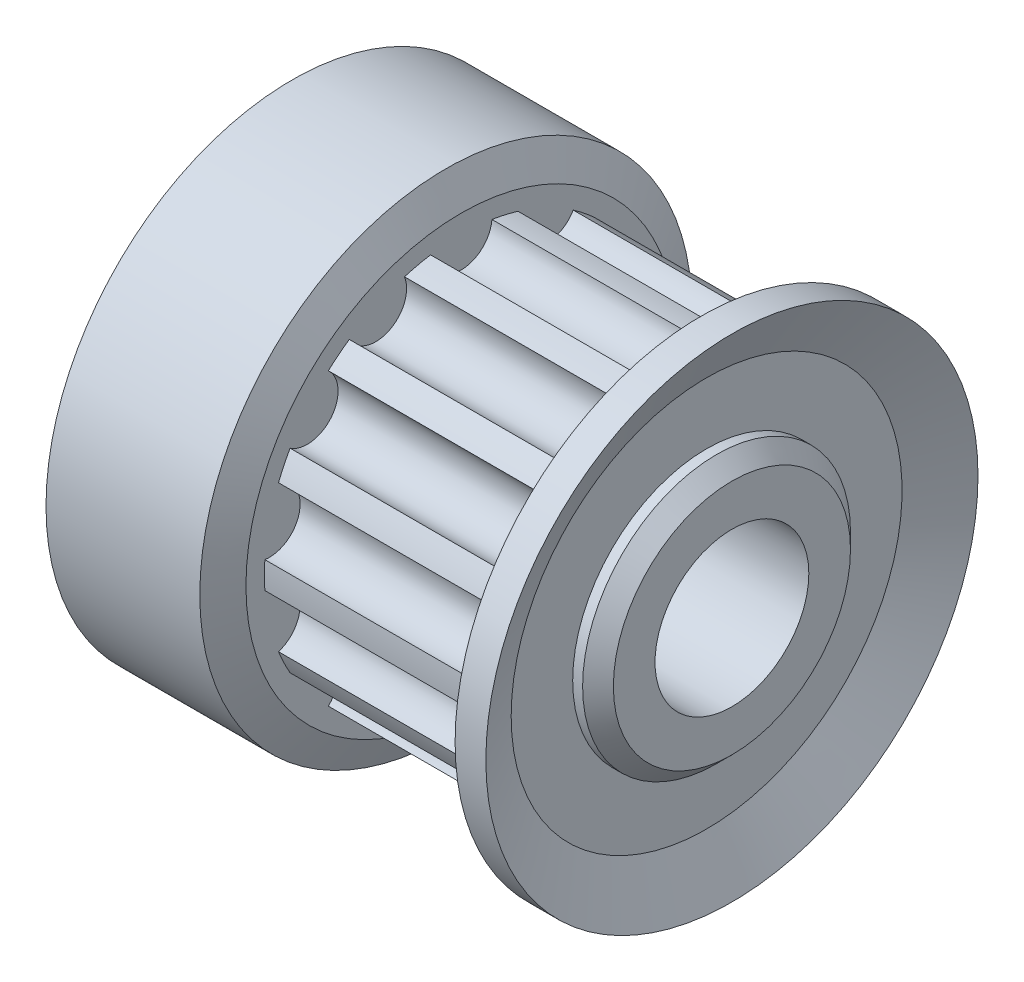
ISO-10303-21;
HEADER;
FILE_DESCRIPTION(('STEP AP214'),'2;1');
FILE_NAME('part.step','',(''),(''),'','','');
FILE_SCHEMA(('AUTOMOTIVE_DESIGN { 1 0 10303 214 1 1 1 1 }'));
ENDSEC;
DATA;
#1=APPLICATION_CONTEXT('core data for automotive mechanical design processes');
#2=APPLICATION_PROTOCOL_DEFINITION('international standard','automotive_design',2000,#1);
#3=PRODUCT_CONTEXT('',#1,'mechanical');
#4=PRODUCT('Part','Part','',(#3));
#5=PRODUCT_RELATED_PRODUCT_CATEGORY('part','',(#4));
#6=PRODUCT_DEFINITION_FORMATION('','',#4);
#7=PRODUCT_DEFINITION_CONTEXT('part definition',#1,'design');
#8=PRODUCT_DEFINITION('design','',#6,#7);
#9=PRODUCT_DEFINITION_SHAPE('','',#8);
#10=(LENGTH_UNIT() NAMED_UNIT(*) SI_UNIT(.MILLI.,.METRE.));
#11=(NAMED_UNIT(*) PLANE_ANGLE_UNIT() SI_UNIT($,.RADIAN.));
#12=(NAMED_UNIT(*) SI_UNIT($,.STERADIAN.) SOLID_ANGLE_UNIT());
#13=UNCERTAINTY_MEASURE_WITH_UNIT(LENGTH_MEASURE(1.E-05),#10,'distance_accuracy_value','');
#14=(GEOMETRIC_REPRESENTATION_CONTEXT(3) GLOBAL_UNCERTAINTY_ASSIGNED_CONTEXT((#13)) GLOBAL_UNIT_ASSIGNED_CONTEXT((#10,
#11,#12)) REPRESENTATION_CONTEXT('',''));
#15=CARTESIAN_POINT('',(0.,0.,0.));
#16=DIRECTION('',(0.,0.,1.));
#17=DIRECTION('',(1.,0.,0.));
#18=AXIS2_PLACEMENT_3D('',#15,#16,#17);
#19=CARTESIAN_POINT('',(0.,0.,0.));
#20=DIRECTION('',(-1.,0.,0.));
#21=DIRECTION('',(0.,0.,1.));
#22=AXIS2_PLACEMENT_3D('',#19,#20,#21);
#23=CYLINDRICAL_SURFACE('',#22,6.4);
#24=DIRECTION('',(-1.,0.,0.));
#25=VECTOR('',#24,1.);
#26=CARTESIAN_POINT('',(9.5,0.434801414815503,-6.38521320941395));
#27=LINE('',#26,#25);
#28=CARTESIAN_POINT('',(13.,0.434801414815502,-6.38521320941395));
#29=VERTEX_POINT('',#28);
#30=CARTESIAN_POINT('',(6.,0.434801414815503,-6.38521320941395));
#31=VERTEX_POINT('',#30);
#32=EDGE_CURVE('E550',#29,#31,#27,.T.);
#33=ORIENTED_EDGE('',*,*,#32,.F.);
#34=CARTESIAN_POINT('',(13.,0.,0.));
#35=DIRECTION('',(-1.,0.,0.));
#36=DIRECTION('',(0.,0.,1.));
#37=AXIS2_PLACEMENT_3D('',#34,#35,#36);
#38=CIRCLE('',#37,6.4);
#39=CARTESIAN_POINT('',(13.,-0.434801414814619,-6.38521320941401));
#40=VERTEX_POINT('',#39);
#41=EDGE_CURVE('E483',#29,#40,#38,.T.);
#42=ORIENTED_EDGE('',*,*,#41,.T.);
#43=DIRECTION('',(-1.,0.,0.));
#44=VECTOR('',#43,1.);
#45=CARTESIAN_POINT('',(9.5,-0.434801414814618,-6.38521320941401));
#46=LINE('',#45,#44);
#47=CARTESIAN_POINT('',(6.,-0.434801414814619,-6.38521320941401));
#48=VERTEX_POINT('',#47);
#49=EDGE_CURVE('E559',#48,#40,#46,.F.);
#50=ORIENTED_EDGE('',*,*,#49,.F.);
#51=CARTESIAN_POINT('',(6.,0.,0.));
#52=DIRECTION('',(-1.,0.,0.));
#53=DIRECTION('',(0.,0.,1.));
#54=AXIS2_PLACEMENT_3D('',#51,#52,#53);
#55=CIRCLE('',#54,6.4);
#56=EDGE_CURVE('E1194',#31,#48,#55,.T.);
#57=ORIENTED_EDGE('',*,*,#56,.F.);
#58=EDGE_LOOP('',(#33,#42,#50,#57));
#59=FACE_BOUND('',#58,.T.);
#60=ADVANCED_FACE('F33',(#59),#23,.T.);
#61=DIRECTION('',(-1.,0.,0.));
#62=VECTOR('',#61,1.);
#63=CARTESIAN_POINT('',(9.5,2.37869764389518,-5.94153158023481));
#64=LINE('',#63,#62);
#65=CARTESIAN_POINT('',(6.,2.37869764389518,-5.94153158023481));
#66=VERTEX_POINT('',#65);
#67=CARTESIAN_POINT('',(13.,2.37869764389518,-5.9415315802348));
#68=VERTEX_POINT('',#67);
#69=EDGE_CURVE('E554',#66,#68,#64,.F.);
#70=ORIENTED_EDGE('',*,*,#69,.F.);
#71=CARTESIAN_POINT('',(6.,3.16218272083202,-5.56422505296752));
#72=VERTEX_POINT('',#71);
#73=EDGE_CURVE('E1196',#72,#66,#55,.T.);
#74=ORIENTED_EDGE('',*,*,#73,.F.);
#75=DIRECTION('',(-1.,0.,0.));
#76=VECTOR('',#75,1.);
#77=CARTESIAN_POINT('',(9.5,3.16218272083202,-5.56422505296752));
#78=LINE('',#77,#76);
#79=CARTESIAN_POINT('',(13.,3.16218272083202,-5.56422505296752));
#80=VERTEX_POINT('',#79);
#81=EDGE_CURVE('E600',#80,#72,#78,.T.);
#82=ORIENTED_EDGE('',*,*,#81,.F.);
#83=EDGE_CURVE('E491',#80,#68,#38,.T.);
#84=ORIENTED_EDGE('',*,*,#83,.T.);
#85=EDGE_LOOP('',(#70,#74,#82,#84));
#86=FACE_BOUND('',#85,.T.);
#87=ADVANCED_FACE('F386',(#86),#23,.T.);
#88=DIRECTION('',(-1.,0.,0.));
#89=VECTOR('',#88,1.);
#90=CARTESIAN_POINT('',(9.5,-2.37869764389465,-5.94153158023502));
#91=LINE('',#90,#89);
#92=CARTESIAN_POINT('',(13.,-2.37869764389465,-5.94153158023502));
#93=VERTEX_POINT('',#92);
#94=CARTESIAN_POINT('',(6.,-2.37869764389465,-5.94153158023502));
#95=VERTEX_POINT('',#94);
#96=EDGE_CURVE('E557',#93,#95,#91,.T.);
#97=ORIENTED_EDGE('',*,*,#96,.F.);
#98=CARTESIAN_POINT('',(13.,-3.162182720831,-5.5642250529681));
#99=VERTEX_POINT('',#98);
#100=EDGE_CURVE('E473',#93,#99,#38,.T.);
#101=ORIENTED_EDGE('',*,*,#100,.T.);
#102=DIRECTION('',(-1.,0.,0.));
#103=VECTOR('',#102,1.);
#104=CARTESIAN_POINT('',(9.5,-3.162182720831,-5.5642250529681));
#105=LINE('',#104,#103);
#106=CARTESIAN_POINT('',(6.,-3.16218272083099,-5.5642250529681));
#107=VERTEX_POINT('',#106);
#108=EDGE_CURVE('E564',#107,#99,#105,.F.);
#109=ORIENTED_EDGE('',*,*,#108,.F.);
#110=EDGE_CURVE('E1191',#95,#107,#55,.T.);
#111=ORIENTED_EDGE('',*,*,#110,.F.);
#112=EDGE_LOOP('',(#97,#101,#109,#111));
#113=FACE_BOUND('',#112,.T.);
#114=ADVANCED_FACE('F391',(#113),#23,.T.);
#115=DIRECTION('',(-1.,0.,0.));
#116=VECTOR('',#115,1.);
#117=CARTESIAN_POINT('',(9.5,-4.72106646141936,-4.32105675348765));
#118=LINE('',#117,#116);
#119=CARTESIAN_POINT('',(13.,-4.72106646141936,-4.32105675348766));
#120=VERTEX_POINT('',#119);
#121=CARTESIAN_POINT('',(6.,-4.72106646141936,-4.32105675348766));
#122=VERTEX_POINT('',#121);
#123=EDGE_CURVE('E562',#120,#122,#118,.T.);
#124=ORIENTED_EDGE('',*,*,#123,.F.);
#125=CARTESIAN_POINT('',(13.,-5.26325495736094,-3.64117388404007));
#126=VERTEX_POINT('',#125);
#127=EDGE_CURVE('E463',#120,#126,#38,.T.);
#128=ORIENTED_EDGE('',*,*,#127,.T.);
#129=DIRECTION('',(-1.,0.,0.));
#130=VECTOR('',#129,1.);
#131=CARTESIAN_POINT('',(9.5,-5.26325495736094,-3.64117388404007));
#132=LINE('',#131,#130);
#133=CARTESIAN_POINT('',(6.,-5.26325495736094,-3.64117388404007));
#134=VERTEX_POINT('',#133);
#135=EDGE_CURVE('E569',#134,#126,#132,.F.);
#136=ORIENTED_EDGE('',*,*,#135,.F.);
#137=EDGE_CURVE('E1198',#122,#134,#55,.T.);
#138=ORIENTED_EDGE('',*,*,#137,.F.);
#139=EDGE_LOOP('',(#124,#128,#136,#138));
#140=FACE_BOUND('',#139,.T.);
#141=ADVANCED_FACE('F983',(#140),#23,.T.);
#142=DIRECTION('',(-1.,0.,0.));
#143=VECTOR('',#142,1.);
#144=CARTESIAN_POINT('',(9.5,-6.12837016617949,-1.8447436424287));
#145=LINE('',#144,#143);
#146=CARTESIAN_POINT('',(13.,-6.12837016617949,-1.8447436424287));
#147=VERTEX_POINT('',#146);
#148=CARTESIAN_POINT('',(6.,-6.12837016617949,-1.8447436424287));
#149=VERTEX_POINT('',#148);
#150=EDGE_CURVE('E567',#147,#149,#145,.T.);
#151=ORIENTED_EDGE('',*,*,#150,.F.);
#152=CARTESIAN_POINT('',(13.,-6.32187499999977,-0.996943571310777));
#153=VERTEX_POINT('',#152);
#154=EDGE_CURVE('E453',#147,#153,#38,.T.);
#155=ORIENTED_EDGE('',*,*,#154,.T.);
#156=DIRECTION('',(-1.,0.,0.));
#157=VECTOR('',#156,1.);
#158=CARTESIAN_POINT('',(9.5,-6.32187499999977,-0.996943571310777));
#159=LINE('',#158,#157);
#160=CARTESIAN_POINT('',(6.,-6.32187499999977,-0.996943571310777));
#161=VERTEX_POINT('',#160);
#162=EDGE_CURVE('E574',#161,#153,#159,.F.);
#163=ORIENTED_EDGE('',*,*,#162,.F.);
#164=EDGE_CURVE('E1200',#149,#161,#55,.T.);
#165=ORIENTED_EDGE('',*,*,#164,.F.);
#166=EDGE_LOOP('',(#151,#155,#163,#165));
#167=FACE_BOUND('',#166,.T.);
#168=ADVANCED_FACE('F975',(#167),#23,.T.);
#169=DIRECTION('',(-1.,0.,0.));
#170=VECTOR('',#169,1.);
#171=CARTESIAN_POINT('',(9.5,-6.321875,0.996943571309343));
#172=LINE('',#171,#170);
#173=CARTESIAN_POINT('',(13.,-6.321875,0.996943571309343));
#174=VERTEX_POINT('',#173);
#175=CARTESIAN_POINT('',(6.,-6.321875,0.996943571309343));
#176=VERTEX_POINT('',#175);
#177=EDGE_CURVE('E572',#174,#176,#172,.T.);
#178=ORIENTED_EDGE('',*,*,#177,.F.);
#179=CARTESIAN_POINT('',(13.,-6.12837016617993,1.84474364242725));
#180=VERTEX_POINT('',#179);
#181=EDGE_CURVE('E443',#174,#180,#38,.T.);
#182=ORIENTED_EDGE('',*,*,#181,.T.);
#183=DIRECTION('',(-1.,0.,0.));
#184=VECTOR('',#183,1.);
#185=CARTESIAN_POINT('',(9.5,-6.12837016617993,1.84474364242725));
#186=LINE('',#185,#184);
#187=CARTESIAN_POINT('',(6.,-6.12837016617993,1.84474364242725));
#188=VERTEX_POINT('',#187);
#189=EDGE_CURVE('E579',#188,#180,#186,.F.);
#190=ORIENTED_EDGE('',*,*,#189,.F.);
#191=EDGE_CURVE('E1203',#176,#188,#55,.T.);
#192=ORIENTED_EDGE('',*,*,#191,.F.);
#193=EDGE_LOOP('',(#178,#182,#190,#192));
#194=FACE_BOUND('',#193,.T.);
#195=ADVANCED_FACE('F968',(#194),#23,.T.);
#196=DIRECTION('',(-1.,0.,0.));
#197=VECTOR('',#196,1.);
#198=CARTESIAN_POINT('',(9.5,-5.26325495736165,3.64117388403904));
#199=LINE('',#198,#197);
#200=CARTESIAN_POINT('',(13.,-5.26325495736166,3.64117388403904));
#201=VERTEX_POINT('',#200);
#202=CARTESIAN_POINT('',(6.,-5.26325495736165,3.64117388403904));
#203=VERTEX_POINT('',#202);
#204=EDGE_CURVE('E577',#201,#203,#199,.T.);
#205=ORIENTED_EDGE('',*,*,#204,.F.);
#206=CARTESIAN_POINT('',(13.,-4.72106646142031,4.32105675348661));
#207=VERTEX_POINT('',#206);
#208=EDGE_CURVE('E433',#201,#207,#38,.T.);
#209=ORIENTED_EDGE('',*,*,#208,.T.);
#210=DIRECTION('',(-1.,0.,0.));
#211=VECTOR('',#210,1.);
#212=CARTESIAN_POINT('',(9.5,-4.72106646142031,4.32105675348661));
#213=LINE('',#212,#211);
#214=CARTESIAN_POINT('',(6.,-4.72106646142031,4.32105675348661));
#215=VERTEX_POINT('',#214);
#216=EDGE_CURVE('E584',#215,#207,#213,.F.);
#217=ORIENTED_EDGE('',*,*,#216,.F.);
#218=EDGE_CURVE('E249',#203,#215,#55,.T.);
#219=ORIENTED_EDGE('',*,*,#218,.F.);
#220=EDGE_LOOP('',(#205,#209,#217,#219));
#221=FACE_BOUND('',#220,.T.);
#222=ADVANCED_FACE('F960',(#221),#23,.T.);
#223=DIRECTION('',(-1.,0.,0.));
#224=VECTOR('',#223,1.);
#225=CARTESIAN_POINT('',(9.5,-3.16218272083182,5.56422505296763));
#226=LINE('',#225,#224);
#227=CARTESIAN_POINT('',(13.,-3.16218272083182,5.56422505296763));
#228=VERTEX_POINT('',#227);
#229=CARTESIAN_POINT('',(6.,-3.16218272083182,5.56422505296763));
#230=VERTEX_POINT('',#229);
#231=EDGE_CURVE('E582',#228,#230,#226,.T.);
#232=ORIENTED_EDGE('',*,*,#231,.F.);
#233=CARTESIAN_POINT('',(13.,-2.37869764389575,5.94153158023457));
#234=VERTEX_POINT('',#233);
#235=EDGE_CURVE('E426',#228,#234,#38,.T.);
#236=ORIENTED_EDGE('',*,*,#235,.T.);
#237=DIRECTION('',(-1.,0.,0.));
#238=VECTOR('',#237,1.);
#239=CARTESIAN_POINT('',(9.5,-2.37869764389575,5.94153158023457));
#240=LINE('',#239,#238);
#241=CARTESIAN_POINT('',(6.,-2.37869764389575,5.94153158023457));
#242=VERTEX_POINT('',#241);
#243=EDGE_CURVE('E232',#242,#234,#240,.F.);
#244=ORIENTED_EDGE('',*,*,#243,.F.);
#245=EDGE_CURVE('E243',#230,#242,#55,.T.);
#246=ORIENTED_EDGE('',*,*,#245,.F.);
#247=EDGE_LOOP('',(#232,#236,#244,#246));
#248=FACE_BOUND('',#247,.T.);
#249=ADVANCED_FACE('F665',(#248),#23,.T.);
#250=DIRECTION('',(-1.,0.,0.));
#251=VECTOR('',#250,1.);
#252=CARTESIAN_POINT('',(9.5,6.12837016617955,1.84474364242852));
#253=LINE('',#252,#251);
#254=CARTESIAN_POINT('',(13.,6.12837016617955,1.84474364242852));
#255=VERTEX_POINT('',#254);
#256=CARTESIAN_POINT('',(6.,6.12837016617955,1.84474364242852));
#257=VERTEX_POINT('',#256);
#258=EDGE_CURVE('E587',#255,#257,#253,.T.);
#259=ORIENTED_EDGE('',*,*,#258,.F.);
#260=CARTESIAN_POINT('',(13.,6.321875,0.996943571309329));
#261=VERTEX_POINT('',#260);
#262=EDGE_CURVE('E519',#255,#261,#38,.T.);
#263=ORIENTED_EDGE('',*,*,#262,.T.);
#264=DIRECTION('',(-1.,0.,0.));
#265=VECTOR('',#264,1.);
#266=CARTESIAN_POINT('',(9.5,6.321875,0.996943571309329));
#267=LINE('',#266,#265);
#268=CARTESIAN_POINT('',(6.,6.321875,0.996943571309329));
#269=VERTEX_POINT('',#268);
#270=EDGE_CURVE('E597',#269,#261,#267,.F.);
#271=ORIENTED_EDGE('',*,*,#270,.F.);
#272=EDGE_CURVE('E255',#257,#269,#55,.T.);
#273=ORIENTED_EDGE('',*,*,#272,.F.);
#274=EDGE_LOOP('',(#259,#263,#271,#273));
#275=FACE_BOUND('',#274,.T.);
#276=ADVANCED_FACE('F947',(#275),#23,.T.);
#277=DIRECTION('',(-1.,0.,0.));
#278=VECTOR('',#277,1.);
#279=CARTESIAN_POINT('',(9.5,5.26325495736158,3.64117388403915));
#280=LINE('',#279,#278);
#281=CARTESIAN_POINT('',(6.,5.26325495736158,3.64117388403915));
#282=VERTEX_POINT('',#281);
#283=CARTESIAN_POINT('',(13.,5.26325495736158,3.64117388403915));
#284=VERTEX_POINT('',#283);
#285=EDGE_CURVE('E539',#282,#284,#280,.F.);
#286=ORIENTED_EDGE('',*,*,#285,.F.);
#287=CARTESIAN_POINT('',(6.,4.72106646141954,4.32105675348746));
#288=VERTEX_POINT('',#287);
#289=EDGE_CURVE('E251',#288,#282,#55,.T.);
#290=ORIENTED_EDGE('',*,*,#289,.F.);
#291=DIRECTION('',(-1.,0.,0.));
#292=VECTOR('',#291,1.);
#293=CARTESIAN_POINT('',(9.5,4.72106646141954,4.32105675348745));
#294=LINE('',#293,#292);
#295=CARTESIAN_POINT('',(13.,4.72106646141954,4.32105675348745));
#296=VERTEX_POINT('',#295);
#297=EDGE_CURVE('E353',#296,#288,#294,.T.);
#298=ORIENTED_EDGE('',*,*,#297,.F.);
#299=EDGE_CURVE('E260',#296,#284,#38,.T.);
#300=ORIENTED_EDGE('',*,*,#299,.T.);
#301=EDGE_LOOP('',(#286,#290,#298,#300));
#302=FACE_BOUND('',#301,.T.);
#303=ADVANCED_FACE('F536',(#302),#23,.T.);
#304=DIRECTION('',(-1.,0.,0.));
#305=VECTOR('',#304,1.);
#306=CARTESIAN_POINT('',(9.5,5.2632549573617,-3.64117388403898));
#307=LINE('',#306,#305);
#308=CARTESIAN_POINT('',(13.,5.2632549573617,-3.64117388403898));
#309=VERTEX_POINT('',#308);
#310=CARTESIAN_POINT('',(6.,5.2632549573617,-3.64117388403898));
#311=VERTEX_POINT('',#310);
#312=EDGE_CURVE('E590',#309,#311,#307,.T.);
#313=ORIENTED_EDGE('',*,*,#312,.F.);
#314=CARTESIAN_POINT('',(13.,4.72106646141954,-4.32105675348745));
#315=VERTEX_POINT('',#314);
#316=EDGE_CURVE('E500',#309,#315,#38,.T.);
#317=ORIENTED_EDGE('',*,*,#316,.T.);
#318=DIRECTION('',(-1.,0.,0.));
#319=VECTOR('',#318,1.);
#320=CARTESIAN_POINT('',(9.5,4.72106646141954,-4.32105675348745));
#321=LINE('',#320,#319);
#322=CARTESIAN_POINT('',(6.,4.72106646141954,-4.32105675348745));
#323=VERTEX_POINT('',#322);
#324=EDGE_CURVE('E417',#323,#315,#321,.F.);
#325=ORIENTED_EDGE('',*,*,#324,.F.);
#326=EDGE_CURVE('E1197',#311,#323,#55,.T.);
#327=ORIENTED_EDGE('',*,*,#326,.F.);
#328=EDGE_LOOP('',(#313,#317,#325,#327));
#329=FACE_BOUND('',#328,.T.);
#330=ADVANCED_FACE('F408',(#329),#23,.T.);
#331=DIRECTION('',(-1.,0.,0.));
#332=VECTOR('',#331,1.);
#333=CARTESIAN_POINT('',(9.5,6.1283701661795,-1.84474364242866));
#334=LINE('',#333,#332);
#335=CARTESIAN_POINT('',(6.,6.1283701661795,-1.84474364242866));
#336=VERTEX_POINT('',#335);
#337=CARTESIAN_POINT('',(13.,6.1283701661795,-1.84474364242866));
#338=VERTEX_POINT('',#337);
#339=EDGE_CURVE('E592',#336,#338,#334,.F.);
#340=ORIENTED_EDGE('',*,*,#339,.F.);
#341=CARTESIAN_POINT('',(6.,6.321875,-0.996943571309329));
#342=VERTEX_POINT('',#341);
#343=EDGE_CURVE('E1209',#342,#336,#55,.T.);
#344=ORIENTED_EDGE('',*,*,#343,.F.);
#345=DIRECTION('',(-1.,0.,0.));
#346=VECTOR('',#345,1.);
#347=CARTESIAN_POINT('',(9.5,6.321875,-0.996943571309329));
#348=LINE('',#347,#346);
#349=CARTESIAN_POINT('',(13.,6.321875,-0.996943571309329));
#350=VERTEX_POINT('',#349);
#351=EDGE_CURVE('E595',#350,#342,#348,.T.);
#352=ORIENTED_EDGE('',*,*,#351,.F.);
#353=EDGE_CURVE('E510',#350,#338,#38,.T.);
#354=ORIENTED_EDGE('',*,*,#353,.T.);
#355=EDGE_LOOP('',(#340,#344,#352,#354));
#356=FACE_BOUND('',#355,.T.);
#357=ADVANCED_FACE('F403',(#356),#23,.T.);
#358=DIRECTION('',(-1.,0.,0.));
#359=VECTOR('',#358,1.);
#360=CARTESIAN_POINT('',(9.5,2.37869764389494,5.9415315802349));
#361=LINE('',#360,#359);
#362=CARTESIAN_POINT('',(13.,2.37869764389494,5.9415315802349));
#363=VERTEX_POINT('',#362);
#364=CARTESIAN_POINT('',(6.,2.37869764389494,5.9415315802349));
#365=VERTEX_POINT('',#364);
#366=EDGE_CURVE('E412',#363,#365,#361,.T.);
#367=ORIENTED_EDGE('',*,*,#366,.F.);
#368=CARTESIAN_POINT('',(13.,3.16218272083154,5.56422505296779));
#369=VERTEX_POINT('',#368);
#370=EDGE_CURVE('E254',#363,#369,#38,.T.);
#371=ORIENTED_EDGE('',*,*,#370,.T.);
#372=DIRECTION('',(-1.,0.,0.));
#373=VECTOR('',#372,1.);
#374=CARTESIAN_POINT('',(9.5,3.16218272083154,5.56422505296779));
#375=LINE('',#374,#373);
#376=CARTESIAN_POINT('',(6.,3.16218272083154,5.56422505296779));
#377=VERTEX_POINT('',#376);
#378=EDGE_CURVE('E358',#377,#369,#375,.F.);
#379=ORIENTED_EDGE('',*,*,#378,.F.);
#380=EDGE_CURVE('E247',#365,#377,#55,.T.);
#381=ORIENTED_EDGE('',*,*,#380,.F.);
#382=EDGE_LOOP('',(#367,#371,#379,#381));
#383=FACE_BOUND('',#382,.T.);
#384=ADVANCED_FACE('F396',(#383),#23,.T.);
#385=DIRECTION('',(-1.,0.,0.));
#386=VECTOR('',#385,1.);
#387=CARTESIAN_POINT('',(9.5,0.434801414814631,6.38521320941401));
#388=LINE('',#387,#386);
#389=CARTESIAN_POINT('',(6.,0.434801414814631,6.38521320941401));
#390=VERTEX_POINT('',#389);
#391=CARTESIAN_POINT('',(13.,0.434801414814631,6.38521320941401));
#392=VERTEX_POINT('',#391);
#393=EDGE_CURVE('E231',#390,#392,#388,.F.);
#394=ORIENTED_EDGE('',*,*,#393,.F.);
#395=CARTESIAN_POINT('',(6.,-0.434801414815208,6.38521320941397));
#396=VERTEX_POINT('',#395);
#397=EDGE_CURVE('E240',#396,#390,#55,.T.);
#398=ORIENTED_EDGE('',*,*,#397,.F.);
#399=DIRECTION('',(-1.,0.,0.));
#400=VECTOR('',#399,1.);
#401=CARTESIAN_POINT('',(9.5,-0.434801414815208,6.38521320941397));
#402=LINE('',#401,#400);
#403=CARTESIAN_POINT('',(13.,-0.434801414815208,6.38521320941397));
#404=VERTEX_POINT('',#403);
#405=EDGE_CURVE('E222',#404,#396,#402,.T.);
#406=ORIENTED_EDGE('',*,*,#405,.F.);
#407=EDGE_CURVE('E424',#404,#392,#38,.T.);
#408=ORIENTED_EDGE('',*,*,#407,.T.);
#409=EDGE_LOOP('',(#394,#398,#406,#408));
#410=FACE_BOUND('',#409,.T.);
#411=ADVANCED_FACE('F246',(#410),#23,.T.);
#412=CARTESIAN_POINT('',(0.5,0.,0.));
#413=DIRECTION('',(1.,0.,0.));
#414=DIRECTION('',(0.,0.,-1.));
#415=AXIS2_PLACEMENT_3D('',#412,#413,#414);
#416=CONICAL_SURFACE('',#415,8.,1.10714871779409);
#417=CARTESIAN_POINT('',(0.,0.,0.));
#418=DIRECTION('',(-1.,0.,0.));
#419=DIRECTION('',(0.,0.,1.));
#420=AXIS2_PLACEMENT_3D('',#417,#418,#419);
#421=CIRCLE('',#420,7.);
#422=CARTESIAN_POINT('',(0.,0.,7.));
#423=VERTEX_POINT('',#422);
#424=EDGE_CURVE('E290',#423,#423,#421,.T.);
#425=ORIENTED_EDGE('',*,*,#424,.F.);
#426=EDGE_LOOP('',(#425));
#427=FACE_BOUND('',#426,.T.);
#428=CARTESIAN_POINT('',(0.5,0.,0.));
#429=DIRECTION('',(-1.,0.,0.));
#430=DIRECTION('',(0.,0.,1.));
#431=AXIS2_PLACEMENT_3D('',#428,#429,#430);
#432=CIRCLE('',#431,8.);
#433=CARTESIAN_POINT('',(0.5,0.,8.));
#434=VERTEX_POINT('',#433);
#435=EDGE_CURVE('E355',#434,#434,#432,.T.);
#436=ORIENTED_EDGE('',*,*,#435,.T.);
#437=EDGE_LOOP('',(#436));
#438=FACE_BOUND('',#437,.T.);
#439=ADVANCED_FACE('F395',(#427,#438),#416,.T.);
#440=CARTESIAN_POINT('',(0.,7.,0.));
#441=DIRECTION('',(1.,0.,0.));
#442=DIRECTION('',(0.,0.,-1.));
#443=AXIS2_PLACEMENT_3D('',#440,#441,#442);
#444=PLANE('',#443);
#445=CARTESIAN_POINT('',(0.,0.,0.));
#446=DIRECTION('',(-1.,0.,0.));
#447=DIRECTION('',(0.,0.,1.));
#448=AXIS2_PLACEMENT_3D('',#445,#446,#447);
#449=CIRCLE('',#448,3.9);
#450=CARTESIAN_POINT('',(0.,0.,3.9));
#451=VERTEX_POINT('',#450);
#452=EDGE_CURVE('E287',#451,#451,#449,.T.);
#453=ORIENTED_EDGE('',*,*,#452,.F.);
#454=EDGE_LOOP('',(#453));
#455=FACE_BOUND('',#454,.T.);
#456=ORIENTED_EDGE('',*,*,#424,.T.);
#457=EDGE_LOOP('',(#456));
#458=FACE_BOUND('',#457,.T.);
#459=ADVANCED_FACE('F401',(#455,#458),#444,.F.);
#460=CARTESIAN_POINT('',(0.1,0.,0.));
#461=DIRECTION('',(-1.,0.,0.));
#462=DIRECTION('',(0.,0.,1.));
#463=AXIS2_PLACEMENT_3D('',#460,#461,#462);
#464=TOROIDAL_SURFACE('',#463,3.9,0.0999999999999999);
#465=CARTESIAN_POINT('',(0.100000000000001,0.,0.));
#466=DIRECTION('',(-1.,0.,0.));
#467=DIRECTION('',(0.,0.,1.));
#468=AXIS2_PLACEMENT_3D('',#465,#466,#467);
#469=CIRCLE('',#468,3.8);
#470=CARTESIAN_POINT('',(0.100000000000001,0.,3.8));
#471=VERTEX_POINT('',#470);
#472=EDGE_CURVE('E284',#471,#471,#469,.T.);
#473=ORIENTED_EDGE('',*,*,#472,.F.);
#474=EDGE_LOOP('',(#473));
#475=FACE_BOUND('',#474,.T.);
#476=ORIENTED_EDGE('',*,*,#452,.T.);
#477=EDGE_LOOP('',(#476));
#478=FACE_BOUND('',#477,.T.);
#479=ADVANCED_FACE('F1119',(#475,#478),#464,.T.);
#480=CARTESIAN_POINT('',(0.,0.,0.));
#481=DIRECTION('',(-1.,0.,0.));
#482=DIRECTION('',(0.,0.,1.));
#483=AXIS2_PLACEMENT_3D('',#480,#481,#482);
#484=CYLINDRICAL_SURFACE('',#483,3.8);
#485=CARTESIAN_POINT('',(0.3,0.,0.));
#486=DIRECTION('',(-1.,0.,0.));
#487=DIRECTION('',(0.,0.,1.));
#488=AXIS2_PLACEMENT_3D('',#485,#486,#487);
#489=CIRCLE('',#488,3.8);
#490=CARTESIAN_POINT('',(0.3,0.,3.8));
#491=VERTEX_POINT('',#490);
#492=EDGE_CURVE('E281',#491,#491,#489,.T.);
#493=ORIENTED_EDGE('',*,*,#492,.F.);
#494=EDGE_LOOP('',(#493));
#495=FACE_BOUND('',#494,.T.);
#496=ORIENTED_EDGE('',*,*,#472,.T.);
#497=EDGE_LOOP('',(#496));
#498=FACE_BOUND('',#497,.T.);
#499=ADVANCED_FACE('F1112',(#495,#498),#484,.F.);
#500=CARTESIAN_POINT('',(0.3,0.,0.));
#501=DIRECTION('',(1.,0.,0.));
#502=DIRECTION('',(0.,0.,-1.));
#503=AXIS2_PLACEMENT_3D('',#500,#501,#502);
#504=CONICAL_SURFACE('',#503,3.8,0.785398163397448);
#505=CARTESIAN_POINT('',(0.,0.,0.));
#506=DIRECTION('',(-1.,0.,0.));
#507=DIRECTION('',(0.,0.,1.));
#508=AXIS2_PLACEMENT_3D('',#505,#506,#507);
#509=CIRCLE('',#508,3.5);
#510=CARTESIAN_POINT('',(0.,0.,3.5));
#511=VERTEX_POINT('',#510);
#512=EDGE_CURVE('E278',#511,#511,#509,.T.);
#513=ORIENTED_EDGE('',*,*,#512,.F.);
#514=EDGE_LOOP('',(#513));
#515=FACE_BOUND('',#514,.T.);
#516=ORIENTED_EDGE('',*,*,#492,.T.);
#517=EDGE_LOOP('',(#516));
#518=FACE_BOUND('',#517,.T.);
#519=ADVANCED_FACE('F1103',(#515,#518),#504,.T.);
#520=CARTESIAN_POINT('',(0.,3.5,0.));
#521=DIRECTION('',(1.,0.,0.));
#522=DIRECTION('',(0.,0.,-1.));
#523=AXIS2_PLACEMENT_3D('',#520,#521,#522);
#524=PLANE('',#523);
#525=CARTESIAN_POINT('',(0.,0.,0.));
#526=DIRECTION('',(1.,0.,0.));
#527=DIRECTION('',(0.,0.,-1.));
#528=AXIS2_PLACEMENT_3D('',#525,#526,#527);
#529=CIRCLE('',#528,2.5);
#530=CARTESIAN_POINT('',(0.,0.,-2.5));
#531=VERTEX_POINT('',#530);
#532=EDGE_CURVE('E348',#531,#531,#529,.T.);
#533=ORIENTED_EDGE('',*,*,#532,.T.);
#534=EDGE_LOOP('',(#533));
#535=FACE_BOUND('',#534,.T.);
#536=ORIENTED_EDGE('',*,*,#512,.T.);
#537=EDGE_LOOP('',(#536));
#538=FACE_BOUND('',#537,.T.);
#539=ADVANCED_FACE('F1095',(#535,#538),#524,.F.);
#540=CARTESIAN_POINT('',(14.8,0.,0.));
#541=DIRECTION('',(-1.,0.,0.));
#542=DIRECTION('',(0.,0.,1.));
#543=AXIS2_PLACEMENT_3D('',#540,#541,#542);
#544=PLANE('',#543);
#545=CARTESIAN_POINT('',(14.8,0.,0.));
#546=DIRECTION('',(1.,0.,0.));
#547=DIRECTION('',(0.,0.,-1.));
#548=AXIS2_PLACEMENT_3D('',#545,#546,#547);
#549=CIRCLE('',#548,2.5);
#550=CARTESIAN_POINT('',(14.8,0.,-2.5));
#551=VERTEX_POINT('',#550);
#552=EDGE_CURVE('E351',#551,#551,#549,.T.);
#553=ORIENTED_EDGE('',*,*,#552,.F.);
#554=EDGE_LOOP('',(#553));
#555=FACE_BOUND('',#554,.T.);
#556=CARTESIAN_POINT('',(14.8,0.,0.));
#557=DIRECTION('',(-1.,0.,0.));
#558=DIRECTION('',(0.,0.,1.));
#559=AXIS2_PLACEMENT_3D('',#556,#557,#558);
#560=CIRCLE('',#559,3.85425396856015);
#561=CARTESIAN_POINT('',(14.8,0.,3.85425396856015));
#562=VERTEX_POINT('',#561);
#563=EDGE_CURVE('E275',#562,#562,#560,.T.);
#564=ORIENTED_EDGE('',*,*,#563,.F.);
#565=EDGE_LOOP('',(#564));
#566=FACE_BOUND('',#565,.T.);
#567=ADVANCED_FACE('F1086',(#555,#566),#544,.F.);
#568=CARTESIAN_POINT('',(14.8,0.,0.));
#569=DIRECTION('',(-1.,0.,0.));
#570=DIRECTION('',(0.,0.,1.));
#571=AXIS2_PLACEMENT_3D('',#568,#569,#570);
#572=CONICAL_SURFACE('',#571,3.85425396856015,0.785398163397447);
#573=CARTESIAN_POINT('',(14.3,0.,0.));
#574=DIRECTION('',(-1.,0.,0.));
#575=DIRECTION('',(0.,0.,1.));
#576=AXIS2_PLACEMENT_3D('',#573,#574,#575);
#577=CIRCLE('',#576,4.35425396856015);
#578=CARTESIAN_POINT('',(14.3,0.,4.35425396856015));
#579=VERTEX_POINT('',#578);
#580=EDGE_CURVE('E272',#579,#579,#577,.T.);
#581=ORIENTED_EDGE('',*,*,#580,.F.);
#582=EDGE_LOOP('',(#581));
#583=FACE_BOUND('',#582,.T.);
#584=ORIENTED_EDGE('',*,*,#563,.T.);
#585=EDGE_LOOP('',(#584));
#586=FACE_BOUND('',#585,.T.);
#587=ADVANCED_FACE('F1078',(#583,#586),#572,.T.);
#588=CARTESIAN_POINT('',(0.,0.,0.));
#589=DIRECTION('',(-1.,0.,0.));
#590=DIRECTION('',(0.,0.,1.));
#591=AXIS2_PLACEMENT_3D('',#588,#589,#590);
#592=CYLINDRICAL_SURFACE('',#591,4.35425396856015);
#593=CARTESIAN_POINT('',(13.9771269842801,0.,0.));
#594=DIRECTION('',(-1.,0.,0.));
#595=DIRECTION('',(0.,0.,1.));
#596=AXIS2_PLACEMENT_3D('',#593,#594,#595);
#597=CIRCLE('',#596,4.35425396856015);
#598=CARTESIAN_POINT('',(13.9771269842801,0.,4.35425396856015));
#599=VERTEX_POINT('',#598);
#600=EDGE_CURVE('E269',#599,#599,#597,.T.);
#601=ORIENTED_EDGE('',*,*,#600,.F.);
#602=EDGE_LOOP('',(#601));
#603=FACE_BOUND('',#602,.T.);
#604=ORIENTED_EDGE('',*,*,#580,.T.);
#605=EDGE_LOOP('',(#604));
#606=FACE_BOUND('',#605,.T.);
#607=ADVANCED_FACE('F1070',(#603,#606),#592,.T.);
#608=CARTESIAN_POINT('',(13.9771269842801,4.35425396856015,0.));
#609=DIRECTION('',(-1.,0.,0.));
#610=DIRECTION('',(0.,0.,1.));
#611=AXIS2_PLACEMENT_3D('',#608,#609,#610);
#612=PLANE('',#611);
#613=CARTESIAN_POINT('',(13.9771269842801,0.,0.));
#614=DIRECTION('',(-1.,0.,0.));
#615=DIRECTION('',(0.,0.,1.));
#616=AXIS2_PLACEMENT_3D('',#613,#614,#615);
#617=CIRCLE('',#616,6.35425396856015);
#618=CARTESIAN_POINT('',(13.9771269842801,0.,6.35425396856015));
#619=VERTEX_POINT('',#618);
#620=EDGE_CURVE('E266',#619,#619,#617,.T.);
#621=ORIENTED_EDGE('',*,*,#620,.F.);
#622=EDGE_LOOP('',(#621));
#623=FACE_BOUND('',#622,.T.);
#624=ORIENTED_EDGE('',*,*,#600,.T.);
#625=EDGE_LOOP('',(#624));
#626=FACE_BOUND('',#625,.T.);
#627=ADVANCED_FACE('F1062',(#623,#626),#612,.F.);
#628=CARTESIAN_POINT('',(13.9771269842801,0.,0.));
#629=DIRECTION('',(1.,0.,0.));
#630=DIRECTION('',(0.,0.,-1.));
#631=AXIS2_PLACEMENT_3D('',#628,#629,#630);
#632=CONICAL_SURFACE('',#631,6.35425396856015,1.10714871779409);
#633=CARTESIAN_POINT('',(14.8,0.,0.));
#634=DIRECTION('',(-1.,0.,0.));
#635=DIRECTION('',(0.,0.,1.));
#636=AXIS2_PLACEMENT_3D('',#633,#634,#635);
#637=CIRCLE('',#636,8.);
#638=CARTESIAN_POINT('',(14.8,0.,8.));
#639=VERTEX_POINT('',#638);
#640=EDGE_CURVE('E263',#639,#639,#637,.T.);
#641=ORIENTED_EDGE('',*,*,#640,.F.);
#642=EDGE_LOOP('',(#641));
#643=FACE_BOUND('',#642,.T.);
#644=ORIENTED_EDGE('',*,*,#620,.T.);
#645=EDGE_LOOP('',(#644));
#646=FACE_BOUND('',#645,.T.);
#647=ADVANCED_FACE('F1054',(#643,#646),#632,.F.);
#648=CARTESIAN_POINT('',(0.,0.,0.));
#649=DIRECTION('',(-1.,0.,0.));
#650=DIRECTION('',(0.,0.,1.));
#651=AXIS2_PLACEMENT_3D('',#648,#649,#650);
#652=CYLINDRICAL_SURFACE('',#651,8.);
#653=CARTESIAN_POINT('',(13.8,0.,0.));
#654=DIRECTION('',(-1.,0.,0.));
#655=DIRECTION('',(0.,0.,1.));
#656=AXIS2_PLACEMENT_3D('',#653,#654,#655);
#657=CIRCLE('',#656,8.);
#658=CARTESIAN_POINT('',(13.8,0.,8.));
#659=VERTEX_POINT('',#658);
#660=EDGE_CURVE('E259',#659,#659,#657,.T.);
#661=ORIENTED_EDGE('',*,*,#660,.F.);
#662=EDGE_LOOP('',(#661));
#663=FACE_BOUND('',#662,.T.);
#664=ORIENTED_EDGE('',*,*,#640,.T.);
#665=EDGE_LOOP('',(#664));
#666=FACE_BOUND('',#665,.T.);
#667=ADVANCED_FACE('F381',(#663,#666),#652,.T.);
#668=CARTESIAN_POINT('',(13.8,0.,0.));
#669=DIRECTION('',(1.,0.,0.));
#670=DIRECTION('',(0.,0.,-1.));
#671=AXIS2_PLACEMENT_3D('',#668,#669,#670);
#672=CONICAL_SURFACE('',#671,8.,1.10714871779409);
#673=EDGE_CURVE('E257',#369,#296,#38,.T.);
#674=ORIENTED_EDGE('',*,*,#673,.F.);
#675=ORIENTED_EDGE('',*,*,#370,.F.);
#676=EDGE_CURVE('E422',#392,#363,#38,.T.);
#677=ORIENTED_EDGE('',*,*,#676,.F.);
#678=ORIENTED_EDGE('',*,*,#407,.F.);
#679=EDGE_CURVE('E425',#234,#404,#38,.T.);
#680=ORIENTED_EDGE('',*,*,#679,.F.);
#681=ORIENTED_EDGE('',*,*,#235,.F.);
#682=EDGE_CURVE('E429',#207,#228,#38,.T.);
#683=ORIENTED_EDGE('',*,*,#682,.F.);
#684=ORIENTED_EDGE('',*,*,#208,.F.);
#685=EDGE_CURVE('E438',#180,#201,#38,.T.);
#686=ORIENTED_EDGE('',*,*,#685,.F.);
#687=ORIENTED_EDGE('',*,*,#181,.F.);
#688=EDGE_CURVE('E448',#153,#174,#38,.T.);
#689=ORIENTED_EDGE('',*,*,#688,.F.);
#690=ORIENTED_EDGE('',*,*,#154,.F.);
#691=EDGE_CURVE('E458',#126,#147,#38,.T.);
#692=ORIENTED_EDGE('',*,*,#691,.F.);
#693=ORIENTED_EDGE('',*,*,#127,.F.);
#694=EDGE_CURVE('E468',#99,#120,#38,.T.);
#695=ORIENTED_EDGE('',*,*,#694,.F.);
#696=ORIENTED_EDGE('',*,*,#100,.F.);
#697=EDGE_CURVE('E478',#40,#93,#38,.T.);
#698=ORIENTED_EDGE('',*,*,#697,.F.);
#699=ORIENTED_EDGE('',*,*,#41,.F.);
#700=EDGE_CURVE('E488',#68,#29,#38,.T.);
#701=ORIENTED_EDGE('',*,*,#700,.F.);
#702=ORIENTED_EDGE('',*,*,#83,.F.);
#703=EDGE_CURVE('E496',#315,#80,#38,.T.);
#704=ORIENTED_EDGE('',*,*,#703,.F.);
#705=ORIENTED_EDGE('',*,*,#316,.F.);
#706=EDGE_CURVE('E505',#338,#309,#38,.T.);
#707=ORIENTED_EDGE('',*,*,#706,.F.);
#708=ORIENTED_EDGE('',*,*,#353,.F.);
#709=EDGE_CURVE('E515',#261,#350,#38,.T.);
#710=ORIENTED_EDGE('',*,*,#709,.F.);
#711=ORIENTED_EDGE('',*,*,#262,.F.);
#712=EDGE_CURVE('E524',#284,#255,#38,.T.);
#713=ORIENTED_EDGE('',*,*,#712,.F.);
#714=ORIENTED_EDGE('',*,*,#299,.F.);
#715=EDGE_LOOP('',(#674,#675,#677,#678,#680,#681,#683,#684,#686,#687,#689,#690,#692,#693,#695,
#696,#698,#699,#701,#702,#704,#705,#707,#708,#710,#711,#713,#714));
#716=FACE_BOUND('',#715,.T.);
#717=ORIENTED_EDGE('',*,*,#660,.T.);
#718=EDGE_LOOP('',(#717));
#719=FACE_BOUND('',#718,.T.);
#720=ADVANCED_FACE('F372',(#716,#719),#672,.T.);
#721=CARTESIAN_POINT('',(6.,7.,0.));
#722=DIRECTION('',(-1.,0.,0.));
#723=DIRECTION('',(0.,0.,1.));
#724=AXIS2_PLACEMENT_3D('',#721,#722,#723);
#725=PLANE('',#724);
#726=CARTESIAN_POINT('',(6.,0.,0.));
#727=DIRECTION('',(-1.,0.,0.));
#728=DIRECTION('',(0.,0.,1.));
#729=AXIS2_PLACEMENT_3D('',#726,#727,#728);
#730=CIRCLE('',#729,7.);
#731=CARTESIAN_POINT('',(6.,0.,7.));
#732=VERTEX_POINT('',#731);
#733=EDGE_CURVE('E250',#732,#732,#730,.T.);
#734=ORIENTED_EDGE('',*,*,#733,.F.);
#735=EDGE_LOOP('',(#734));
#736=FACE_BOUND('',#735,.T.);
#737=ORIENTED_EDGE('',*,*,#289,.T.);
#738=CARTESIAN_POINT('',(6.,5.76620075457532,2.77685593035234));
#739=DIRECTION('',(1.,0.,0.));
#740=DIRECTION('',(0.,0.,-1.));
#741=AXIS2_PLACEMENT_3D('',#738,#739,#740);
#742=CIRCLE('',#741,1.00000000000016);
#743=EDGE_CURVE('E606',#282,#257,#742,.T.);
#744=ORIENTED_EDGE('',*,*,#743,.T.);
#745=ORIENTED_EDGE('',*,*,#272,.T.);
#746=CARTESIAN_POINT('',(6.,6.4,0.));
#747=DIRECTION('',(1.,0.,0.));
#748=DIRECTION('',(0.,0.,-1.));
#749=AXIS2_PLACEMENT_3D('',#746,#747,#748);
#750=CIRCLE('',#749,1.);
#751=EDGE_CURVE('E609',#269,#342,#750,.T.);
#752=ORIENTED_EDGE('',*,*,#751,.T.);
#753=ORIENTED_EDGE('',*,*,#343,.T.);
#754=CARTESIAN_POINT('',(6.,5.76620075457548,-2.77685593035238));
#755=DIRECTION('',(1.,0.,0.));
#756=DIRECTION('',(0.,0.,-1.));
#757=AXIS2_PLACEMENT_3D('',#754,#755,#756);
#758=CIRCLE('',#757,1.);
#759=EDGE_CURVE('E615',#336,#311,#758,.T.);
#760=ORIENTED_EDGE('',*,*,#759,.T.);
#761=ORIENTED_EDGE('',*,*,#326,.T.);
#762=CARTESIAN_POINT('',(6.,3.99033473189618,-5.00372148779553));
#763=DIRECTION('',(1.,0.,0.));
#764=DIRECTION('',(0.,0.,-1.));
#765=AXIS2_PLACEMENT_3D('',#762,#763,#764);
#766=CIRCLE('',#765,1.00000000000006);
#767=EDGE_CURVE('E610',#323,#72,#766,.T.);
#768=ORIENTED_EDGE('',*,*,#767,.T.);
#769=ORIENTED_EDGE('',*,*,#73,.T.);
#770=CARTESIAN_POINT('',(6.,1.42413397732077,-6.23953863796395));
#771=DIRECTION('',(1.,0.,0.));
#772=DIRECTION('',(0.,0.,-1.));
#773=AXIS2_PLACEMENT_3D('',#770,#771,#772);
#774=CIRCLE('',#773,1.00000000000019);
#775=EDGE_CURVE('E632',#66,#31,#774,.T.);
#776=ORIENTED_EDGE('',*,*,#775,.T.);
#777=ORIENTED_EDGE('',*,*,#56,.T.);
#778=CARTESIAN_POINT('',(6.,-1.42413397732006,-6.23953863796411));
#779=DIRECTION('',(1.,0.,0.));
#780=DIRECTION('',(0.,0.,-1.));
#781=AXIS2_PLACEMENT_3D('',#778,#779,#780);
#782=CIRCLE('',#781,1.00000000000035);
#783=EDGE_CURVE('E637',#48,#95,#782,.T.);
#784=ORIENTED_EDGE('',*,*,#783,.T.);
#785=ORIENTED_EDGE('',*,*,#110,.T.);
#786=CARTESIAN_POINT('',(6.,-3.99033473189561,-5.00372148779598));
#787=DIRECTION('',(1.,0.,0.));
#788=DIRECTION('',(0.,0.,-1.));
#789=AXIS2_PLACEMENT_3D('',#786,#787,#788);
#790=CIRCLE('',#789,1.00000000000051);
#791=EDGE_CURVE('E642',#107,#122,#790,.T.);
#792=ORIENTED_EDGE('',*,*,#791,.T.);
#793=ORIENTED_EDGE('',*,*,#137,.T.);
#794=CARTESIAN_POINT('',(6.,-5.76620075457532,-2.77685593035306));
#795=DIRECTION('',(1.,0.,0.));
#796=DIRECTION('',(0.,0.,-1.));
#797=AXIS2_PLACEMENT_3D('',#794,#795,#796);
#798=CIRCLE('',#797,1.00000000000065);
#799=EDGE_CURVE('E647',#134,#149,#798,.T.);
#800=ORIENTED_EDGE('',*,*,#799,.T.);
#801=ORIENTED_EDGE('',*,*,#164,.T.);
#802=CARTESIAN_POINT('',(6.,-6.4,-7.26028213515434E-13));
#803=DIRECTION('',(1.,0.,0.));
#804=DIRECTION('',(0.,0.,-1.));
#805=AXIS2_PLACEMENT_3D('',#802,#803,#804);
#806=CIRCLE('',#805,1.00000000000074);
#807=EDGE_CURVE('E652',#161,#176,#806,.T.);
#808=ORIENTED_EDGE('',*,*,#807,.T.);
#809=ORIENTED_EDGE('',*,*,#191,.T.);
#810=CARTESIAN_POINT('',(6.,-5.76620075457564,2.77685593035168));
#811=DIRECTION('',(1.,0.,0.));
#812=DIRECTION('',(0.,0.,-1.));
#813=AXIS2_PLACEMENT_3D('',#810,#811,#812);
#814=CIRCLE('',#813,1.00000000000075);
#815=EDGE_CURVE('E657',#188,#203,#814,.T.);
#816=ORIENTED_EDGE('',*,*,#815,.T.);
#817=ORIENTED_EDGE('',*,*,#218,.T.);
#818=CARTESIAN_POINT('',(6.,-3.99033473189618,5.0037214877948));
#819=DIRECTION('',(1.,0.,0.));
#820=DIRECTION('',(0.,0.,-1.));
#821=AXIS2_PLACEMENT_3D('',#818,#819,#820);
#822=CIRCLE('',#821,1.0000000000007);
#823=EDGE_CURVE('E622',#215,#230,#822,.T.);
#824=ORIENTED_EDGE('',*,*,#823,.T.);
#825=ORIENTED_EDGE('',*,*,#245,.T.);
#826=CARTESIAN_POINT('',(6.,-1.42413397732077,6.23953863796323));
#827=DIRECTION('',(1.,0.,0.));
#828=DIRECTION('',(0.,0.,-1.));
#829=AXIS2_PLACEMENT_3D('',#826,#827,#828);
#830=CIRCLE('',#829,1.00000000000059);
#831=EDGE_CURVE('E225',#242,#396,#830,.T.);
#832=ORIENTED_EDGE('',*,*,#831,.T.);
#833=ORIENTED_EDGE('',*,*,#397,.T.);
#834=CARTESIAN_POINT('',(6.,1.42413397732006,6.23953863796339));
#835=DIRECTION('',(1.,0.,0.));
#836=DIRECTION('',(0.,0.,-1.));
#837=AXIS2_PLACEMENT_3D('',#834,#835,#836);
#838=CIRCLE('',#837,1.00000000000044);
#839=EDGE_CURVE('E625',#390,#365,#838,.T.);
#840=ORIENTED_EDGE('',*,*,#839,.T.);
#841=ORIENTED_EDGE('',*,*,#380,.T.);
#842=CARTESIAN_POINT('',(6.,3.99033473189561,5.00372148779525));
#843=DIRECTION('',(1.,0.,0.));
#844=DIRECTION('',(0.,0.,-1.));
#845=AXIS2_PLACEMENT_3D('',#842,#843,#844);
#846=CIRCLE('',#845,1.00000000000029);
#847=EDGE_CURVE('E544',#377,#288,#846,.T.);
#848=ORIENTED_EDGE('',*,*,#847,.T.);
#849=EDGE_LOOP('',(#737,#744,#745,#752,#753,#760,#761,#768,#769,#776,#777,#784,#785,#792,#793,
#800,#801,#808,#809,#816,#817,#824,#825,#832,#833,#840,#841,#848));
#850=FACE_BOUND('',#849,.T.);
#851=ADVANCED_FACE('F238',(#736,#850),#725,.F.);
#852=CARTESIAN_POINT('',(6.,0.,0.));
#853=DIRECTION('',(-1.,0.,0.));
#854=DIRECTION('',(0.,0.,1.));
#855=AXIS2_PLACEMENT_3D('',#852,#853,#854);
#856=CONICAL_SURFACE('',#855,7.,1.10714871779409);
#857=CARTESIAN_POINT('',(5.5,0.,0.));
#858=DIRECTION('',(-1.,0.,0.));
#859=DIRECTION('',(0.,0.,1.));
#860=AXIS2_PLACEMENT_3D('',#857,#858,#859);
#861=CIRCLE('',#860,8.);
#862=CARTESIAN_POINT('',(5.5,0.,8.));
#863=VERTEX_POINT('',#862);
#864=EDGE_CURVE('E362',#863,#863,#861,.T.);
#865=ORIENTED_EDGE('',*,*,#864,.F.);
#866=EDGE_LOOP('',(#865));
#867=FACE_BOUND('',#866,.T.);
#868=ORIENTED_EDGE('',*,*,#733,.T.);
#869=EDGE_LOOP('',(#868));
#870=FACE_BOUND('',#869,.T.);
#871=ADVANCED_FACE('F369',(#867,#870),#856,.T.);
#872=CARTESIAN_POINT('',(0.,0.,0.));
#873=DIRECTION('',(-1.,0.,0.));
#874=DIRECTION('',(0.,0.,1.));
#875=AXIS2_PLACEMENT_3D('',#872,#873,#874);
#876=CYLINDRICAL_SURFACE('',#875,8.);
#877=CARTESIAN_POINT('',(4.63096345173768,0.,-8.00000000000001));
#878=CARTESIAN_POINT('',(4.63096358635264,-0.0130250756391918,-8.0000000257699));
#879=CARTESIAN_POINT('',(4.63081409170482,-0.0260501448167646,-7.99996819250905));
#880=CARTESIAN_POINT('',(4.63021666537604,-0.0520737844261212,-7.99984107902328));
#881=CARTESIAN_POINT('',(4.62976917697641,-0.0650723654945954,-7.99974589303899));
#882=CARTESIAN_POINT('',(4.62857713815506,-0.0910431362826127,-7.99949246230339));
#883=CARTESIAN_POINT('',(4.62783286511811,-0.104015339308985,-7.99933427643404));
#884=CARTESIAN_POINT('',(4.62604777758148,-0.129933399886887,-7.99895525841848));
#885=CARTESIAN_POINT('',(4.62500707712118,-0.142879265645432,-7.99873445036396));
#886=CARTESIAN_POINT('',(4.62262963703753,-0.168744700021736,-7.99823059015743));
#887=CARTESIAN_POINT('',(4.62129284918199,-0.18166426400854,-7.99794752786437));
#888=CARTESIAN_POINT('',(4.61832278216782,-0.207477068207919,-7.99731955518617));
#889=CARTESIAN_POINT('',(4.61668929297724,-0.220370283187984,-7.9969746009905));
#890=CARTESIAN_POINT('',(4.61312530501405,-0.246130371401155,-7.9962232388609));
#891=CARTESIAN_POINT('',(4.61119443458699,-0.258997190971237,-7.99581675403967));
#892=CARTESIAN_POINT('',(4.60703431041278,-0.284704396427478,-7.99494272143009));
#893=CARTESIAN_POINT('',(4.60480452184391,-0.297544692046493,-7.9944750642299));
#894=CARTESIAN_POINT('',(4.60004492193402,-0.323198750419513,-7.99347907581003));
#895=CARTESIAN_POINT('',(4.59751441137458,-0.33601237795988,-7.99295060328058));
#896=CARTESIAN_POINT('',(4.59215123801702,-0.361612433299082,-7.99183339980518));
#897=CARTESIAN_POINT('',(4.58931772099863,-0.37439867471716,-7.99124449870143));
#898=CARTESIAN_POINT('',(4.58334660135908,-0.39993994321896,-7.99000700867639));
#899=CARTESIAN_POINT('',(4.58020806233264,-0.412694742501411,-7.98935823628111));
#900=CARTESIAN_POINT('',(4.5736428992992,-0.438099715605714,-7.988005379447));
#901=CARTESIAN_POINT('',(4.57021686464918,-0.450750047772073,-7.98730140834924));
#902=CARTESIAN_POINT('',(4.56308635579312,-0.475917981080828,-7.98584124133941));
#903=CARTESIAN_POINT('',(4.55938296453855,-0.488435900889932,-7.98508524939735));
#904=CARTESIAN_POINT('',(4.55170045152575,-0.513341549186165,-7.98352275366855));
#905=CARTESIAN_POINT('',(4.54772220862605,-0.525729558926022,-7.98271641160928));
#906=CARTESIAN_POINT('',(4.53949236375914,-0.550376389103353,-7.98105494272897));
#907=CARTESIAN_POINT('',(4.53524147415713,-0.562635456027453,-7.98019994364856));
#908=CARTESIAN_POINT('',(4.52646838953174,-0.587025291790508,-7.97844286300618));
#909=CARTESIAN_POINT('',(4.52194674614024,-0.599156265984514,-7.97754087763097));
#910=CARTESIAN_POINT('',(4.512633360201,-0.623290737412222,-7.97569150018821));
#911=CARTESIAN_POINT('',(4.50784200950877,-0.635294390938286,-7.97474417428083));
#912=CARTESIAN_POINT('',(4.49799075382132,-0.659175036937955,-7.9728057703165));
#913=CARTESIAN_POINT('',(4.49293108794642,-0.671052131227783,-7.97181473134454));
#914=CARTESIAN_POINT('',(4.48254303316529,-0.694679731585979,-7.96979054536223));
#915=CARTESIAN_POINT('',(4.47721473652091,-0.706430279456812,-7.96875741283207));
#916=CARTESIAN_POINT('',(4.46628931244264,-0.729804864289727,-7.96665068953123));
#917=CARTESIAN_POINT('',(4.46069213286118,-0.74142887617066,-7.96557709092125));
#918=CARTESIAN_POINT('',(4.44922893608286,-0.764550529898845,-7.96339108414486));
#919=CARTESIAN_POINT('',(4.44336272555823,-0.776048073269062,-7.96227864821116));
#920=CARTESIAN_POINT('',(4.43136096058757,-0.798916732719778,-7.96001659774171));
#921=CARTESIAN_POINT('',(4.4252250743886,-0.81028767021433,-7.95886693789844));
#922=CARTESIAN_POINT('',(4.41268207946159,-0.832902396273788,-7.95653210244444));
#923=CARTESIAN_POINT('',(4.40627450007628,-0.844145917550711,-7.95534686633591));
#924=CARTESIAN_POINT('',(4.39318722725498,-0.866504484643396,-7.95294264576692));
#925=CARTESIAN_POINT('',(4.38650694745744,-0.877619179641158,-7.951723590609));
#926=CARTESIAN_POINT('',(4.37287024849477,-0.899721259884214,-7.94925316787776));
#927=CARTESIAN_POINT('',(4.36591305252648,-0.910708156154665,-7.94800171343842));
#928=CARTESIAN_POINT('',(4.35173887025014,-0.932524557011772,-7.94547157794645));
#929=CARTESIAN_POINT('',(4.34452164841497,-0.943353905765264,-7.94419287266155));
#930=CARTESIAN_POINT('',(4.32986348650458,-0.964800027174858,-7.94161677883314));
#931=CARTESIAN_POINT('',(4.32242344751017,-0.975417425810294,-7.94031947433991));
#932=CARTESIAN_POINT('',(4.30732527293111,-0.996436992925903,-7.93770906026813));
#933=CARTESIAN_POINT('',(4.29966799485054,-1.00683978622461,-7.93639602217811));
#934=CARTESIAN_POINT('',(4.28413633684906,-1.0274332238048,-7.93375626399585));
#935=CARTESIAN_POINT('',(4.27626263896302,-1.0376243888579,-7.93242959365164));
#936=CARTESIAN_POINT('',(4.26029988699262,-1.05779631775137,-7.9297648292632));
#937=CARTESIAN_POINT('',(4.25221137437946,-1.0677775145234,-7.92842676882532));
#938=CARTESIAN_POINT('',(4.23582003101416,-1.08753097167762,-7.92574139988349));
#939=CARTESIAN_POINT('',(4.22751760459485,-1.09730357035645,-7.92439411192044));
#940=CARTESIAN_POINT('',(4.21069862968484,-1.1166403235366,-7.92169248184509));
#941=CARTESIAN_POINT('',(4.2021823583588,-1.12620472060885,-7.92033815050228));
#942=CARTESIAN_POINT('',(4.18493606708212,-1.14512567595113,-7.91762462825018));
#943=CARTESIAN_POINT('',(4.17620620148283,-1.15448237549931,-7.9162654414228));
#944=CARTESIAN_POINT('',(4.15853323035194,-1.17298870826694,-7.91354439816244));
#945=CARTESIAN_POINT('',(4.14959016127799,-1.18213837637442,-7.9121825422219));
#946=CARTESIAN_POINT('',(4.13149008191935,-1.20023030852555,-7.90945832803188));
#947=CARTESIAN_POINT('',(4.12233299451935,-1.20917249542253,-7.90809596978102));
#948=CARTESIAN_POINT('',(4.10380401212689,-1.22684901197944,-7.90537295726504));
#949=CARTESIAN_POINT('',(4.09443192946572,-1.23558314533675,-7.90401230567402));
#950=CARTESIAN_POINT('',(4.07547177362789,-1.25284286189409,-7.9012949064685));
#951=CARTESIAN_POINT('',(4.06588340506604,-1.26136812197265,-7.89993816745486));
#952=CARTESIAN_POINT('',(4.04648943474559,-1.27820858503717,-7.89723088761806));
#953=CARTESIAN_POINT('',(4.03668344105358,-1.28652333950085,-7.89588036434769));
#954=CARTESIAN_POINT('',(4.01685167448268,-1.30294182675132,-7.8931876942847));
#955=CARTESIAN_POINT('',(4.00682539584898,-1.31104495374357,-7.89184557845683));
#956=CARTESIAN_POINT('',(3.98655849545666,-1.32703209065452,-7.88917306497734));
#957=CARTESIAN_POINT('',(3.97631741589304,-1.33491552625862,-7.88784270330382));
#958=CARTESIAN_POINT('',(3.95567986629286,-1.35041539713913,-7.88520385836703));
#959=CARTESIAN_POINT('',(3.94528394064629,-1.35803254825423,-7.88389532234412));
#960=CARTESIAN_POINT('',(3.92434969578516,-1.37299305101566,-7.88130366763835));
#961=CARTESIAN_POINT('',(3.91381200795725,-1.38033727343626,-7.88002047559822));
#962=CARTESIAN_POINT('',(3.89259578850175,-1.39475406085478,-7.87748148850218));
#963=CARTESIAN_POINT('',(3.881917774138,-1.40182737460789,-7.87622562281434));
#964=CARTESIAN_POINT('',(3.86042163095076,-1.41570407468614,-7.87374318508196));
#965=CARTESIAN_POINT('',(3.84960390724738,-1.42250807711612,-7.87251654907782));
#966=CARTESIAN_POINT('',(3.82782907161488,-1.43584783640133,-7.87009446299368));
#967=CARTESIAN_POINT('',(3.81687225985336,-1.44238407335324,-7.86889895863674));
#968=CARTESIAN_POINT('',(3.79481944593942,-1.45518901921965,-7.86654100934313));
#969=CARTESIAN_POINT('',(3.78372364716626,-1.46145807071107,-7.86537852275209));
#970=CARTESIAN_POINT('',(3.76139310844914,-1.47372943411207,-7.86308848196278));
#971=CARTESIAN_POINT('',(3.75015848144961,-1.47973194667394,-7.86196090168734));
#972=CARTESIAN_POINT('',(3.72755002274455,-1.49147005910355,-7.85974254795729));
#973=CARTESIAN_POINT('',(3.71617622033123,-1.49720571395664,-7.85865176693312));
#974=CARTESIAN_POINT('',(3.69328916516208,-1.5084099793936,-7.85650888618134));
#975=CARTESIAN_POINT('',(3.68177586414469,-1.51387849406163,-7.85545680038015));
#976=CARTESIAN_POINT('',(3.65860911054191,-1.52454747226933,-7.85339319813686));
#977=CARTESIAN_POINT('',(3.64695553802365,-1.52974768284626,-7.85238172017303));
#978=CARTESIAN_POINT('',(3.6235067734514,-1.53987911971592,-7.85040119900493));
#979=CARTESIAN_POINT('',(3.61171138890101,-1.54480991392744,-7.84943222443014));
#980=CARTESIAN_POINT('',(3.58797895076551,-1.55440032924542,-7.84753869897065));
#981=CARTESIAN_POINT('',(3.57604165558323,-1.55905937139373,-7.84661424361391));
#982=CARTESIAN_POINT('',(3.5520257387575,-1.5681036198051,-7.84481180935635));
#983=CARTESIAN_POINT('',(3.53994683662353,-1.572488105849,-7.8439339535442));
#984=CARTESIAN_POINT('',(3.51564845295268,-1.58097953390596,-7.84222688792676));
#985=CARTESIAN_POINT('',(3.50342866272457,-1.5850856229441,-7.84139782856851));
#986=CARTESIAN_POINT('',(3.4789200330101,-1.59299366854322,-7.83979511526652));
#987=CARTESIAN_POINT('',(3.46663143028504,-1.59679633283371,-7.8390213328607));
#988=CARTESIAN_POINT('',(3.44200774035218,-1.60409293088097,-7.83753148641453));
#989=CARTESIAN_POINT('',(3.42967298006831,-1.60758792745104,-7.83681522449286));
#990=CARTESIAN_POINT('',(3.40495684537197,-1.61427176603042,-7.83544117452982));
#991=CARTESIAN_POINT('',(3.3925757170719,-1.61746148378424,-7.8347832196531));
#992=CARTESIAN_POINT('',(3.36776721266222,-1.62353704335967,-7.83352648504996));
#993=CARTESIAN_POINT('',(3.35534001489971,-1.62642358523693,-7.83292756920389));
#994=CARTESIAN_POINT('',(3.33043952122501,-1.63189440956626,-7.83178960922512));
#995=CARTESIAN_POINT('',(3.31796634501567,-1.63447921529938,-7.83125046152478));
#996=CARTESIAN_POINT('',(3.29297415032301,-1.63934822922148,-7.83023273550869));
#997=CARTESIAN_POINT('',(3.28045520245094,-1.64163278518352,-7.82975408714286));
#998=CARTESIAN_POINT('',(3.25537141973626,-1.6459011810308,-7.82885804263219));
#999=CARTESIAN_POINT('',(3.24280661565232,-1.64788519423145,-7.82844061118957));
#1000=CARTESIAN_POINT('',(3.21763112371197,-1.65155254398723,-7.82766768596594));
#1001=CARTESIAN_POINT('',(3.20502043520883,-1.65323587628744,-7.82731219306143));
#1002=CARTESIAN_POINT('',(3.17975317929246,-1.65630207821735,-7.8266638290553));
#1003=CARTESIAN_POINT('',(3.16709658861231,-1.65768476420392,-7.82637099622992));
#1004=CARTESIAN_POINT('',(3.14173738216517,-1.66014898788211,-7.82584862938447));
#1005=CARTESIAN_POINT('',(3.1290347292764,-1.661230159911,-7.8256191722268));
#1006=CARTESIAN_POINT('',(3.10358310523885,-1.66308960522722,-7.82522422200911));
#1007=CARTESIAN_POINT('',(3.09083409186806,-1.66386732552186,-7.82505884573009));
#1008=CARTESIAN_POINT('',(3.06528925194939,-1.66511809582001,-7.82479278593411));
#1009=CARTESIAN_POINT('',(3.05249338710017,-1.66559039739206,-7.82469226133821));
#1010=CARTESIAN_POINT('',(3.02685500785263,-1.66622813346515,-7.82455648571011));
#1011=CARTESIAN_POINT('',(3.0140124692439,-1.66639263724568,-7.82452143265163));
#1012=CARTESIAN_POINT('',(2.98828276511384,-1.6664115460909,-7.82451739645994));
#1013=CARTESIAN_POINT('',(2.97539559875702,-1.66626487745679,-7.82454864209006));
#1014=CARTESIAN_POINT('',(2.94964909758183,-1.66566011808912,-7.82467740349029));
#1015=CARTESIAN_POINT('',(2.93678975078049,-1.66520251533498,-7.82477481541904));
#1016=CARTESIAN_POINT('',(2.9111324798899,-1.66397851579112,-7.8250352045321));
#1017=CARTESIAN_POINT('',(2.89833450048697,-1.66321322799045,-7.82519794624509));
#1018=CARTESIAN_POINT('',(2.87279452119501,-1.66137745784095,-7.82558790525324));
#1019=CARTESIAN_POINT('',(2.86005246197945,-1.6603077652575,-7.82581495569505));
#1020=CARTESIAN_POINT('',(2.83462775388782,-1.65786548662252,-7.8263327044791));
#1021=CARTESIAN_POINT('',(2.8219450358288,-1.65649359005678,-7.82662325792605));
#1022=CARTESIAN_POINT('',(2.79663757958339,-1.65344901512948,-7.8272670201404));
#1023=CARTESIAN_POINT('',(2.78401278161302,-1.65177681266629,-7.82762012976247));
#1024=CARTESIAN_POINT('',(2.75882077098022,-1.64813331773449,-7.82838808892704));
#1025=CARTESIAN_POINT('',(2.74625351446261,-1.6461623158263,-7.82880287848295));
#1026=CARTESIAN_POINT('',(2.72117639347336,-1.64192211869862,-7.82969326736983));
#1027=CARTESIAN_POINT('',(2.70866650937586,-1.63965303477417,-7.83016884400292));
#1028=CARTESIAN_POINT('',(2.68370397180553,-1.63481736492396,-7.83117988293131));
#1029=CARTESIAN_POINT('',(2.6712513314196,-1.63225071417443,-7.83171535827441));
#1030=CARTESIAN_POINT('',(2.64640324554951,-1.62681987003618,-7.83284526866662));
#1031=CARTESIAN_POINT('',(2.63400785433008,-1.62395543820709,-7.83343975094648));
#1032=CARTESIAN_POINT('',(2.60927428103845,-1.61792866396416,-7.83468674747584));
#1033=CARTESIAN_POINT('',(2.59693620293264,-1.6147659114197,-7.83533934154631));
#1034=CARTESIAN_POINT('',(2.57231737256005,-1.60814153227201,-7.83670163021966));
#1035=CARTESIAN_POINT('',(2.56003678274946,-1.60467932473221,-7.83741143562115));
#1036=CARTESIAN_POINT('',(2.53553334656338,-1.5974546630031,-7.83888719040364));
#1037=CARTESIAN_POINT('',(2.52331072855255,-1.59369146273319,-7.8396532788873));
#1038=CARTESIAN_POINT('',(2.49892381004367,-1.58586292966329,-7.84124064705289));
#1039=CARTESIAN_POINT('',(2.48675981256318,-1.58179668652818,-7.8420620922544));
#1040=CARTESIAN_POINT('',(2.46248718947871,-1.57335853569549,-7.84375940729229));
#1041=CARTESIAN_POINT('',(2.4503789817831,-1.56898546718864,-7.84463548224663));
#1042=CARTESIAN_POINT('',(2.4262588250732,-1.55994558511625,-7.84643811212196));
#1043=CARTESIAN_POINT('',(2.41424701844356,-1.55527840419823,-7.8473647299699));
#1044=CARTESIAN_POINT('',(2.39037837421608,-1.54567265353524,-7.84926237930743));
#1045=CARTESIAN_POINT('',(2.37852117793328,-1.54073494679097,-7.85023326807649));
#1046=CARTESIAN_POINT('',(2.35496288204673,-1.53059282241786,-7.85221704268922));
#1047=CARTESIAN_POINT('',(2.34326144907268,-1.52538915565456,-7.85322980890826));
#1048=CARTESIAN_POINT('',(2.32001179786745,-1.51471730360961,-7.85529521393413));
#1049=CARTESIAN_POINT('',(2.30846332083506,-1.5092496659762,-7.85634776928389));
#1050=CARTESIAN_POINT('',(2.28551906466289,-1.49805141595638,-7.85849073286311));
#1051=CARTESIAN_POINT('',(2.27412308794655,-1.49232119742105,-7.85958108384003));
#1052=CARTESIAN_POINT('',(2.25148318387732,-1.4805996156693,-7.86179756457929));
#1053=CARTESIAN_POINT('',(2.24023912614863,-1.47460849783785,-7.86292366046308));
#1054=CARTESIAN_POINT('',(2.21790188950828,-1.46236685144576,-7.86520959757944));
#1055=CARTESIAN_POINT('',(2.20680865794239,-1.45611641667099,-7.86636942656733));
#1056=CARTESIAN_POINT('',(2.18477260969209,-1.44335609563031,-7.86872083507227));
#1057=CARTESIAN_POINT('',(2.17382982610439,-1.43684615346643,-7.86991242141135));
#1058=CARTESIAN_POINT('',(2.15209452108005,-1.42356672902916,-7.87232534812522));
#1059=CARTESIAN_POINT('',(2.14130212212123,-1.41679705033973,-7.87354671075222));
#1060=CARTESIAN_POINT('',(2.11986738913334,-1.40299812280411,-7.87601718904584));
#1061=CARTESIAN_POINT('',(2.10922527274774,-1.3959685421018,-7.87726633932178));
#1062=CARTESIAN_POINT('',(2.08809092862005,-1.38164965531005,-7.87979041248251));
#1063=CARTESIAN_POINT('',(2.07759901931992,-1.37435988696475,-7.88106537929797));
#1064=CARTESIAN_POINT('',(2.05676586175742,-1.3595189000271,-7.88363909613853));
#1065=CARTESIAN_POINT('',(2.04642504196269,-1.35196708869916,-7.88493789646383));
#1066=CARTESIAN_POINT('',(2.02589459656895,-1.33660059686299,-7.88755727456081));
#1067=CARTESIAN_POINT('',(2.01570551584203,-1.3287851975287,-7.88887790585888));
#1068=CARTESIAN_POINT('',(1.99547970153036,-1.31288948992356,-7.89153890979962));
#1069=CARTESIAN_POINT('',(1.9854436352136,-1.30480834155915,-7.89287933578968));
#1070=CARTESIAN_POINT('',(1.96552947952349,-1.28838223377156,-7.89557728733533));
#1071=CARTESIAN_POINT('',(1.95565210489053,-1.2800364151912,-7.89693485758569));
#1072=CARTESIAN_POINT('',(1.9361119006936,-1.26312617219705,-7.89965730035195));
#1073=CARTESIAN_POINT('',(1.92644878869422,-1.2545620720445,-7.90102215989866));
#1074=CARTESIAN_POINT('',(1.90735380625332,-1.2372325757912,-7.90375431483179));
#1075=CARTESIAN_POINT('',(1.89792137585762,-1.22846779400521,-7.90512159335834));
#1076=CARTESIAN_POINT('',(1.87928396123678,-1.21073757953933,-7.90785652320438));
#1077=CARTESIAN_POINT('',(1.87007855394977,-1.20177259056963,-7.9092241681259));
#1078=CARTESIAN_POINT('',(1.85189484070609,-1.18364442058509,-7.91195739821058));
#1079=CARTESIAN_POINT('',(1.84291619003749,-1.17448158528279,-7.91332298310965));
#1080=CARTESIAN_POINT('',(1.8251832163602,-1.15595829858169,-7.91605003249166));
#1081=CARTESIAN_POINT('',(1.81642868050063,-1.14659805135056,-7.91741149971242));
#1082=CARTESIAN_POINT('',(1.79914332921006,-1.12767997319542,-7.92012817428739));
#1083=CARTESIAN_POINT('',(1.79061241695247,-1.11812223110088,-7.92148338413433));
#1084=CARTESIAN_POINT('',(1.77377389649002,-1.09880966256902,-7.92418535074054));
#1085=CARTESIAN_POINT('',(1.76546630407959,-1.08905482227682,-7.92553210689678));
#1086=CARTESIAN_POINT('',(1.74907384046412,-1.06934863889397,-7.92821497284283));
#1087=CARTESIAN_POINT('',(1.74098910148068,-1.05939718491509,-7.92955107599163));
#1088=CARTESIAN_POINT('',(1.72504234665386,-1.03929731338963,-7.93221053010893));
#1089=CARTESIAN_POINT('',(1.71718059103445,-1.02914868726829,-7.93353386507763));
#1090=CARTESIAN_POINT('',(1.70168040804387,-1.00865352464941,-7.93616564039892));
#1091=CARTESIAN_POINT('',(1.69404237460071,-0.998306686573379,-7.93747405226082));
#1092=CARTESIAN_POINT('',(1.67899025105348,-0.977414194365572,-7.94007383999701));
#1093=CARTESIAN_POINT('',(1.67157669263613,-0.96686815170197,-7.94136517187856));
#1094=CARTESIAN_POINT('',(1.65697493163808,-0.945575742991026,-7.94392862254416));
#1095=CARTESIAN_POINT('',(1.64978740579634,-0.934828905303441,-7.94520067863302));
#1096=CARTESIAN_POINT('',(1.63563871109,-0.913132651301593,-7.9477234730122));
#1097=CARTESIAN_POINT('',(1.62867838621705,-0.902182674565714,-7.9489741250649));
#1098=CARTESIAN_POINT('',(1.61498763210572,-0.880079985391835,-7.95145165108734));
#1099=CARTESIAN_POINT('',(1.60825816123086,-0.868926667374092,-7.95267841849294));
#1100=CARTESIAN_POINT('',(1.59506021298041,-0.846464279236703,-7.95510061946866));
#1101=CARTESIAN_POINT('',(1.58859171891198,-0.83515521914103,-7.95629605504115));
#1102=CARTESIAN_POINT('',(1.57593794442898,-0.812420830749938,-7.95864955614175));
#1103=CARTESIAN_POINT('',(1.56975187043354,-0.80099595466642,-7.95980772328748));
#1104=CARTESIAN_POINT('',(1.55765901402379,-0.778029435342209,-7.96208534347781));
#1105=CARTESIAN_POINT('',(1.55175162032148,-0.766488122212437,-7.96320487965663));
#1106=CARTESIAN_POINT('',(1.54021469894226,-0.743289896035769,-7.96540367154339));
#1107=CARTESIAN_POINT('',(1.53458468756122,-0.731633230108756,-7.96648299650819));
#1108=CARTESIAN_POINT('',(1.52360067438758,-0.708204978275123,-7.96859986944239));
#1109=CARTESIAN_POINT('',(1.51824633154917,-0.69643355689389,-7.96963746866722));
#1110=CARTESIAN_POINT('',(1.50781277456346,-0.67277604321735,-7.97166941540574));
#1111=CARTESIAN_POINT('',(1.50273336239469,-0.660890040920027,-7.97266379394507));
#1112=CARTESIAN_POINT('',(1.492848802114,-0.63700361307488,-7.97460782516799));
#1113=CARTESIAN_POINT('',(1.48804360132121,-0.625003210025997,-7.97555748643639));
#1114=CARTESIAN_POINT('',(1.4787074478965,-0.600887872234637,-7.97741061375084));
#1115=CARTESIAN_POINT('',(1.47417659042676,-0.58877289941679,-7.97831406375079));
#1116=CARTESIAN_POINT('',(1.46538923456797,-0.564428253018,-7.98007329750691));
#1117=CARTESIAN_POINT('',(1.46113298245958,-0.552198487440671,-7.98092903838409));
#1118=CARTESIAN_POINT('',(1.45289566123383,-0.527623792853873,-7.98259137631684));
#1119=CARTESIAN_POINT('',(1.44891499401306,-0.515278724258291,-7.98339790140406));
#1120=CARTESIAN_POINT('',(1.44122987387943,-0.490472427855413,-7.98496033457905));
#1121=CARTESIAN_POINT('',(1.43752599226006,-0.478011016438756,-7.98571613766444));
#1122=CARTESIAN_POINT('',(1.43039620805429,-0.452971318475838,-7.98717560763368));
#1123=CARTESIAN_POINT('',(1.42697104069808,-0.440392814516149,-7.98787913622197));
#1124=CARTESIAN_POINT('',(1.4204012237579,-0.415120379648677,-7.98923245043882));
#1125=CARTESIAN_POINT('',(1.41725742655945,-0.402426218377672,-7.98988207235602));
#1126=CARTESIAN_POINT('',(1.41125240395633,-0.376917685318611,-7.99112614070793));
#1127=CARTESIAN_POINT('',(1.40839229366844,-0.364103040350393,-7.99172036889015));
#1128=CARTESIAN_POINT('',(1.40296840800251,-0.338402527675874,-7.99284986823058));
#1129=CARTESIAN_POINT('',(1.40040476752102,-0.325516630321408,-7.9933851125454));
#1130=CARTESIAN_POINT('',(1.39558487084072,-0.299730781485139,-7.9943934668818));
#1131=CARTESIAN_POINT('',(1.39332759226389,-0.286831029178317,-7.99486678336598));
#1132=CARTESIAN_POINT('',(1.38911741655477,-0.261016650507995,-7.99575115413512));
#1133=CARTESIAN_POINT('',(1.38716369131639,-0.248102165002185,-7.99616237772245));
#1134=CARTESIAN_POINT('',(1.38355797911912,-0.222258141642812,-7.99692241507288));
#1135=CARTESIAN_POINT('',(1.38190534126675,-0.209328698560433,-7.99727136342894));
#1136=CARTESIAN_POINT('',(1.37890016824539,-0.183455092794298,-7.99790668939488));
#1137=CARTESIAN_POINT('',(1.3775471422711,-0.170510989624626,-7.99819316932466));
#1138=CARTESIAN_POINT('',(1.37513915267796,-0.144608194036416,-7.99870340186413));
#1139=CARTESIAN_POINT('',(1.37408386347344,-0.131649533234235,-7.99892722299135));
#1140=CARTESIAN_POINT('',(1.37227113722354,-0.105717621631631,-7.99931197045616));
#1141=CARTESIAN_POINT('',(1.37151353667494,-0.0927443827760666,-7.99947293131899));
#1142=CARTESIAN_POINT('',(1.37029600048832,-0.0667833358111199,-7.99973178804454));
#1143=CARTESIAN_POINT('',(1.36983606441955,-0.0537955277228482,-7.99982968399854));
#1144=CARTESIAN_POINT('',(1.36921356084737,-0.0278053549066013,-7.99996224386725));
#1145=CARTESIAN_POINT('',(1.36905115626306,-0.0148029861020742,-7.99999687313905));
#1146=CARTESIAN_POINT('',(1.36902382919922,0.0112163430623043,-8.00000272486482));
#1147=CARTESIAN_POINT('',(1.36915923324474,0.0242333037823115,-7.99997387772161));
#1148=CARTESIAN_POINT('',(1.36972913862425,0.0502819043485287,-7.99985260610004));
#1149=CARTESIAN_POINT('',(1.37016413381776,0.0633135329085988,-7.99976007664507));
#1150=CARTESIAN_POINT('',(1.37133476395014,0.0893921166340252,-7.99951118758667));
#1151=CARTESIAN_POINT('',(1.37207107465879,0.102439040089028,-7.99935468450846));
#1152=CARTESIAN_POINT('',(1.37384605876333,0.128547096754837,-7.99897778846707));
#1153=CARTESIAN_POINT('',(1.3748855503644,0.141608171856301,-7.9987572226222));
#1154=CARTESIAN_POINT('',(1.37727014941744,0.167745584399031,-7.99825181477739));
#1155=CARTESIAN_POINT('',(1.3786162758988,0.180821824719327,-7.99796675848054));
#1156=CARTESIAN_POINT('',(1.38161219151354,0.206953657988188,-7.99733329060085));
#1157=CARTESIAN_POINT('',(1.38326233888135,0.220009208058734,-7.99698480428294));
#1158=CARTESIAN_POINT('',(1.38686042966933,0.24603879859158,-7.99622624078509));
#1159=CARTESIAN_POINT('',(1.38880749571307,0.259012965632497,-7.9958163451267));
#1160=CARTESIAN_POINT('',(1.39299621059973,0.284884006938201,-7.99493631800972));
#1161=CARTESIAN_POINT('',(1.39523724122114,0.297780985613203,-7.99446631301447));
#1162=CARTESIAN_POINT('',(1.40001219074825,0.323494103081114,-7.9934671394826));
#1163=CARTESIAN_POINT('',(1.40254557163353,0.336310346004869,-7.99293807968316));
#1164=CARTESIAN_POINT('',(1.407903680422,0.361863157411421,-7.99182197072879));
#1165=CARTESIAN_POINT('',(1.41072805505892,0.37459980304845,-7.99123499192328));
#1166=CARTESIAN_POINT('',(1.41666723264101,0.399993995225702,-7.99000414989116));
#1167=CARTESIAN_POINT('',(1.41978185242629,0.412651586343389,-7.98936032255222));
#1168=CARTESIAN_POINT('',(1.42630109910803,0.43788783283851,-7.98801689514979));
#1169=CARTESIAN_POINT('',(1.42970570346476,0.450466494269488,-7.9873172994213));
#1170=CARTESIAN_POINT('',(1.43680503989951,0.475545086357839,-7.98586342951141));
#1171=CARTESIAN_POINT('',(1.44049991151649,0.488044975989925,-7.98510912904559));
#1172=CARTESIAN_POINT('',(1.44818040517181,0.512966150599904,-7.98354692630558));
#1173=CARTESIAN_POINT('',(1.4521663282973,0.525387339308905,-7.98273896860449));
#1174=CARTESIAN_POINT('',(1.46042926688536,0.5501492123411,-7.98107071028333));
#1175=CARTESIAN_POINT('',(1.46470669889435,0.562489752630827,-7.98021033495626));
#1176=CARTESIAN_POINT('',(1.47355516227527,0.587092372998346,-7.97843813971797));
#1177=CARTESIAN_POINT('',(1.4781268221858,0.599354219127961,-7.97752621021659));
#1178=CARTESIAN_POINT('',(1.48755688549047,0.623775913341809,-7.97565380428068));
#1179=CARTESIAN_POINT('',(1.49241553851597,0.635935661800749,-7.97469328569));
#1180=CARTESIAN_POINT('',(1.50239440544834,0.660090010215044,-7.97273023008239));
#1181=CARTESIAN_POINT('',(1.507513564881,0.672085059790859,-7.97172786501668));
#1182=CARTESIAN_POINT('',(1.51800931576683,0.695908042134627,-7.96968346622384));
#1183=CARTESIAN_POINT('',(1.5233849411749,0.707736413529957,-7.96864158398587));
#1184=CARTESIAN_POINT('',(1.53439155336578,0.731229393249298,-7.96652008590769));
#1185=CARTESIAN_POINT('',(1.54002177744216,0.742894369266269,-7.96544058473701));
#1186=CARTESIAN_POINT('',(1.55153562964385,0.766061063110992,-7.96324591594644));
#1187=CARTESIAN_POINT('',(1.55741863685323,0.777563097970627,-7.96213083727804));
#1188=CARTESIAN_POINT('',(1.56943594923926,0.80040538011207,-7.95986701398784));
#1189=CARTESIAN_POINT('',(1.57556978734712,0.811745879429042,-7.95871833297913));
#1190=CARTESIAN_POINT('',(1.58808820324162,0.834265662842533,-7.9563892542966));
#1191=CARTESIAN_POINT('',(1.59447245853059,0.84544513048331,-7.95520889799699));
#1192=CARTESIAN_POINT('',(1.60749133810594,0.867643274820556,-7.95281843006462));
#1193=CARTESIAN_POINT('',(1.61412578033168,0.878662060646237,-7.95160834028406));
#1194=CARTESIAN_POINT('',(1.62764458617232,0.900539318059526,-7.94916036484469));
#1195=CARTESIAN_POINT('',(1.63452890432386,0.911397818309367,-7.94792248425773));
#1196=CARTESIAN_POINT('',(1.64854714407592,0.932954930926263,-7.94542086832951));
#1197=CARTESIAN_POINT('',(1.65568115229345,0.943653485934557,-7.94415712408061));
#1198=CARTESIAN_POINT('',(1.67019996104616,0.964890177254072,-7.94160572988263));
#1199=CARTESIAN_POINT('',(1.67758497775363,0.975428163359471,-7.94031805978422));
#1200=CARTESIAN_POINT('',(1.69260713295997,0.996343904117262,-7.93772070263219));
#1201=CARTESIAN_POINT('',(1.70024462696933,1.00672139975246,-7.93641098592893));
#1202=CARTESIAN_POINT('',(1.71577258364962,1.02731447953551,-7.93377164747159));
#1203=CARTESIAN_POINT('',(1.72366350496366,1.03752971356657,-7.93244199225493));
#1204=CARTESIAN_POINT('',(1.73969972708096,1.0577967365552,-7.92976485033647));
#1205=CARTESIAN_POINT('',(1.74784559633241,1.0678480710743,-7.92841732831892));
#1206=CARTESIAN_POINT('',(1.76439344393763,1.08778504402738,-7.92570661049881));
#1207=CARTESIAN_POINT('',(1.77279609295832,1.09767012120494,-7.92434338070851));
#1208=CARTESIAN_POINT('',(1.78981630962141,1.11722251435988,-7.92161038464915));
#1209=CARTESIAN_POINT('',(1.79843348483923,1.12689017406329,-7.92024063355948));
#1210=CARTESIAN_POINT('',(1.8158585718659,1.14598321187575,-7.91750054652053));
#1211=CARTESIAN_POINT('',(1.82466562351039,1.15540937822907,-7.91613023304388));
#1212=CARTESIAN_POINT('',(1.84247015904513,1.17402310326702,-7.91339105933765));
#1213=CARTESIAN_POINT('',(1.85146695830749,1.18321131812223,-7.91202220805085));
#1214=CARTESIAN_POINT('',(1.86964958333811,1.20135113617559,-7.90928817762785));
#1215=CARTESIAN_POINT('',(1.87883485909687,1.21030329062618,-7.90792299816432));
#1216=CARTESIAN_POINT('',(1.8973934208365,1.22797244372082,-7.90519851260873));
#1217=CARTESIAN_POINT('',(1.9067662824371,1.2366898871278,-7.90383920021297));
#1218=CARTESIAN_POINT('',(1.92569930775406,1.25389081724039,-7.90112862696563));
#1219=CARTESIAN_POINT('',(1.9352591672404,1.26237463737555,-7.89977735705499));
#1220=CARTESIAN_POINT('',(1.95456593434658,1.27910897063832,-7.89708503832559));
#1221=CARTESIAN_POINT('',(1.96431265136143,1.28735970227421,-7.89574398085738));
#1222=CARTESIAN_POINT('',(1.98399302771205,1.30362832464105,-7.89307425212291));
#1223=CARTESIAN_POINT('',(1.99392660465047,1.31164631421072,-7.89174557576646));
#1224=CARTESIAN_POINT('',(2.01398112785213,1.32744926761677,-7.88910278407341));
#1225=CARTESIAN_POINT('',(2.02410209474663,1.33523420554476,-7.8877886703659));
#1226=CARTESIAN_POINT('',(2.04453191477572,1.35057076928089,-7.88517717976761));
#1227=CARTESIAN_POINT('',(2.05484088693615,1.35812223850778,-7.88387981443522));
#1228=CARTESIAN_POINT('',(2.07564778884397,1.3729909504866,-7.88130401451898));
#1229=CARTESIAN_POINT('',(2.0861459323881,1.38030789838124,-7.88002560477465));
#1230=CARTESIAN_POINT('',(2.10733343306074,1.39470672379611,-7.87748986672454));
#1231=CARTESIAN_POINT('',(2.11802310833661,1.40178814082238,-7.87623258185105));
#1232=CARTESIAN_POINT('',(2.13959208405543,1.4157130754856,-7.87374157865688));
#1233=CARTESIAN_POINT('',(2.15047174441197,1.42255604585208,-7.87250791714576));
#1234=CARTESIAN_POINT('',(2.17242640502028,1.43600277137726,-7.87006625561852));
#1235=CARTESIAN_POINT('',(2.1835018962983,1.4426057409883,-7.86885834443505));
#1236=CARTESIAN_POINT('',(2.20580473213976,1.45554538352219,-7.86647510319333));
#1237=CARTESIAN_POINT('',(2.21703201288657,1.46188216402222,-7.86529976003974));
#1238=CARTESIAN_POINT('',(2.23959333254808,1.47426211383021,-7.86298867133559));
#1239=CARTESIAN_POINT('',(2.25092677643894,1.48030634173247,-7.86185278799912));
#1240=CARTESIAN_POINT('',(2.27370259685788,1.49210735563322,-7.85962158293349));
#1241=CARTESIAN_POINT('',(2.28514454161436,1.4978649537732,-7.85852614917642));
#1242=CARTESIAN_POINT('',(2.30813374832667,1.50909224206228,-7.85637787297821));
#1243=CARTESIAN_POINT('',(2.3196806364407,1.51456267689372,-7.85532492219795));
#1244=CARTESIAN_POINT('',(2.342880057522,1.52521802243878,-7.85326298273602));
#1245=CARTESIAN_POINT('',(2.35453232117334,1.53040350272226,-7.85225390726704));
#1246=CARTESIAN_POINT('',(2.37794209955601,1.54049040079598,-7.85028125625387));
#1247=CARTESIAN_POINT('',(2.38969942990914,1.54539223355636,-7.8493176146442));
#1248=CARTESIAN_POINT('',(2.41331918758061,1.55491252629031,-7.84743732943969));
#1249=CARTESIAN_POINT('',(2.42518150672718,1.55953124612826,-7.84652064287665));
#1250=CARTESIAN_POINT('',(2.44901147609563,1.56848495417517,-7.84473578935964));
#1251=CARTESIAN_POINT('',(2.46097908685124,1.5728200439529,-7.84386760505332));
#1252=CARTESIAN_POINT('',(2.48501979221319,1.58120631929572,-7.84218127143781));
#1253=CARTESIAN_POINT('',(2.49709290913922,1.58525744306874,-7.84136313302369));
#1254=CARTESIAN_POINT('',(2.52134474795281,1.59307580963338,-7.83977839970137));
#1255=CARTESIAN_POINT('',(2.53352354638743,1.5968428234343,-7.83901184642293));
#1256=CARTESIAN_POINT('',(2.55798744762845,1.60409135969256,-7.83753180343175));
#1257=CARTESIAN_POINT('',(2.57027267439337,1.60757247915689,-7.83681838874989));
#1258=CARTESIAN_POINT('',(2.59495017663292,1.61424752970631,-7.83544616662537));
#1259=CARTESIAN_POINT('',(2.60734261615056,1.61744087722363,-7.83478747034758));
#1260=CARTESIAN_POINT('',(2.6322354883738,1.6235382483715,-7.83352623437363));
#1261=CARTESIAN_POINT('',(2.64473611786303,1.62644149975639,-7.83292384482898));
#1262=CARTESIAN_POINT('',(2.66984632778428,1.63195588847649,-7.83177680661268));
#1263=CARTESIAN_POINT('',(2.68245612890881,1.63456606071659,-7.83123234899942));
#1264=CARTESIAN_POINT('',(2.70773882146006,1.63948194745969,-7.83020467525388));
#1265=CARTESIAN_POINT('',(2.72041171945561,1.64178762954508,-7.82972146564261));
#1266=CARTESIAN_POINT('',(2.74576426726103,1.64608432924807,-7.82881927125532));
#1267=CARTESIAN_POINT('',(2.75844371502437,1.6480764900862,-7.82840005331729));
#1268=CARTESIAN_POINT('',(2.78380954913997,1.65174950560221,-7.82762589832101));
#1269=CARTESIAN_POINT('',(2.79649579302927,1.65343130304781,-7.8272707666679));
#1270=CARTESIAN_POINT('',(2.82187404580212,1.6564856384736,-7.82662493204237));
#1271=CARTESIAN_POINT('',(2.83456595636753,1.65785895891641,-7.82633406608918));
#1272=CARTESIAN_POINT('',(2.85995562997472,1.66029902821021,-7.82581684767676));
#1273=CARTESIAN_POINT('',(2.87265333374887,1.66136636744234,-7.82559037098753));
#1274=CARTESIAN_POINT('',(2.89805568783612,1.66319562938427,-7.82520192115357));
#1275=CARTESIAN_POINT('',(2.91076030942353,1.66395793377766,-7.82503986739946));
#1276=CARTESIAN_POINT('',(2.93617601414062,1.66517773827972,-7.82478036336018));
#1277=CARTESIAN_POINT('',(2.94888708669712,1.66563544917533,-7.8246828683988));
#1278=CARTESIAN_POINT('',(2.97431520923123,1.66624683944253,-7.82455257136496));
#1279=CARTESIAN_POINT('',(2.98703225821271,1.6664005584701,-7.82451976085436));
#1280=CARTESIAN_POINT('',(3.01247227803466,1.66640441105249,-7.82451890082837));
#1281=CARTESIAN_POINT('',(3.02519524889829,1.66625440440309,-7.82455088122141));
#1282=CARTESIAN_POINT('',(3.05064737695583,1.66564974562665,-7.82467963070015));
#1283=CARTESIAN_POINT('',(3.06337652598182,1.66519476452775,-7.82477646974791));
#1284=CARTESIAN_POINT('',(3.08884105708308,1.66397948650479,-7.82503499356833));
#1285=CARTESIAN_POINT('',(3.10157641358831,1.66321867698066,-7.82519678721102));
#1286=CARTESIAN_POINT('',(3.12705341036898,1.6613899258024,-7.82558526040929));
#1287=CARTESIAN_POINT('',(3.13979499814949,1.66032128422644,-7.82581208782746));
#1288=CARTESIAN_POINT('',(3.16528467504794,1.65787506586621,-7.82633067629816));
#1289=CARTESIAN_POINT('',(3.17803267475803,1.65649659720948,-7.82662262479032));
#1290=CARTESIAN_POINT('',(3.2035350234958,1.65342791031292,-7.82727148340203));
#1291=CARTESIAN_POINT('',(3.21628923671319,1.65173661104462,-7.8276286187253));
#1292=CARTESIAN_POINT('',(3.24177573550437,1.6480434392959,-7.8284070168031));
#1293=CARTESIAN_POINT('',(3.25450793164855,1.64604097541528,-7.82882840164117));
#1294=CARTESIAN_POINT('',(3.27987611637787,1.64173624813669,-7.82973225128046));
#1295=CARTESIAN_POINT('',(3.29251228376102,1.63943499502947,-7.83021451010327));
#1296=CARTESIAN_POINT('',(3.31768603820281,1.63453670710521,-7.83123847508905));
#1297=CARTESIAN_POINT('',(3.33022380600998,1.63194056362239,-7.83178000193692));
#1298=CARTESIAN_POINT('',(3.35520161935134,1.62645525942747,-7.832920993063));
#1299=CARTESIAN_POINT('',(3.36764182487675,1.62356679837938,-7.8335203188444));
#1300=CARTESIAN_POINT('',(3.39242530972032,1.61749927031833,-7.8347754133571));
#1301=CARTESIAN_POINT('',(3.40476871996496,1.6143207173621,-7.83543108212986));
#1302=CARTESIAN_POINT('',(3.42935926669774,1.60767480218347,-7.83679739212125));
#1303=CARTESIAN_POINT('',(3.44160649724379,1.6042077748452,-7.83750796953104));
#1304=CARTESIAN_POINT('',(3.4660051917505,1.59698621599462,-7.83898263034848));
#1305=CARTESIAN_POINT('',(3.47815670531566,1.59323184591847,-7.8397466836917));
#1306=CARTESIAN_POINT('',(3.50236450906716,1.58543684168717,-7.84132686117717));
#1307=CARTESIAN_POINT('',(3.51442079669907,1.58139619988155,-7.84214298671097));
#1308=CARTESIAN_POINT('',(3.53843807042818,1.57302829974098,-7.84382585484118));
#1309=CARTESIAN_POINT('',(3.55039899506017,1.5687008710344,-7.84469262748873));
#1310=CARTESIAN_POINT('',(3.57422549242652,1.55975922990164,-7.84647533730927));
#1311=CARTESIAN_POINT('',(3.58609093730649,1.55514468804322,-7.84739133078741));
#1312=CARTESIAN_POINT('',(3.60972655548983,1.54562882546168,-7.84927103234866));
#1313=CARTESIAN_POINT('',(3.62149652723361,1.5407270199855,-7.85023482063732));
#1314=CARTESIAN_POINT('',(3.64494135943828,1.5306353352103,-7.8522087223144));
#1315=CARTESIAN_POINT('',(3.65661593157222,1.52544480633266,-7.85321893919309));
#1316=CARTESIAN_POINT('',(3.67986897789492,1.51477402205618,-7.85528417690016));
#1317=CARTESIAN_POINT('',(3.69144707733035,1.509292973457,-7.8563393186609));
#1318=CARTESIAN_POINT('',(3.71450706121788,1.49803899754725,-7.8584929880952));
#1319=CARTESIAN_POINT('',(3.72598846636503,1.49226511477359,-7.8595916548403));
#1320=CARTESIAN_POINT('',(3.74885159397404,1.48042418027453,-7.86183062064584));
#1321=CARTESIAN_POINT('',(3.76023276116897,1.47435608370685,-7.8629710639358));
#1322=CARTESIAN_POINT('',(3.78283103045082,1.46195862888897,-7.86528554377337));
#1323=CARTESIAN_POINT('',(3.79404830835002,1.45562958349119,-7.86645953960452));
#1324=CARTESIAN_POINT('',(3.81629482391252,1.44272595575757,-7.8688363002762));
#1325=CARTESIAN_POINT('',(3.82732450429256,1.43615211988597,-7.87003897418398));
#1326=CARTESIAN_POINT('',(3.84919776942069,1.42276151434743,-7.87247076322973));
#1327=CARTESIAN_POINT('',(3.86004171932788,1.41594532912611,-7.87369981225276));
#1328=CARTESIAN_POINT('',(3.88154510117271,1.40207177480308,-7.87618209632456));
#1329=CARTESIAN_POINT('',(3.89220481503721,1.39501483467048,-7.87743528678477));
#1330=CARTESIAN_POINT('',(3.91334143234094,1.38066172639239,-7.87996360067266));
#1331=CARTESIAN_POINT('',(3.92381852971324,1.37336583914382,-7.88123869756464));
#1332=CARTESIAN_POINT('',(3.94459083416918,1.35853569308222,-7.88380864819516));
#1333=CARTESIAN_POINT('',(3.95488614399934,1.35100157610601,-7.88510348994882));
#1334=CARTESIAN_POINT('',(3.97529535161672,1.33569525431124,-7.88771075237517));
#1335=CARTESIAN_POINT('',(3.98540925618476,1.32792305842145,-7.88902317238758));
#1336=CARTESIAN_POINT('',(4.00545621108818,1.31214097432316,-7.89166341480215));
#1337=CARTESIAN_POINT('',(4.01538916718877,1.30413096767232,-7.8929912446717));
#1338=CARTESIAN_POINT('',(4.03507504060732,1.28787362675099,-7.89566016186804));
#1339=CARTESIAN_POINT('',(4.04482775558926,1.27962604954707,-7.89700126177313));
#1340=CARTESIAN_POINT('',(4.06415284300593,1.26289238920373,-7.89969462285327));
#1341=CARTESIAN_POINT('',(4.07372489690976,1.25440594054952,-7.9010468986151));
#1342=CARTESIAN_POINT('',(4.09268762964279,1.23719381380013,-7.90376036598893));
#1343=CARTESIAN_POINT('',(4.10207788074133,1.22846766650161,-7.90512157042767));
#1344=CARTESIAN_POINT('',(4.12067596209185,1.21077547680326,-7.90785065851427));
#1345=CARTESIAN_POINT('',(4.12988325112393,1.20180886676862,-7.90921855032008));
#1346=CARTESIAN_POINT('',(4.14811538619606,1.18363405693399,-7.91195893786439));
#1347=CARTESIAN_POINT('',(4.15713954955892,1.17442517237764,-7.91333143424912));
#1348=CARTESIAN_POINT('',(4.1750040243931,1.15576119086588,-7.91607896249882));
#1349=CARTESIAN_POINT('',(4.18384347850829,1.14630527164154,-7.91745398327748));
#1350=CARTESIAN_POINT('',(4.2013124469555,1.12717299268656,-7.92020039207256));
#1351=CARTESIAN_POINT('',(4.20994160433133,1.11749630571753,-7.92157177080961));
#1352=CARTESIAN_POINT('',(4.22694727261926,1.09796900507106,-7.92430192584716));
#1353=CARTESIAN_POINT('',(4.23532441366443,1.08811894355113,-7.92566072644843));
#1354=CARTESIAN_POINT('',(4.25182704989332,1.06824826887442,-7.92836338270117));
#1355=CARTESIAN_POINT('',(4.25995309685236,1.05822811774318,-7.92970726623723));
#1356=CARTESIAN_POINT('',(4.27595570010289,1.03801849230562,-7.93237803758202));
#1357=CARTESIAN_POINT('',(4.28383268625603,1.02782936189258,-7.93370495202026));
#1358=CARTESIAN_POINT('',(4.29933874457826,1.007282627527,-7.93633976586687));
#1359=CARTESIAN_POINT('',(4.30696812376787,0.996925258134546,-7.93764768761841));
#1360=CARTESIAN_POINT('',(4.32198038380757,0.976042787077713,-7.94024250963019));
#1361=CARTESIAN_POINT('',(4.32936344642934,0.965517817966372,-7.94152942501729));
#1362=CARTESIAN_POINT('',(4.34388369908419,0.94430034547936,-7.94408025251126));
#1363=CARTESIAN_POINT('',(4.35102094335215,0.933607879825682,-7.94534416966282));
#1364=CARTESIAN_POINT('',(4.3650501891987,0.9120556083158,-7.94784702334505));
#1365=CARTESIAN_POINT('',(4.37194211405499,0.901195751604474,-7.94908595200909));
#1366=CARTESIAN_POINT('',(4.38548048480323,0.879308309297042,-7.95153685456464));
#1367=CARTESIAN_POINT('',(4.39212671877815,0.868280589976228,-7.95274880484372));
#1368=CARTESIAN_POINT('',(4.40517352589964,0.846057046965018,-7.95514377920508));
#1369=CARTESIAN_POINT('',(4.41157374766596,0.834861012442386,-7.95632676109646));
#1370=CARTESIAN_POINT('',(4.42412749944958,0.812299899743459,-7.95866181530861));
#1371=CARTESIAN_POINT('',(4.43028053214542,0.800934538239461,-7.95981382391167));
#1372=CARTESIAN_POINT('',(4.4423390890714,0.77803291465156,-7.96208498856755));
#1373=CARTESIAN_POINT('',(4.4482439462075,0.766496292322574,-7.96320405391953));
#1374=CARTESIAN_POINT('',(4.45980362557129,0.743252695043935,-7.96540717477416));
#1375=CARTESIAN_POINT('',(4.46545766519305,0.731545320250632,-7.96649111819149));
#1376=CARTESIAN_POINT('',(4.47651371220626,0.707958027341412,-7.96862196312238));
#1377=CARTESIAN_POINT('',(4.48191475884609,0.696077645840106,-7.96966872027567));
#1378=CARTESIAN_POINT('',(4.49245370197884,0.672161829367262,-7.97172146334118));
#1379=CARTESIAN_POINT('',(4.49759091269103,0.66012608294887,-7.97272734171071));
#1380=CARTESIAN_POINT('',(4.50757016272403,0.635970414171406,-7.97469046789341));
#1381=CARTESIAN_POINT('',(4.51241302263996,0.623850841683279,-7.97564784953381));
#1382=CARTESIAN_POINT('',(4.52180550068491,0.599531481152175,-7.97751274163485));
#1383=CARTESIAN_POINT('',(4.52635585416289,0.587331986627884,-7.97842037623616));
#1384=CARTESIAN_POINT('',(4.53516474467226,0.562854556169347,-7.98018452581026));
#1385=CARTESIAN_POINT('',(4.53942389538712,0.550576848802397,-7.98104114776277));
#1386=CARTESIAN_POINT('',(4.54765242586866,0.525943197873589,-7.98270229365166));
#1387=CARTESIAN_POINT('',(4.55162225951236,0.51358741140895,-7.9835068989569));
#1388=CARTESIAN_POINT('',(4.55927365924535,0.48879787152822,-7.98506297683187));
#1389=CARTESIAN_POINT('',(4.56295552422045,0.476364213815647,-7.98581450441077));
#1390=CARTESIAN_POINT('',(4.57003213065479,0.45141918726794,-7.98726341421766));
#1391=CARTESIAN_POINT('',(4.57342701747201,0.438907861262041,-7.9879608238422));
#1392=CARTESIAN_POINT('',(4.57992936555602,0.413807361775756,-7.98930046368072));
#1393=CARTESIAN_POINT('',(4.58303681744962,0.401218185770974,-7.9899426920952));
#1394=CARTESIAN_POINT('',(4.58896420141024,0.375961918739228,-7.991170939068));
#1395=CARTESIAN_POINT('',(4.59178396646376,0.363294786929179,-7.99175692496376));
#1396=CARTESIAN_POINT('',(4.5971360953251,0.337882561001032,-7.99287166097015));
#1397=CARTESIAN_POINT('',(4.59966813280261,0.325137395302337,-7.99340034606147));
#1398=CARTESIAN_POINT('',(4.6044436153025,0.299568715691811,-7.99439944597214));
#1399=CARTESIAN_POINT('',(4.60668657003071,0.286745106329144,-7.99486976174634));
#1400=CARTESIAN_POINT('',(4.61088216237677,0.261019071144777,-7.99575106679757));
#1401=CARTESIAN_POINT('',(4.61283414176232,0.248116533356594,-7.99616192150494));
#1402=CARTESIAN_POINT('',(4.61644575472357,0.222232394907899,-7.99692320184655));
#1403=CARTESIAN_POINT('',(4.61810456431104,0.209250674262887,-7.9972734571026));
#1404=CARTESIAN_POINT('',(4.62112773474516,0.183205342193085,-7.99791258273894));
#1405=CARTESIAN_POINT('',(4.62249104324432,0.170141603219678,-7.99820123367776));
#1406=CARTESIAN_POINT('',(4.62491759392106,0.143954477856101,-7.99871547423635));
#1407=CARTESIAN_POINT('',(4.62598013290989,0.130831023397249,-7.9989409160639));
#1408=CARTESIAN_POINT('',(4.62779775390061,0.104602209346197,-7.99932682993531));
#1409=CARTESIAN_POINT('',(4.62855376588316,0.0914969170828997,-7.99948749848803));
#1410=CARTESIAN_POINT('',(4.62976047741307,0.0653136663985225,-7.99974403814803));
#1411=CARTESIAN_POINT('',(4.63021214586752,0.0522357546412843,-7.99984011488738));
#1412=CARTESIAN_POINT('',(4.63081321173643,0.0261052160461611,-7.99996800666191));
#1413=CARTESIAN_POINT('',(4.63096335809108,0.0130526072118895,-7.99999998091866));
#1414=CARTESIAN_POINT('',(4.63096345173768,0.,-8.00000000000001));
#1415=B_SPLINE_CURVE_WITH_KNOTS('',3,(#877,#878,#879,#880,#881,#882,#883,#884,#885,#886,#887,
#888,#889,#890,#891,#892,#893,#894,#895,#896,#897,#898,#899,#900,#901,#902,#903,#904,#905,#906,
#907,#908,#909,#910,#911,#912,#913,#914,#915,#916,#917,#918,#919,#920,#921,#922,#923,#924,#925,
#926,#927,#928,#929,#930,#931,#932,#933,#934,#935,#936,#937,#938,#939,#940,#941,#942,#943,#944,
#945,#946,#947,#948,#949,#950,#951,#952,#953,#954,#955,#956,#957,#958,#959,#960,#961,#962,#963,
#964,#965,#966,#967,#968,#969,#970,#971,#972,#973,#974,#975,#976,#977,#978,#979,#980,#981,#982,
#983,#984,#985,#986,#987,#988,#989,#990,#991,#992,#993,#994,#995,#996,#997,#998,#999,#1000,
#1001,#1002,#1003,#1004,#1005,#1006,#1007,#1008,#1009,#1010,#1011,#1012,#1013,#1014,#1015,#1016,
#1017,#1018,#1019,#1020,#1021,#1022,#1023,#1024,#1025,#1026,#1027,#1028,#1029,#1030,#1031,#1032,
#1033,#1034,#1035,#1036,#1037,#1038,#1039,#1040,#1041,#1042,#1043,#1044,#1045,#1046,#1047,#1048,
#1049,#1050,#1051,#1052,#1053,#1054,#1055,#1056,#1057,#1058,#1059,#1060,#1061,#1062,#1063,#1064,
#1065,#1066,#1067,#1068,#1069,#1070,#1071,#1072,#1073,#1074,#1075,#1076,#1077,#1078,#1079,#1080,
#1081,#1082,#1083,#1084,#1085,#1086,#1087,#1088,#1089,#1090,#1091,#1092,#1093,#1094,#1095,#1096,
#1097,#1098,#1099,#1100,#1101,#1102,#1103,#1104,#1105,#1106,#1107,#1108,#1109,#1110,#1111,#1112,
#1113,#1114,#1115,#1116,#1117,#1118,#1119,#1120,#1121,#1122,#1123,#1124,#1125,#1126,#1127,#1128,
#1129,#1130,#1131,#1132,#1133,#1134,#1135,#1136,#1137,#1138,#1139,#1140,#1141,#1142,#1143,#1144,
#1145,#1146,#1147,#1148,#1149,#1150,#1151,#1152,#1153,#1154,#1155,#1156,#1157,#1158,#1159,#1160,
#1161,#1162,#1163,#1164,#1165,#1166,#1167,#1168,#1169,#1170,#1171,#1172,#1173,#1174,#1175,#1176,
#1177,#1178,#1179,#1180,#1181,#1182,#1183,#1184,#1185,#1186,#1187,#1188,#1189,#1190,#1191,#1192,
#1193,#1194,#1195,#1196,#1197,#1198,#1199,#1200,#1201,#1202,#1203,#1204,#1205,#1206,#1207,#1208,
#1209,#1210,#1211,#1212,#1213,#1214,#1215,#1216,#1217,#1218,#1219,#1220,#1221,#1222,#1223,#1224,
#1225,#1226,#1227,#1228,#1229,#1230,#1231,#1232,#1233,#1234,#1235,#1236,#1237,#1238,#1239,#1240,
#1241,#1242,#1243,#1244,#1245,#1246,#1247,#1248,#1249,#1250,#1251,#1252,#1253,#1254,#1255,#1256,
#1257,#1258,#1259,#1260,#1261,#1262,#1263,#1264,#1265,#1266,#1267,#1268,#1269,#1270,#1271,#1272,
#1273,#1274,#1275,#1276,#1277,#1278,#1279,#1280,#1281,#1282,#1283,#1284,#1285,#1286,#1287,#1288,
#1289,#1290,#1291,#1292,#1293,#1294,#1295,#1296,#1297,#1298,#1299,#1300,#1301,#1302,#1303,#1304,
#1305,#1306,#1307,#1308,#1309,#1310,#1311,#1312,#1313,#1314,#1315,#1316,#1317,#1318,#1319,#1320,
#1321,#1322,#1323,#1324,#1325,#1326,#1327,#1328,#1329,#1330,#1331,#1332,#1333,#1334,#1335,#1336,
#1337,#1338,#1339,#1340,#1341,#1342,#1343,#1344,#1345,#1346,#1347,#1348,#1349,#1350,#1351,#1352,
#1353,#1354,#1355,#1356,#1357,#1358,#1359,#1360,#1361,#1362,#1363,#1364,#1365,#1366,#1367,#1368,
#1369,#1370,#1371,#1372,#1373,#1374,#1375,#1376,#1377,#1378,#1379,#1380,#1381,#1382,#1383,#1384,
#1385,#1386,#1387,#1388,#1389,#1390,#1391,#1392,#1393,#1394,#1395,#1396,#1397,#1398,#1399,#1400,
#1401,#1402,#1403,#1404,#1405,#1406,#1407,#1408,#1409,#1410,#1411,#1412,#1413,#1414),
.UNSPECIFIED.,.F.,.F.,(4,2,2,2,2,2,2,2,2,2,2,2,2,2,2,2,2,2,2,2,2,2,2,2,2,2,2,2,2,2,2,2,2,2,2,2,
2,2,2,2,2,2,2,2,2,2,2,2,2,2,2,2,2,2,2,2,2,2,2,2,2,2,2,2,2,2,2,2,2,2,2,2,2,2,2,2,2,2,2,2,2,2,2,2,
2,2,2,2,2,2,2,2,2,2,2,2,2,2,2,2,2,2,2,2,2,2,2,2,2,2,2,2,2,2,2,2,2,2,2,2,2,2,2,2,2,2,2,2,2,2,2,2,
2,2,2,2,2,2,2,2,2,2,2,2,2,2,2,2,2,2,2,2,2,2,2,2,2,2,2,2,2,2,2,2,2,2,2,2,2,2,2,2,2,2,2,2,2,2,2,2,
2,2,2,2,2,2,2,2,2,2,2,2,2,2,2,2,2,2,2,2,2,2,2,2,2,2,2,2,2,2,2,2,2,2,2,2,2,2,2,2,2,2,2,2,2,2,2,2,
2,2,2,2,2,2,2,2,2,2,2,2,2,2,2,2,2,2,2,2,2,2,2,2,2,2,2,2,2,2,2,2,2,2,2,2,2,2,2,2,4),(0.,
0.0390743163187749,0.0780906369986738,0.117070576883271,0.156035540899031,0.195006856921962,
0.234005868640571,0.27305402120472,0.312172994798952,0.351384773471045,0.390710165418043,
0.43016034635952,0.469531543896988,0.508756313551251,0.547860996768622,0.586867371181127,
0.625796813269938,0.664671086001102,0.703511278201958,0.742338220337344,0.78117272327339,
0.820035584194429,0.858947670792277,0.897930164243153,0.937001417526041,0.976191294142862,
1.01541760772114,1.05450239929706,1.09344995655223,1.13228634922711,1.17103272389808,
1.20971057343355,1.24834064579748,1.28694358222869,1.32553996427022,1.36415047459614,
1.40279607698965,1.4414981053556,1.48027663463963,1.51915612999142,1.55812920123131,
1.59698786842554,1.63570950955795,1.67431500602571,1.71282637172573,1.75126536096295,
1.78965348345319,1.82801219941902,1.86636297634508,1.90472742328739,1.94312740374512,
1.98158726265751,2.02012627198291,2.05876247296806,2.0975121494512,2.13616862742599,
2.17468585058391,2.21308904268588,2.25140151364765,2.289646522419,2.32784683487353,
2.36602503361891,2.40420377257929,2.44240576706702,2.48065389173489,2.51897139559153,
2.55738244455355,2.59590945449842,2.63456961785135,2.6731692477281,2.71163098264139,
2.74999382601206,2.78827003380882,2.82648611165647,2.86466526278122,2.90283019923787,
2.94100346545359,2.9792075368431,3.01746491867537,3.05579825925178,3.09422975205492,
3.1327817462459,3.17148840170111,3.21024439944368,3.24888324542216,3.28741845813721,
3.32587689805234,3.36427942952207,3.40264659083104,3.44099999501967,3.47936170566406,
3.51775302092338,3.55619517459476,3.59470940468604,3.63331730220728,3.67204070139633,
3.71090122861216,3.74990433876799,3.7888525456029,3.82769427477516,3.86645711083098,
3.90515696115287,3.94381857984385,3.98246317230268,4.02111049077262,4.05978026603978,
4.09849345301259,4.13727114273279,4.17613445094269,4.21510477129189,4.25420635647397,
4.29345434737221,4.33269982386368,4.37182721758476,4.41086436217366,4.44983083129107,
4.48874787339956,4.52763650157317,4.56651763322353,4.60541217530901,4.64434112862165,
4.68332570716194,4.72238864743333,4.76155150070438,4.80082923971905,4.84025571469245,
4.87970005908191,4.91900935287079,4.95820945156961,4.99732377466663,5.03637354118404,
5.07538043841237,5.11436588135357,5.15335126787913,5.19235799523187,5.23140751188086,
5.27052155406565,5.30972380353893,5.34903284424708,5.3884744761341,5.42796288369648,
5.46733678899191,5.50662917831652,5.5458503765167,5.58502450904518,5.62417408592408,
5.66332062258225,5.70248609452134,5.74169267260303,5.78095649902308,5.82030718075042,
5.85969260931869,5.89892964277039,5.9380290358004,5.97701819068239,6.01591651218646,
6.05474543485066,6.0935258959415,6.13227866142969,6.17102441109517,6.20978373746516,
6.24857733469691,6.28742810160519,6.32635365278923,6.3653732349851,6.40450531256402,
6.44357041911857,6.48248541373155,6.52127824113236,6.55997058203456,6.5985835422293,
6.63713819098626,6.67565540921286,6.71415602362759,6.75266090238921,6.79119106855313,
6.8297679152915,6.86841621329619,6.90714804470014,6.94599694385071,6.98482998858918,
7.02351000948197,7.06207334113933,7.10053115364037,7.13890906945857,7.17722934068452,
7.21551389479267,7.25378466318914,7.29206373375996,7.33037333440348,7.3687360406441,
7.40717486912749,7.44571343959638,7.48437540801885,7.52304148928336,7.56156313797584,
7.59996577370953,7.63826987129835,7.67649955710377,7.71468125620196,7.75283650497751,
7.79098677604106,7.82915466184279,7.86736378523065,7.90563721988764,7.94399837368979,
7.9824714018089,8.02107995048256,8.05976279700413,8.09831809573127,8.13675981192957,
8.17511160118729,8.2133967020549,8.25163796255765,8.28985789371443,8.32807884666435,
8.36632271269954,8.40461129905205,8.44296646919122,8.48141172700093,8.51996797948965,
8.55865933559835,8.59749992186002,8.63629522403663,8.67498061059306,8.71357830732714,
8.75211049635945,8.7905989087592,8.82906482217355,8.86752929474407,8.90601325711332,
8.94453807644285,8.98312544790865,9.02179465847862,9.06056498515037,9.09946011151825,
9.13850739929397,9.17761690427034,9.21661874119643,9.2555276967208,9.29436535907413,
9.33315286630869,9.37191108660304,9.41066070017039,9.44942232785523,9.48821664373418,
9.52706445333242,9.56598686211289,9.60500795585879,9.64414328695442,9.68341684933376,
9.72278780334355,9.76204342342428,9.80119614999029,9.84026364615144,9.87926847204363,
9.91823226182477,9.95717619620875,9.99612140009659,10.0350890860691,10.0741005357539,
10.1131773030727,10.1523411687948,10.1916134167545,10.2310233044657,10.2705245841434,
10.3099051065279,10.3491596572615,10.3883165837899),.UNSPECIFIED.);
#1416=CARTESIAN_POINT('',(4.63096345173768,0.,-8.00000000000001));
#1417=VERTEX_POINT('',#1416);
#1418=EDGE_CURVE('E46',#1417,#1417,#1415,.F.);
#1419=ORIENTED_EDGE('',*,*,#1418,.T.);
#1420=EDGE_LOOP('',(#1419));
#1421=FACE_BOUND('',#1420,.T.);
#1422=ORIENTED_EDGE('',*,*,#435,.F.);
#1423=EDGE_LOOP('',(#1422));
#1424=FACE_BOUND('',#1423,.T.);
#1425=ORIENTED_EDGE('',*,*,#864,.T.);
#1426=EDGE_LOOP('',(#1425));
#1427=FACE_BOUND('',#1426,.T.);
#1428=ADVANCED_FACE('F344',(#1421,#1424,#1427),#876,.T.);
#1429=CARTESIAN_POINT('',(0.,0.,0.));
#1430=DIRECTION('',(1.,0.,0.));
#1431=DIRECTION('',(0.,0.,-1.));
#1432=AXIS2_PLACEMENT_3D('',#1429,#1430,#1431);
#1433=CYLINDRICAL_SURFACE('',#1432,2.5);
#1434=CARTESIAN_POINT('',(1.5,0.,-2.5));
#1435=CARTESIAN_POINT('',(1.50000409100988,0.0767298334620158,-2.49999625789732));
#1436=CARTESIAN_POINT('',(1.50592867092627,0.153582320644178,-2.4964290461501));
#1437=CARTESIAN_POINT('',(1.52932431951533,0.304975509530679,-2.48249903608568));
#1438=CARTESIAN_POINT('',(1.54682386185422,0.379510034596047,-2.47211948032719));
#1439=CARTESIAN_POINT('',(1.59238636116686,0.523751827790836,-2.44561558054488));
#1440=CARTESIAN_POINT('',(1.62039695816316,0.593481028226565,-2.42951973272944));
#1441=CARTESIAN_POINT('',(1.68586033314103,0.727030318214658,-2.39295367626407));
#1442=CARTESIAN_POINT('',(1.72331076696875,0.790851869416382,-2.37248455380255));
#1443=CARTESIAN_POINT('',(1.80977482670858,0.916299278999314,-2.32705360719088));
#1444=CARTESIAN_POINT('',(1.85945369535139,0.977384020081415,-2.30186792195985));
#1445=CARTESIAN_POINT('',(1.96746720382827,1.09088270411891,-2.25030439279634));
#1446=CARTESIAN_POINT('',(2.02581293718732,1.14328534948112,-2.22392505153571));
#1447=CARTESIAN_POINT('',(2.15792351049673,1.24444996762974,-2.1691106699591));
#1448=CARTESIAN_POINT('',(2.23270177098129,1.29197766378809,-2.14082017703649));
#1449=CARTESIAN_POINT('',(2.39084657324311,1.37361437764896,-2.08938301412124));
#1450=CARTESIAN_POINT('',(2.47419889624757,1.40774517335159,-2.06622802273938));
#1451=CARTESIAN_POINT('',(2.62659645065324,1.45440601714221,-2.0335462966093));
#1452=CARTESIAN_POINT('',(2.69423599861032,1.47016197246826,-2.02207883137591));
#1453=CARTESIAN_POINT('',(2.83180371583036,1.49216172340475,-2.00590308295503));
#1454=CARTESIAN_POINT('',(2.90172892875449,1.49841734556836,-2.0011863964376));
#1455=CARTESIAN_POINT('',(3.04201149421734,1.50105508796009,-1.99920922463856));
#1456=CARTESIAN_POINT('',(3.1123694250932,1.49741783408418,-2.00196337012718));
#1457=CARTESIAN_POINT('',(3.25127877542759,1.48046060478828,-2.01453261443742));
#1458=CARTESIAN_POINT('',(3.31982879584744,1.46713334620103,-2.02435302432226));
#1459=CARTESIAN_POINT('',(3.4525302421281,1.43173921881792,-2.04953186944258));
#1460=CARTESIAN_POINT('',(3.51672705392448,1.40978748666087,-2.06481711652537));
#1461=CARTESIAN_POINT('',(3.64069499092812,1.35795061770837,-2.09927051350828));
#1462=CARTESIAN_POINT('',(3.70046448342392,1.32806257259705,-2.11844008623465));
#1463=CARTESIAN_POINT('',(3.8249840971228,1.25517983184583,-2.16255327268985));
#1464=CARTESIAN_POINT('',(3.88877809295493,1.21080724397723,-2.18792043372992));
#1465=CARTESIAN_POINT('',(4.00867648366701,1.11291092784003,-2.23930599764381));
#1466=CARTESIAN_POINT('',(4.06477343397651,1.05937845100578,-2.26532500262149));
#1467=CARTESIAN_POINT('',(4.17561298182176,0.935811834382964,-2.31935504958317));
#1468=CARTESIAN_POINT('',(4.22907730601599,0.864517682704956,-2.34713836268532));
#1469=CARTESIAN_POINT('',(4.32312204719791,0.712276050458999,-2.39772428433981));
#1470=CARTESIAN_POINT('',(4.36370935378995,0.631333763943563,-2.42052955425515));
#1471=CARTESIAN_POINT('',(4.4279321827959,0.467197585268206,-2.45730392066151));
#1472=CARTESIAN_POINT('',(4.45247535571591,0.38446762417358,-2.47173957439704));
#1473=CARTESIAN_POINT('',(4.48701119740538,0.215047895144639,-2.49218842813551));
#1474=CARTESIAN_POINT('',(4.49702131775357,0.128363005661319,-2.49821172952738));
#1475=CARTESIAN_POINT('',(4.50150784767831,-0.0337146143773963,-2.5009057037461));
#1476=CARTESIAN_POINT('',(4.49790885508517,-0.109042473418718,-2.49873521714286));
#1477=CARTESIAN_POINT('',(4.47957414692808,-0.25782940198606,-2.48778712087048));
#1478=CARTESIAN_POINT('',(4.46483865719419,-0.331288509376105,-2.47900964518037));
#1479=CARTESIAN_POINT('',(4.42545656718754,-0.472574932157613,-2.4559479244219));
#1480=CARTESIAN_POINT('',(4.40105965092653,-0.540495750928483,-2.44180275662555));
#1481=CARTESIAN_POINT('',(4.34332262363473,-0.671265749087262,-2.40913880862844));
#1482=CARTESIAN_POINT('',(4.30998074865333,-0.734113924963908,-2.39061916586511));
#1483=CARTESIAN_POINT('',(4.23144302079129,-0.860006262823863,-2.3484549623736));
#1484=CARTESIAN_POINT('',(4.1853761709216,-0.922394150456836,-2.3244780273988));
#1485=CARTESIAN_POINT('',(4.08460860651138,-1.03902603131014,-2.27474265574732));
#1486=CARTESIAN_POINT('',(4.02989784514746,-1.09326040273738,-2.2489821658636));
#1487=CARTESIAN_POINT('',(3.90508960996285,-1.19931996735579,-2.19445423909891));
#1488=CARTESIAN_POINT('',(3.8339161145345,-1.24991019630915,-2.16573241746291));
#1489=CARTESIAN_POINT('',(3.6827839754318,-1.33845238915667,-2.1121618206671));
#1490=CARTESIAN_POINT('',(3.60283470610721,-1.37641766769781,-2.0873089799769));
#1491=CARTESIAN_POINT('',(3.45375697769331,-1.43142578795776,-2.04984909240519));
#1492=CARTESIAN_POINT('',(3.38601968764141,-1.4512162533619,-2.03575659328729));
#1493=CARTESIAN_POINT('',(3.2474679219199,-1.48113663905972,-2.01409605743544));
#1494=CARTESIAN_POINT('',(3.17665785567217,-1.4912799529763,-2.00651897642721));
#1495=CARTESIAN_POINT('',(3.03362305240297,-1.50134130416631,-1.99900446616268));
#1496=CARTESIAN_POINT('',(2.96139400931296,-1.50122089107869,-1.99909576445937));
#1497=CARTESIAN_POINT('',(2.81810556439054,-1.49066472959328,-2.0069771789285));
#1498=CARTESIAN_POINT('',(2.7470468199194,-1.48022337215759,-2.0147714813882));
#1499=CARTESIAN_POINT('',(2.61151158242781,-1.45040174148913,-2.0363318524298));
#1500=CARTESIAN_POINT('',(2.54688290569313,-1.43147636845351,-2.04979211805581));
#1501=CARTESIAN_POINT('',(2.42166274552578,-1.38563242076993,-2.08105501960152));
#1502=CARTESIAN_POINT('',(2.36107279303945,-1.35871083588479,-2.09885929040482));
#1503=CARTESIAN_POINT('',(2.23568014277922,-1.29289245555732,-2.14012990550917));
#1504=CARTESIAN_POINT('',(2.17165889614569,-1.25279167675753,-2.16404587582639));
#1505=CARTESIAN_POINT('',(2.05061992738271,-1.16375698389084,-2.21320127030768));
#1506=CARTESIAN_POINT('',(1.99360803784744,-1.11481579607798,-2.23844177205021));
#1507=CARTESIAN_POINT('',(1.87864905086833,-1.00009777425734,-2.29225690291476));
#1508=CARTESIAN_POINT('',(1.82206892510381,-0.932876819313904,-2.32070308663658));
#1509=CARTESIAN_POINT('',(1.72090214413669,-0.788462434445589,-2.37365428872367));
#1510=CARTESIAN_POINT('',(1.67631978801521,-0.71126544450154,-2.39815789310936));
#1511=CARTESIAN_POINT('',(1.60221419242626,-0.551125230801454,-2.43985578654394));
#1512=CARTESIAN_POINT('',(1.57227193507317,-0.468430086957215,-2.45725077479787));
#1513=CARTESIAN_POINT('',(1.52727530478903,-0.297973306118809,-2.48366273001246));
#1514=CARTESIAN_POINT('',(1.51216483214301,-0.210232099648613,-2.49271125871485));
#1515=CARTESIAN_POINT('',(1.50330254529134,-0.101558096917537,-2.49802001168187));
#1516=CARTESIAN_POINT('',(1.5020655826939,-0.081276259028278,-2.49876114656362));
#1517=CARTESIAN_POINT('',(1.50041375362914,-0.0406658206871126,-2.49975164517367));
#1518=CARTESIAN_POINT('',(1.4999989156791,-0.0203372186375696,-2.50000099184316));
#1519=CARTESIAN_POINT('',(1.5,0.,-2.5));
#1520=B_SPLINE_CURVE_WITH_KNOTS('',3,(#1434,#1435,#1436,#1437,#1438,#1439,#1440,#1441,#1442,
#1443,#1444,#1445,#1446,#1447,#1448,#1449,#1450,#1451,#1452,#1453,#1454,#1455,#1456,#1457,#1458,
#1459,#1460,#1461,#1462,#1463,#1464,#1465,#1466,#1467,#1468,#1469,#1470,#1471,#1472,#1473,#1474,
#1475,#1476,#1477,#1478,#1479,#1480,#1481,#1482,#1483,#1484,#1485,#1486,#1487,#1488,#1489,#1490,
#1491,#1492,#1493,#1494,#1495,#1496,#1497,#1498,#1499,#1500,#1501,#1502,#1503,#1504,#1505,#1506,
#1507,#1508,#1509,#1510,#1511,#1512,#1513,#1514,#1515,#1516,#1517,#1518,#1519),.UNSPECIFIED.,
.T.,.F.,(4,2,2,2,2,2,2,2,2,2,2,2,2,2,2,2,2,2,2,2,2,2,2,2,2,2,2,2,2,2,2,2,2,2,2,2,2,2,2,2,2,2,4),
(0.,0.230102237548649,0.460772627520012,0.690308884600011,0.919788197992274,1.16681590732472,
1.414162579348,1.69183813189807,1.96906040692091,2.17933829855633,2.38935420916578,
2.59978170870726,2.81036753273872,3.01823267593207,3.22617409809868,3.47046995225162,
3.71500044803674,3.99360957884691,4.27206939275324,4.53296790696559,4.79355286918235,
5.01875602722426,5.24395461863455,5.46367785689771,5.68344445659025,5.92601365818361,
6.16886690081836,6.44336762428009,6.71757792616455,6.93257787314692,7.14727888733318,
7.36278425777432,7.57840681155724,7.78364098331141,7.98895251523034,8.22578610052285,
8.46281544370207,8.73854311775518,9.01436946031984,9.28175654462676,9.54812832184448,
9.60911473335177,9.6701032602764),.UNSPECIFIED.);
#1521=CARTESIAN_POINT('',(1.5,0.,-2.5));
#1522=VERTEX_POINT('',#1521);
#1523=EDGE_CURVE('E293',#1522,#1522,#1520,.T.);
#1524=ORIENTED_EDGE('',*,*,#1523,.T.);
#1525=EDGE_LOOP('',(#1524));
#1526=FACE_BOUND('',#1525,.T.);
#1527=ORIENTED_EDGE('',*,*,#532,.F.);
#1528=EDGE_LOOP('',(#1527));
#1529=FACE_BOUND('',#1528,.T.);
#1530=ORIENTED_EDGE('',*,*,#552,.T.);
#1531=EDGE_LOOP('',(#1530));
#1532=FACE_BOUND('',#1531,.T.);
#1533=ADVANCED_FACE('F303',(#1526,#1529,#1532),#1433,.F.);
#1534=CARTESIAN_POINT('',(13.,3.99033473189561,5.00372148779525));
#1535=DIRECTION('',(1.,0.,0.));
#1536=DIRECTION('',(0.,0.,-1.));
#1537=AXIS2_PLACEMENT_3D('',#1534,#1535,#1536);
#1538=PLANE('',#1537);
#1539=CARTESIAN_POINT('',(13.,3.99033473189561,5.00372148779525));
#1540=DIRECTION('',(1.,0.,0.));
#1541=DIRECTION('',(0.,0.,-1.));
#1542=AXIS2_PLACEMENT_3D('',#1539,#1540,#1541);
#1543=CIRCLE('',#1542,1.00000000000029);
#1544=EDGE_CURVE('E546',#369,#296,#1543,.T.);
#1545=ORIENTED_EDGE('',*,*,#1544,.F.);
#1546=ORIENTED_EDGE('',*,*,#673,.T.);
#1547=EDGE_LOOP('',(#1545,#1546));
#1548=FACE_BOUND('',#1547,.T.);
#1549=ADVANCED_FACE('F343',(#1548),#1538,.F.);
#1550=CARTESIAN_POINT('',(13.,3.99033473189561,5.00372148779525));
#1551=DIRECTION('',(-1.,0.,0.));
#1552=DIRECTION('',(0.,0.,1.));
#1553=AXIS2_PLACEMENT_3D('',#1550,#1551,#1552);
#1554=CYLINDRICAL_SURFACE('',#1553,1.00000000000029);
#1555=ORIENTED_EDGE('',*,*,#297,.T.);
#1556=ORIENTED_EDGE('',*,*,#847,.F.);
#1557=ORIENTED_EDGE('',*,*,#378,.T.);
#1558=ORIENTED_EDGE('',*,*,#1544,.T.);
#1559=EDGE_LOOP('',(#1555,#1556,#1557,#1558));
#1560=FACE_BOUND('',#1559,.T.);
#1561=ADVANCED_FACE('F543',(#1560),#1554,.F.);
#1562=CARTESIAN_POINT('',(13.,-1.42413397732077,6.23953863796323));
#1563=DIRECTION('',(1.,0.,0.));
#1564=DIRECTION('',(0.,0.,-1.));
#1565=AXIS2_PLACEMENT_3D('',#1562,#1563,#1564);
#1566=PLANE('',#1565);
#1567=CARTESIAN_POINT('',(13.,-1.42413397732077,6.23953863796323));
#1568=DIRECTION('',(1.,0.,0.));
#1569=DIRECTION('',(0.,0.,-1.));
#1570=AXIS2_PLACEMENT_3D('',#1567,#1568,#1569);
#1571=CIRCLE('',#1570,1.00000000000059);
#1572=EDGE_CURVE('E59',#234,#404,#1571,.T.);
#1573=ORIENTED_EDGE('',*,*,#1572,.F.);
#1574=ORIENTED_EDGE('',*,*,#679,.T.);
#1575=EDGE_LOOP('',(#1573,#1574));
#1576=FACE_BOUND('',#1575,.T.);
#1577=ADVANCED_FACE('F734',(#1576),#1566,.F.);
#1578=CARTESIAN_POINT('',(13.,-1.42413397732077,6.23953863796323));
#1579=DIRECTION('',(-1.,0.,0.));
#1580=DIRECTION('',(0.,0.,1.));
#1581=AXIS2_PLACEMENT_3D('',#1578,#1579,#1580);
#1582=CYLINDRICAL_SURFACE('',#1581,1.00000000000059);
#1583=ORIENTED_EDGE('',*,*,#405,.T.);
#1584=ORIENTED_EDGE('',*,*,#831,.F.);
#1585=ORIENTED_EDGE('',*,*,#243,.T.);
#1586=ORIENTED_EDGE('',*,*,#1572,.T.);
#1587=EDGE_LOOP('',(#1583,#1584,#1585,#1586));
#1588=FACE_BOUND('',#1587,.T.);
#1589=ADVANCED_FACE('F224',(#1588),#1582,.F.);
#1590=CARTESIAN_POINT('',(13.,1.42413397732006,6.23953863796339));
#1591=DIRECTION('',(1.,0.,0.));
#1592=DIRECTION('',(0.,0.,-1.));
#1593=AXIS2_PLACEMENT_3D('',#1590,#1591,#1592);
#1594=PLANE('',#1593);
#1595=CARTESIAN_POINT('',(13.,1.42413397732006,6.23953863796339));
#1596=DIRECTION('',(1.,0.,0.));
#1597=DIRECTION('',(0.,0.,-1.));
#1598=AXIS2_PLACEMENT_3D('',#1595,#1596,#1597);
#1599=CIRCLE('',#1598,1.00000000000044);
#1600=EDGE_CURVE('E52',#392,#363,#1599,.T.);
#1601=ORIENTED_EDGE('',*,*,#1600,.F.);
#1602=ORIENTED_EDGE('',*,*,#676,.T.);
#1603=EDGE_LOOP('',(#1601,#1602));
#1604=FACE_BOUND('',#1603,.T.);
#1605=ADVANCED_FACE('F729',(#1604),#1594,.F.);
#1606=CARTESIAN_POINT('',(13.,1.42413397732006,6.23953863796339));
#1607=DIRECTION('',(-1.,0.,0.));
#1608=DIRECTION('',(0.,0.,1.));
#1609=AXIS2_PLACEMENT_3D('',#1606,#1607,#1608);
#1610=CYLINDRICAL_SURFACE('',#1609,1.00000000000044);
#1611=ORIENTED_EDGE('',*,*,#366,.T.);
#1612=ORIENTED_EDGE('',*,*,#839,.F.);
#1613=ORIENTED_EDGE('',*,*,#393,.T.);
#1614=ORIENTED_EDGE('',*,*,#1600,.T.);
#1615=EDGE_LOOP('',(#1611,#1612,#1613,#1614));
#1616=FACE_BOUND('',#1615,.T.);
#1617=ADVANCED_FACE('F726',(#1616),#1610,.F.);
#1618=CARTESIAN_POINT('',(13.,3.99033473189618,-5.00372148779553));
#1619=DIRECTION('',(1.,0.,0.));
#1620=DIRECTION('',(0.,0.,-1.));
#1621=AXIS2_PLACEMENT_3D('',#1618,#1619,#1620);
#1622=PLANE('',#1621);
#1623=CARTESIAN_POINT('',(13.,3.99033473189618,-5.00372148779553));
#1624=DIRECTION('',(1.,0.,0.));
#1625=DIRECTION('',(0.,0.,-1.));
#1626=AXIS2_PLACEMENT_3D('',#1623,#1624,#1625);
#1627=CIRCLE('',#1626,1.00000000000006);
#1628=EDGE_CURVE('E627',#315,#80,#1627,.T.);
#1629=ORIENTED_EDGE('',*,*,#1628,.F.);
#1630=ORIENTED_EDGE('',*,*,#703,.T.);
#1631=EDGE_LOOP('',(#1629,#1630));
#1632=FACE_BOUND('',#1631,.T.);
#1633=ADVANCED_FACE('F722',(#1632),#1622,.F.);
#1634=CARTESIAN_POINT('',(13.,3.99033473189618,-5.00372148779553));
#1635=DIRECTION('',(-1.,0.,0.));
#1636=DIRECTION('',(0.,0.,1.));
#1637=AXIS2_PLACEMENT_3D('',#1634,#1635,#1636);
#1638=CYLINDRICAL_SURFACE('',#1637,1.00000000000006);
#1639=ORIENTED_EDGE('',*,*,#81,.T.);
#1640=ORIENTED_EDGE('',*,*,#767,.F.);
#1641=ORIENTED_EDGE('',*,*,#324,.T.);
#1642=ORIENTED_EDGE('',*,*,#1628,.T.);
#1643=EDGE_LOOP('',(#1639,#1640,#1641,#1642));
#1644=FACE_BOUND('',#1643,.T.);
#1645=ADVANCED_FACE('F718',(#1644),#1638,.F.);
#1646=CARTESIAN_POINT('',(13.,6.4,0.));
#1647=DIRECTION('',(1.,0.,0.));
#1648=DIRECTION('',(0.,0.,-1.));
#1649=AXIS2_PLACEMENT_3D('',#1646,#1647,#1648);
#1650=PLANE('',#1649);
#1651=CARTESIAN_POINT('',(13.,6.4,0.));
#1652=DIRECTION('',(1.,0.,0.));
#1653=DIRECTION('',(0.,0.,-1.));
#1654=AXIS2_PLACEMENT_3D('',#1651,#1652,#1653);
#1655=CIRCLE('',#1654,1.);
#1656=EDGE_CURVE('E607',#261,#350,#1655,.T.);
#1657=ORIENTED_EDGE('',*,*,#1656,.F.);
#1658=ORIENTED_EDGE('',*,*,#709,.T.);
#1659=EDGE_LOOP('',(#1657,#1658));
#1660=FACE_BOUND('',#1659,.T.);
#1661=ADVANCED_FACE('F721',(#1660),#1650,.F.);
#1662=CARTESIAN_POINT('',(13.,6.4,0.));
#1663=DIRECTION('',(-1.,0.,0.));
#1664=DIRECTION('',(0.,0.,1.));
#1665=AXIS2_PLACEMENT_3D('',#1662,#1663,#1664);
#1666=CYLINDRICAL_SURFACE('',#1665,1.);
#1667=ORIENTED_EDGE('',*,*,#351,.T.);
#1668=ORIENTED_EDGE('',*,*,#751,.F.);
#1669=ORIENTED_EDGE('',*,*,#270,.T.);
#1670=ORIENTED_EDGE('',*,*,#1656,.T.);
#1671=EDGE_LOOP('',(#1667,#1668,#1669,#1670));
#1672=FACE_BOUND('',#1671,.T.);
#1673=ADVANCED_FACE('F746',(#1672),#1666,.F.);
#1674=CARTESIAN_POINT('',(13.,5.76620075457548,-2.77685593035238));
#1675=DIRECTION('',(1.,0.,0.));
#1676=DIRECTION('',(0.,0.,-1.));
#1677=AXIS2_PLACEMENT_3D('',#1674,#1675,#1676);
#1678=PLANE('',#1677);
#1679=CARTESIAN_POINT('',(13.,5.76620075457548,-2.77685593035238));
#1680=DIRECTION('',(1.,0.,0.));
#1681=DIRECTION('',(0.,0.,-1.));
#1682=AXIS2_PLACEMENT_3D('',#1679,#1680,#1681);
#1683=CIRCLE('',#1682,1.);
#1684=EDGE_CURVE('E613',#338,#309,#1683,.T.);
#1685=ORIENTED_EDGE('',*,*,#1684,.F.);
#1686=ORIENTED_EDGE('',*,*,#706,.T.);
#1687=EDGE_LOOP('',(#1685,#1686));
#1688=FACE_BOUND('',#1687,.T.);
#1689=ADVANCED_FACE('F742',(#1688),#1678,.F.);
#1690=CARTESIAN_POINT('',(13.,5.76620075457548,-2.77685593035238));
#1691=DIRECTION('',(-1.,0.,0.));
#1692=DIRECTION('',(0.,0.,1.));
#1693=AXIS2_PLACEMENT_3D('',#1690,#1691,#1692);
#1694=CYLINDRICAL_SURFACE('',#1693,1.);
#1695=ORIENTED_EDGE('',*,*,#312,.T.);
#1696=ORIENTED_EDGE('',*,*,#759,.F.);
#1697=ORIENTED_EDGE('',*,*,#339,.T.);
#1698=ORIENTED_EDGE('',*,*,#1684,.T.);
#1699=EDGE_LOOP('',(#1695,#1696,#1697,#1698));
#1700=FACE_BOUND('',#1699,.T.);
#1701=ADVANCED_FACE('F739',(#1700),#1694,.F.);
#1702=CARTESIAN_POINT('',(13.,5.76620075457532,2.77685593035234));
#1703=DIRECTION('',(1.,0.,0.));
#1704=DIRECTION('',(0.,0.,-1.));
#1705=AXIS2_PLACEMENT_3D('',#1702,#1703,#1704);
#1706=PLANE('',#1705);
#1707=CARTESIAN_POINT('',(13.,5.76620075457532,2.77685593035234));
#1708=DIRECTION('',(1.,0.,0.));
#1709=DIRECTION('',(0.,0.,-1.));
#1710=AXIS2_PLACEMENT_3D('',#1707,#1708,#1709);
#1711=CIRCLE('',#1710,1.00000000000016);
#1712=EDGE_CURVE('E618',#284,#255,#1711,.T.);
#1713=ORIENTED_EDGE('',*,*,#1712,.F.);
#1714=ORIENTED_EDGE('',*,*,#712,.T.);
#1715=EDGE_LOOP('',(#1713,#1714));
#1716=FACE_BOUND('',#1715,.T.);
#1717=ADVANCED_FACE('F674',(#1716),#1706,.F.);
#1718=CARTESIAN_POINT('',(13.,5.76620075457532,2.77685593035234));
#1719=DIRECTION('',(-1.,0.,0.));
#1720=DIRECTION('',(0.,0.,1.));
#1721=AXIS2_PLACEMENT_3D('',#1718,#1719,#1720);
#1722=CYLINDRICAL_SURFACE('',#1721,1.00000000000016);
#1723=ORIENTED_EDGE('',*,*,#258,.T.);
#1724=ORIENTED_EDGE('',*,*,#743,.F.);
#1725=ORIENTED_EDGE('',*,*,#285,.T.);
#1726=ORIENTED_EDGE('',*,*,#1712,.T.);
#1727=EDGE_LOOP('',(#1723,#1724,#1725,#1726));
#1728=FACE_BOUND('',#1727,.T.);
#1729=ADVANCED_FACE('F668',(#1728),#1722,.F.);
#1730=CARTESIAN_POINT('',(13.,-3.99033473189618,5.0037214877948));
#1731=DIRECTION('',(1.,0.,0.));
#1732=DIRECTION('',(0.,0.,-1.));
#1733=AXIS2_PLACEMENT_3D('',#1730,#1731,#1732);
#1734=PLANE('',#1733);
#1735=CARTESIAN_POINT('',(13.,-3.99033473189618,5.0037214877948));
#1736=DIRECTION('',(1.,0.,0.));
#1737=DIRECTION('',(0.,0.,-1.));
#1738=AXIS2_PLACEMENT_3D('',#1735,#1736,#1737);
#1739=CIRCLE('',#1738,1.0000000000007);
#1740=EDGE_CURVE('E660',#207,#228,#1739,.T.);
#1741=ORIENTED_EDGE('',*,*,#1740,.F.);
#1742=ORIENTED_EDGE('',*,*,#682,.T.);
#1743=EDGE_LOOP('',(#1741,#1742));
#1744=FACE_BOUND('',#1743,.T.);
#1745=ADVANCED_FACE('F666',(#1744),#1734,.F.);
#1746=CARTESIAN_POINT('',(13.,-3.99033473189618,5.0037214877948));
#1747=DIRECTION('',(-1.,0.,0.));
#1748=DIRECTION('',(0.,0.,1.));
#1749=AXIS2_PLACEMENT_3D('',#1746,#1747,#1748);
#1750=CYLINDRICAL_SURFACE('',#1749,1.0000000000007);
#1751=ORIENTED_EDGE('',*,*,#231,.T.);
#1752=ORIENTED_EDGE('',*,*,#823,.F.);
#1753=ORIENTED_EDGE('',*,*,#216,.T.);
#1754=ORIENTED_EDGE('',*,*,#1740,.T.);
#1755=EDGE_LOOP('',(#1751,#1752,#1753,#1754));
#1756=FACE_BOUND('',#1755,.T.);
#1757=ADVANCED_FACE('F313',(#1756),#1750,.F.);
#1758=CARTESIAN_POINT('',(13.,-5.76620075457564,2.77685593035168));
#1759=DIRECTION('',(1.,0.,0.));
#1760=DIRECTION('',(0.,0.,-1.));
#1761=AXIS2_PLACEMENT_3D('',#1758,#1759,#1760);
#1762=PLANE('',#1761);
#1763=CARTESIAN_POINT('',(13.,-5.76620075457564,2.77685593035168));
#1764=DIRECTION('',(1.,0.,0.));
#1765=DIRECTION('',(0.,0.,-1.));
#1766=AXIS2_PLACEMENT_3D('',#1763,#1764,#1765);
#1767=CIRCLE('',#1766,1.00000000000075);
#1768=EDGE_CURVE('E655',#180,#201,#1767,.T.);
#1769=ORIENTED_EDGE('',*,*,#1768,.F.);
#1770=ORIENTED_EDGE('',*,*,#685,.T.);
#1771=EDGE_LOOP('',(#1769,#1770));
#1772=FACE_BOUND('',#1771,.T.);
#1773=ADVANCED_FACE('F673',(#1772),#1762,.F.);
#1774=CARTESIAN_POINT('',(13.,-5.76620075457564,2.77685593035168));
#1775=DIRECTION('',(-1.,0.,0.));
#1776=DIRECTION('',(0.,0.,1.));
#1777=AXIS2_PLACEMENT_3D('',#1774,#1775,#1776);
#1778=CYLINDRICAL_SURFACE('',#1777,1.00000000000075);
#1779=ORIENTED_EDGE('',*,*,#204,.T.);
#1780=ORIENTED_EDGE('',*,*,#815,.F.);
#1781=ORIENTED_EDGE('',*,*,#189,.T.);
#1782=ORIENTED_EDGE('',*,*,#1768,.T.);
#1783=EDGE_LOOP('',(#1779,#1780,#1781,#1782));
#1784=FACE_BOUND('',#1783,.T.);
#1785=ADVANCED_FACE('F678',(#1784),#1778,.F.);
#1786=CARTESIAN_POINT('',(13.,-6.4,-7.26028213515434E-13));
#1787=DIRECTION('',(1.,0.,0.));
#1788=DIRECTION('',(0.,0.,-1.));
#1789=AXIS2_PLACEMENT_3D('',#1786,#1787,#1788);
#1790=PLANE('',#1789);
#1791=CARTESIAN_POINT('',(13.,-6.4,-7.26028213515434E-13));
#1792=DIRECTION('',(1.,0.,0.));
#1793=DIRECTION('',(0.,0.,-1.));
#1794=AXIS2_PLACEMENT_3D('',#1791,#1792,#1793);
#1795=CIRCLE('',#1794,1.00000000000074);
#1796=EDGE_CURVE('E650',#153,#174,#1795,.T.);
#1797=ORIENTED_EDGE('',*,*,#1796,.F.);
#1798=ORIENTED_EDGE('',*,*,#688,.T.);
#1799=EDGE_LOOP('',(#1797,#1798));
#1800=FACE_BOUND('',#1799,.T.);
#1801=ADVANCED_FACE('F681',(#1800),#1790,.F.);
#1802=CARTESIAN_POINT('',(13.,-6.4,-7.26028213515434E-13));
#1803=DIRECTION('',(-1.,0.,0.));
#1804=DIRECTION('',(0.,0.,1.));
#1805=AXIS2_PLACEMENT_3D('',#1802,#1803,#1804);
#1806=CYLINDRICAL_SURFACE('',#1805,1.00000000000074);
#1807=ORIENTED_EDGE('',*,*,#177,.T.);
#1808=ORIENTED_EDGE('',*,*,#807,.F.);
#1809=ORIENTED_EDGE('',*,*,#162,.T.);
#1810=ORIENTED_EDGE('',*,*,#1796,.T.);
#1811=EDGE_LOOP('',(#1807,#1808,#1809,#1810));
#1812=FACE_BOUND('',#1811,.T.);
#1813=ADVANCED_FACE('F685',(#1812),#1806,.F.);
#1814=CARTESIAN_POINT('',(13.,-5.76620075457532,-2.77685593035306));
#1815=DIRECTION('',(1.,0.,0.));
#1816=DIRECTION('',(0.,0.,-1.));
#1817=AXIS2_PLACEMENT_3D('',#1814,#1815,#1816);
#1818=PLANE('',#1817);
#1819=CARTESIAN_POINT('',(13.,-5.76620075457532,-2.77685593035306));
#1820=DIRECTION('',(1.,0.,0.));
#1821=DIRECTION('',(0.,0.,-1.));
#1822=AXIS2_PLACEMENT_3D('',#1819,#1820,#1821);
#1823=CIRCLE('',#1822,1.00000000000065);
#1824=EDGE_CURVE('E645',#126,#147,#1823,.T.);
#1825=ORIENTED_EDGE('',*,*,#1824,.F.);
#1826=ORIENTED_EDGE('',*,*,#691,.T.);
#1827=EDGE_LOOP('',(#1825,#1826));
#1828=FACE_BOUND('',#1827,.T.);
#1829=ADVANCED_FACE('F688',(#1828),#1818,.F.);
#1830=CARTESIAN_POINT('',(13.,-5.76620075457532,-2.77685593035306));
#1831=DIRECTION('',(-1.,0.,0.));
#1832=DIRECTION('',(0.,0.,1.));
#1833=AXIS2_PLACEMENT_3D('',#1830,#1831,#1832);
#1834=CYLINDRICAL_SURFACE('',#1833,1.00000000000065);
#1835=ORIENTED_EDGE('',*,*,#150,.T.);
#1836=ORIENTED_EDGE('',*,*,#799,.F.);
#1837=ORIENTED_EDGE('',*,*,#135,.T.);
#1838=ORIENTED_EDGE('',*,*,#1824,.T.);
#1839=EDGE_LOOP('',(#1835,#1836,#1837,#1838));
#1840=FACE_BOUND('',#1839,.T.);
#1841=ADVANCED_FACE('F692',(#1840),#1834,.F.);
#1842=CARTESIAN_POINT('',(13.,-3.99033473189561,-5.00372148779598));
#1843=DIRECTION('',(1.,0.,0.));
#1844=DIRECTION('',(0.,0.,-1.));
#1845=AXIS2_PLACEMENT_3D('',#1842,#1843,#1844);
#1846=PLANE('',#1845);
#1847=CARTESIAN_POINT('',(13.,-3.99033473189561,-5.00372148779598));
#1848=DIRECTION('',(1.,0.,0.));
#1849=DIRECTION('',(0.,0.,-1.));
#1850=AXIS2_PLACEMENT_3D('',#1847,#1848,#1849);
#1851=CIRCLE('',#1850,1.00000000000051);
#1852=EDGE_CURVE('E640',#99,#120,#1851,.T.);
#1853=ORIENTED_EDGE('',*,*,#1852,.F.);
#1854=ORIENTED_EDGE('',*,*,#694,.T.);
#1855=EDGE_LOOP('',(#1853,#1854));
#1856=FACE_BOUND('',#1855,.T.);
#1857=ADVANCED_FACE('F695',(#1856),#1846,.F.);
#1858=CARTESIAN_POINT('',(13.,-3.99033473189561,-5.00372148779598));
#1859=DIRECTION('',(-1.,0.,0.));
#1860=DIRECTION('',(0.,0.,1.));
#1861=AXIS2_PLACEMENT_3D('',#1858,#1859,#1860);
#1862=CYLINDRICAL_SURFACE('',#1861,1.00000000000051);
#1863=ORIENTED_EDGE('',*,*,#123,.T.);
#1864=ORIENTED_EDGE('',*,*,#791,.F.);
#1865=ORIENTED_EDGE('',*,*,#108,.T.);
#1866=ORIENTED_EDGE('',*,*,#1852,.T.);
#1867=EDGE_LOOP('',(#1863,#1864,#1865,#1866));
#1868=FACE_BOUND('',#1867,.T.);
#1869=ADVANCED_FACE('F699',(#1868),#1862,.F.);
#1870=CARTESIAN_POINT('',(13.,-1.42413397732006,-6.23953863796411));
#1871=DIRECTION('',(1.,0.,0.));
#1872=DIRECTION('',(0.,0.,-1.));
#1873=AXIS2_PLACEMENT_3D('',#1870,#1871,#1872);
#1874=PLANE('',#1873);
#1875=CARTESIAN_POINT('',(13.,-1.42413397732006,-6.23953863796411));
#1876=DIRECTION('',(1.,0.,0.));
#1877=DIRECTION('',(0.,0.,-1.));
#1878=AXIS2_PLACEMENT_3D('',#1875,#1876,#1877);
#1879=CIRCLE('',#1878,1.00000000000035);
#1880=EDGE_CURVE('E635',#40,#93,#1879,.T.);
#1881=ORIENTED_EDGE('',*,*,#1880,.F.);
#1882=ORIENTED_EDGE('',*,*,#697,.T.);
#1883=EDGE_LOOP('',(#1881,#1882));
#1884=FACE_BOUND('',#1883,.T.);
#1885=ADVANCED_FACE('F702',(#1884),#1874,.F.);
#1886=CARTESIAN_POINT('',(13.,-1.42413397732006,-6.23953863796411));
#1887=DIRECTION('',(-1.,0.,0.));
#1888=DIRECTION('',(0.,0.,1.));
#1889=AXIS2_PLACEMENT_3D('',#1886,#1887,#1888);
#1890=CYLINDRICAL_SURFACE('',#1889,1.00000000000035);
#1891=ORIENTED_EDGE('',*,*,#96,.T.);
#1892=ORIENTED_EDGE('',*,*,#783,.F.);
#1893=ORIENTED_EDGE('',*,*,#49,.T.);
#1894=ORIENTED_EDGE('',*,*,#1880,.T.);
#1895=EDGE_LOOP('',(#1891,#1892,#1893,#1894));
#1896=FACE_BOUND('',#1895,.T.);
#1897=ADVANCED_FACE('F706',(#1896),#1890,.F.);
#1898=CARTESIAN_POINT('',(13.,1.42413397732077,-6.23953863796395));
#1899=DIRECTION('',(1.,0.,0.));
#1900=DIRECTION('',(0.,0.,-1.));
#1901=AXIS2_PLACEMENT_3D('',#1898,#1899,#1900);
#1902=PLANE('',#1901);
#1903=CARTESIAN_POINT('',(13.,1.42413397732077,-6.23953863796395));
#1904=DIRECTION('',(1.,0.,0.));
#1905=DIRECTION('',(0.,0.,-1.));
#1906=AXIS2_PLACEMENT_3D('',#1903,#1904,#1905);
#1907=CIRCLE('',#1906,1.00000000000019);
#1908=EDGE_CURVE('E300',#68,#29,#1907,.T.);
#1909=ORIENTED_EDGE('',*,*,#1908,.F.);
#1910=ORIENTED_EDGE('',*,*,#700,.T.);
#1911=EDGE_LOOP('',(#1909,#1910));
#1912=FACE_BOUND('',#1911,.T.);
#1913=ADVANCED_FACE('F709',(#1912),#1902,.F.);
#1914=CARTESIAN_POINT('',(13.,1.42413397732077,-6.23953863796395));
#1915=DIRECTION('',(-1.,0.,0.));
#1916=DIRECTION('',(0.,0.,1.));
#1917=AXIS2_PLACEMENT_3D('',#1914,#1915,#1916);
#1918=CYLINDRICAL_SURFACE('',#1917,1.00000000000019);
#1919=ORIENTED_EDGE('',*,*,#32,.T.);
#1920=ORIENTED_EDGE('',*,*,#775,.F.);
#1921=ORIENTED_EDGE('',*,*,#69,.T.);
#1922=ORIENTED_EDGE('',*,*,#1908,.T.);
#1923=EDGE_LOOP('',(#1919,#1920,#1921,#1922));
#1924=FACE_BOUND('',#1923,.T.);
#1925=ADVANCED_FACE('F311',(#1924),#1918,.F.);
#1926=CARTESIAN_POINT('',(3.,0.,-8.));
#1927=DIRECTION('',(0.,0.,1.));
#1928=DIRECTION('',(1.,0.,0.));
#1929=AXIS2_PLACEMENT_3D('',#1926,#1927,#1928);
#1930=CYLINDRICAL_SURFACE('',#1929,1.5);
#1931=CARTESIAN_POINT('',(4.5,0.,-7.82986558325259));
#1932=CARTESIAN_POINT('',(4.49999999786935,0.0245707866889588,-7.82986558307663));
#1933=CARTESIAN_POINT('',(4.49939596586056,0.0492009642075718,-7.82972869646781));
#1934=CARTESIAN_POINT('',(4.49757192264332,0.0862055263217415,-7.82931605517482));
#1935=CARTESIAN_POINT('',(4.49680962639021,0.0985616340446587,-7.82914368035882));
#1936=CARTESIAN_POINT('',(4.49497610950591,0.123289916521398,-7.82872950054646));
#1937=CARTESIAN_POINT('',(4.49390287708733,0.135677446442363,-7.82848724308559));
#1938=CARTESIAN_POINT('',(4.49023338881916,0.172678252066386,-7.82766003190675));
#1939=CARTESIAN_POINT('',(4.4871874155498,0.197179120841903,-7.82697460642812));
#1940=CARTESIAN_POINT('',(4.47991616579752,0.24587430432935,-7.82534505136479));
#1941=CARTESIAN_POINT('',(4.47569151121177,0.270065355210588,-7.82440106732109));
#1942=CARTESIAN_POINT('',(4.46127330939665,0.342175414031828,-7.82119623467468));
#1943=CARTESIAN_POINT('',(4.44933925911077,0.389632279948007,-7.81856245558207));
#1944=CARTESIAN_POINT('',(4.42796792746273,0.459898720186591,-7.81392309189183));
#1945=CARTESIAN_POINT('',(4.42026481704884,0.483167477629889,-7.81226181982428));
#1946=CARTESIAN_POINT('',(4.40368905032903,0.529395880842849,-7.80871916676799));
#1947=CARTESIAN_POINT('',(4.39481467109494,0.552358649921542,-7.80683741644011));
#1948=CARTESIAN_POINT('',(4.38061669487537,0.586558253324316,-7.8038580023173));
#1949=CARTESIAN_POINT('',(4.37573097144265,0.59792778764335,-7.80283766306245));
#1950=CARTESIAN_POINT('',(4.36567262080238,0.620557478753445,-7.80074845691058));
#1951=CARTESIAN_POINT('',(4.36051611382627,0.631782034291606,-7.79968293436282));
#1952=CARTESIAN_POINT('',(4.34466754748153,0.665188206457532,-7.79642689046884));
#1953=CARTESIAN_POINT('',(4.33358678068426,0.687129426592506,-7.79417479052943));
#1954=CARTESIAN_POINT('',(4.31042907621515,0.730326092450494,-7.78952969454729));
#1955=CARTESIAN_POINT('',(4.29834945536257,0.75158825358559,-7.78713612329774));
#1956=CARTESIAN_POINT('',(4.27319882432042,0.793448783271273,-7.7822250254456));
#1957=CARTESIAN_POINT('',(4.26012780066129,0.81404714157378,-7.77970748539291));
#1958=CARTESIAN_POINT('',(4.23299699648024,0.854583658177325,-7.7745663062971));
#1959=CARTESIAN_POINT('',(4.21893721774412,0.874521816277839,-7.77194265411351));
#1960=CARTESIAN_POINT('',(4.18982418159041,0.913736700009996,-7.76660713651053));
#1961=CARTESIAN_POINT('',(4.17477094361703,0.933013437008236,-7.76389525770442));
#1962=CARTESIAN_POINT('',(4.15143678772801,0.961427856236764,-7.75977489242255));
#1963=CARTESIAN_POINT('',(4.14353296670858,0.970815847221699,-7.75839268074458));
#1964=CARTESIAN_POINT('',(4.12747149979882,0.989423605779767,-7.75561306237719));
#1965=CARTESIAN_POINT('',(4.11931374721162,0.998643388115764,-7.75421564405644));
#1966=CARTESIAN_POINT('',(4.10274207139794,1.0169130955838,-7.75140800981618));
#1967=CARTESIAN_POINT('',(4.09432137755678,1.02596917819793,-7.74999674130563));
#1968=CARTESIAN_POINT('',(4.07732219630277,1.04380476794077,-7.74718051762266));
#1969=CARTESIAN_POINT('',(4.0687241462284,1.0526070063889,-7.74577217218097));
#1970=CARTESIAN_POINT('',(4.0252886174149,1.09598666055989,-7.73874360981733));
#1971=CARTESIAN_POINT('',(3.98905146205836,1.12878397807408,-7.73314933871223));
#1972=CARTESIAN_POINT('',(3.91367780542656,1.19061709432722,-7.72217894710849));
#1973=CARTESIAN_POINT('',(3.87453755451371,1.21966028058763,-7.71680158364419));
#1974=CARTESIAN_POINT('',(3.81362348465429,1.26040207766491,-7.7090139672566));
#1975=CARTESIAN_POINT('',(3.79295093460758,1.27351142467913,-7.70646447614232));
#1976=CARTESIAN_POINT('',(3.76138100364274,1.29245873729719,-7.70272485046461));
#1977=CARTESIAN_POINT('',(3.75076414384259,1.2986550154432,-7.70149241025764));
#1978=CARTESIAN_POINT('',(3.72934122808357,1.31080624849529,-7.6990582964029));
#1979=CARTESIAN_POINT('',(3.71853824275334,1.31675954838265,-7.69785695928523));
#1980=CARTESIAN_POINT('',(3.69672832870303,1.32842863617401,-7.69548631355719));
#1981=CARTESIAN_POINT('',(3.68575058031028,1.33412831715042,-7.69432026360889));
#1982=CARTESIAN_POINT('',(3.66371918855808,1.3452244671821,-7.69203585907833));
#1983=CARTESIAN_POINT('',(3.65265160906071,1.35062841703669,-7.69091598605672));
#1984=CARTESIAN_POINT('',(3.61930870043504,1.36640452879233,-7.68762736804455));
#1985=CARTESIAN_POINT('',(3.59688315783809,1.37634655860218,-7.68552852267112));
#1986=CARTESIAN_POINT('',(3.52903380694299,1.40446453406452,-7.67953335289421));
#1987=CARTESIAN_POINT('',(3.4830300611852,1.42094047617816,-7.67593739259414));
#1988=CARTESIAN_POINT('',(3.4128733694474,1.44226658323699,-7.67122149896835));
#1989=CARTESIAN_POINT('',(3.38929543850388,1.44880980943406,-7.66976248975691));
#1990=CARTESIAN_POINT('',(3.34175090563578,1.46075566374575,-7.66708322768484));
#1991=CARTESIAN_POINT('',(3.31778432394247,1.46615835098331,-7.66586296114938));
#1992=CARTESIAN_POINT('',(3.26945579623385,1.47580511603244,-7.66367421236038));
#1993=CARTESIAN_POINT('',(3.24509505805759,1.48004905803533,-7.662705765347));
#1994=CARTESIAN_POINT('',(3.19596365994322,1.48735169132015,-7.66103391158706));
#1995=CARTESIAN_POINT('',(3.17140836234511,1.4903782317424,-7.6603379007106));
#1996=CARTESIAN_POINT('',(3.1223256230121,1.495207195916,-7.65922529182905));
#1997=CARTESIAN_POINT('',(3.09779690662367,1.49700976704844,-7.65880865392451));
#1998=CARTESIAN_POINT('',(3.0487644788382,1.49940805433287,-7.65825398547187));
#1999=CARTESIAN_POINT('',(3.02426076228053,1.50000371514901,-7.65811595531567));
#2000=CARTESIAN_POINT('',(2.95078685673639,1.4999925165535,-7.65811856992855));
#2001=CARTESIAN_POINT('',(2.90184873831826,1.49759050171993,-7.65867620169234));
#2002=CARTESIAN_POINT('',(2.82853179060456,1.49036986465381,-7.66033981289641));
#2003=CARTESIAN_POINT('',(2.80409585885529,1.48735671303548,-7.66103274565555));
#2004=CARTESIAN_POINT('',(2.76747791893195,1.48191972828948,-7.66227750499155));
#2005=CARTESIAN_POINT('',(2.75526780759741,1.47995242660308,-7.66272711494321));
#2006=CARTESIAN_POINT('',(2.73087012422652,1.47571091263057,-7.6636941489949));
#2007=CARTESIAN_POINT('',(2.71865169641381,1.47343032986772,-7.66421301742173));
#2008=CARTESIAN_POINT('',(2.6943462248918,1.46858064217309,-7.66531337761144));
#2009=CARTESIAN_POINT('',(2.68224846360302,1.46601035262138,-7.66589514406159));
#2010=CARTESIAN_POINT('',(2.6581630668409,1.46058204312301,-7.66712005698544));
#2011=CARTESIAN_POINT('',(2.64617517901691,1.45772404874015,-7.66776319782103));
#2012=CARTESIAN_POINT('',(2.61037424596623,1.44872269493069,-7.66978197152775));
#2013=CARTESIAN_POINT('',(2.58672385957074,1.44215216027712,-7.67124695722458));
#2014=CARTESIAN_POINT('',(2.51641341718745,1.4207550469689,-7.67597808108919));
#2015=CARTESIAN_POINT('',(2.4703927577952,1.40424657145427,-7.6795804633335));
#2016=CARTESIAN_POINT('',(2.40262968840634,1.37613466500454,-7.68557337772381));
#2017=CARTESIAN_POINT('',(2.38025366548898,1.36620489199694,-7.6876692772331));
#2018=CARTESIAN_POINT('',(2.33592766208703,1.34521717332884,-7.69204369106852));
#2019=CARTESIAN_POINT('',(2.31397058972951,1.3341546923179,-7.69432310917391));
#2020=CARTESIAN_POINT('',(2.2705165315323,1.31090169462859,-7.69904693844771));
#2021=CARTESIAN_POINT('',(2.24894048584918,1.29866028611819,-7.7015012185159));
#2022=CARTESIAN_POINT('',(2.20670366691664,1.27329714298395,-7.70650639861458));
#2023=CARTESIAN_POINT('',(2.18596259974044,1.26013603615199,-7.70906547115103));
#2024=CARTESIAN_POINT('',(2.14526092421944,1.23289125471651,-7.71427187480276));
#2025=CARTESIAN_POINT('',(2.12529339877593,1.21880421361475,-7.71691991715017));
#2026=CARTESIAN_POINT('',(2.08611513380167,1.18970996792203,-7.72228575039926));
#2027=CARTESIAN_POINT('',(2.06690440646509,1.17470275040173,-7.72500355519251));
#2028=CARTESIAN_POINT('',(2.02923563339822,1.14377029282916,-7.73048934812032));
#2029=CARTESIAN_POINT('',(2.01077758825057,1.12784505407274,-7.73325734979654));
#2030=CARTESIAN_POINT('',(1.97461564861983,1.09507185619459,-7.73882406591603));
#2031=CARTESIAN_POINT('',(1.95691174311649,1.07822391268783,-7.74162279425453));
#2032=CARTESIAN_POINT('',(1.92226521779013,1.04359361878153,-7.7472313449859));
#2033=CARTESIAN_POINT('',(1.90532399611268,1.02581229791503,-7.750040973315));
#2034=CARTESIAN_POINT('',(1.88048869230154,0.998422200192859,-7.75424934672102));
#2035=CARTESIAN_POINT('',(1.87229781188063,0.989161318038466,-7.7556526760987));
#2036=CARTESIAN_POINT('',(1.85618488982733,0.970483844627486,-7.7584418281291));
#2037=CARTESIAN_POINT('',(1.84825658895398,0.961061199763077,-7.75982865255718));
#2038=CARTESIAN_POINT('',(1.82487397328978,0.932567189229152,-7.76395874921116));
#2039=CARTESIAN_POINT('',(1.80979286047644,0.913238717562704,-7.7666764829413));
#2040=CARTESIAN_POINT('',(1.78065684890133,0.873956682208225,-7.77201791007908));
#2041=CARTESIAN_POINT('',(1.7665972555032,0.853997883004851,-7.77464242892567));
#2042=CARTESIAN_POINT('',(1.72592994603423,0.793173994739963,-7.78235105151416));
#2043=CARTESIAN_POINT('',(1.70083027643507,0.75136354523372,-7.78727043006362));
#2044=CARTESIAN_POINT('',(1.66621245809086,0.686737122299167,-7.79421546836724));
#2045=CARTESIAN_POINT('',(1.65517928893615,0.664876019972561,-7.79645817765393));
#2046=CARTESIAN_POINT('',(1.63413917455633,0.620505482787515,-7.80078117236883));
#2047=CARTESIAN_POINT('',(1.62413524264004,0.59800289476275,-7.80286083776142));
#2048=CARTESIAN_POINT('',(1.60990617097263,0.563730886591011,-7.80584674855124));
#2049=CARTESIAN_POINT('',(1.60529359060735,0.552220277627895,-7.80681961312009));
#2050=CARTESIAN_POINT('',(1.59637796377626,0.529148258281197,-7.80870847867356));
#2051=CARTESIAN_POINT('',(1.59206611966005,0.517566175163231,-7.80962631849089));
#2052=CARTESIAN_POINT('',(1.57958165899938,0.482721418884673,-7.81229478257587));
#2053=CARTESIAN_POINT('',(1.57184570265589,0.459326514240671,-7.81396332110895));
#2054=CARTESIAN_POINT('',(1.55754755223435,0.412233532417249,-7.81706767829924));
#2055=CARTESIAN_POINT('',(1.55098365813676,0.388531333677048,-7.8185038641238));
#2056=CARTESIAN_POINT('',(1.53902439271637,0.340815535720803,-7.82113458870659));
#2057=CARTESIAN_POINT('',(1.53362901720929,0.3168019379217,-7.82232913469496));
#2058=CARTESIAN_POINT('',(1.52401357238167,0.268461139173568,-7.82446682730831));
#2059=CARTESIAN_POINT('',(1.51979276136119,0.244124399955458,-7.82541014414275));
#2060=CARTESIAN_POINT('',(1.51254493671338,0.195171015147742,-7.82703473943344));
#2061=CARTESIAN_POINT('',(1.50951049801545,0.170456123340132,-7.8277176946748));
#2062=CARTESIAN_POINT('',(1.50470028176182,0.121199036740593,-7.82880221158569));
#2063=CARTESIAN_POINT('',(1.50291097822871,0.0965906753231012,-7.82920679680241));
#2064=CARTESIAN_POINT('',(1.50054856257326,0.0474415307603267,-7.82974126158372));
#2065=CARTESIAN_POINT('',(1.49997442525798,0.0228960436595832,-7.82987138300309));
#2066=CARTESIAN_POINT('',(1.50005377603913,-0.0506540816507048,-7.8298533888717));
#2067=CARTESIAN_POINT('',(1.50250513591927,-0.0995725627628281,-7.82929693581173));
#2068=CARTESIAN_POINT('',(1.50978222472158,-0.172777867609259,-7.82765653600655));
#2069=CARTESIAN_POINT('',(1.51280889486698,-0.197150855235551,-7.82697543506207));
#2070=CARTESIAN_POINT('',(1.52007797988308,-0.245838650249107,-7.82534636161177));
#2071=CARTESIAN_POINT('',(1.52432014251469,-0.270150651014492,-7.82439843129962));
#2072=CARTESIAN_POINT('',(1.5316127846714,-0.306582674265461,-7.82277751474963));
#2073=CARTESIAN_POINT('',(1.53420229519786,-0.318733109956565,-7.82220323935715));
#2074=CARTESIAN_POINT('',(1.53966658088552,-0.342898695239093,-7.82099484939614));
#2075=CARTESIAN_POINT('',(1.54254351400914,-0.354927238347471,-7.82036025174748));
#2076=CARTESIAN_POINT('',(1.55159689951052,-0.390814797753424,-7.81836947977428));
#2077=CARTESIAN_POINT('',(1.55820413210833,-0.414519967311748,-7.81692445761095));
#2078=CARTESIAN_POINT('',(1.57253421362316,-0.46145809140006,-7.81381456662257));
#2079=CARTESIAN_POINT('',(1.58025844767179,-0.484697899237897,-7.8121493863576));
#2080=CARTESIAN_POINT('',(1.59681438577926,-0.530724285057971,-7.80861220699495));
#2081=CARTESIAN_POINT('',(1.60564610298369,-0.553510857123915,-7.80674019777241));
#2082=CARTESIAN_POINT('',(1.62441435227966,-0.598632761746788,-7.80280279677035));
#2083=CARTESIAN_POINT('',(1.6343508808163,-0.620968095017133,-7.80073739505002));
#2084=CARTESIAN_POINT('',(1.65533421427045,-0.665186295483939,-7.79642663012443));
#2085=CARTESIAN_POINT('',(1.66638099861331,-0.687069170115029,-7.79418125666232));
#2086=CARTESIAN_POINT('',(1.68959863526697,-0.730377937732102,-7.78952413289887));
#2087=CARTESIAN_POINT('',(1.70176699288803,-0.751799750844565,-7.78711285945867));
#2088=CARTESIAN_POINT('',(1.72726024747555,-0.794194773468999,-7.78213592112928));
#2089=CARTESIAN_POINT('',(1.74048062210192,-0.814993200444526,-7.77959078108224));
#2090=CARTESIAN_POINT('',(1.76783177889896,-0.855782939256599,-7.77441074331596));
#2091=CARTESIAN_POINT('',(1.78196556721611,-0.875779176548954,-7.77177525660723));
#2092=CARTESIAN_POINT('',(1.81113669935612,-0.914986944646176,-7.76643311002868));
#2093=CARTESIAN_POINT('',(1.82617414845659,-0.934198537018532,-7.7637264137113));
#2094=CARTESIAN_POINT('',(1.87263363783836,-0.990667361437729,-7.75552860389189));
#2095=CARTESIAN_POINT('',(1.9054023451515,-1.02676348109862,-7.7499591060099));
#2096=CARTESIAN_POINT('',(1.95726460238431,-1.07856397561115,-7.74156668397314));
#2097=CARTESIAN_POINT('',(1.97501076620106,-1.09544488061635,-7.73876187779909));
#2098=CARTESIAN_POINT('',(2.00231235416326,-1.12016530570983,-7.7345611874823));
#2099=CARTESIAN_POINT('',(2.01153291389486,-1.12831038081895,-7.73316113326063));
#2100=CARTESIAN_POINT('',(2.03019603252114,-1.14439164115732,-7.73036693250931));
#2101=CARTESIAN_POINT('',(2.03966085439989,-1.15234592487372,-7.72896956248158));
#2102=CARTESIAN_POINT('',(2.05874663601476,-1.16798722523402,-7.72619331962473));
#2103=CARTESIAN_POINT('',(2.06836524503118,-1.17567333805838,-7.72481468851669));
#2104=CARTESIAN_POINT('',(2.08775895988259,-1.19078436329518,-7.7220777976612));
#2105=CARTESIAN_POINT('',(2.09753297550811,-1.19820845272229,-7.720719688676));
#2106=CARTESIAN_POINT('',(2.12708471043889,-1.22009009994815,-7.71667977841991));
#2107=CARTESIAN_POINT('',(2.14709201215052,-1.23415721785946,-7.71403238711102));
#2108=CARTESIAN_POINT('',(2.20802325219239,-1.27481680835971,-7.70625480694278));
#2109=CARTESIAN_POINT('',(2.24985458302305,-1.29987083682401,-7.70128901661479));
#2110=CARTESIAN_POINT('',(2.33594441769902,-1.34588718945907,-7.69193847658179));
#2111=CARTESIAN_POINT('',(2.38020931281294,-1.36684941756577,-7.6875534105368));
#2112=CARTESIAN_POINT('',(2.43708988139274,-1.39042655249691,-7.68252646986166));
#2113=CARTESIAN_POINT('',(2.44854987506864,-1.39501086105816,-7.68154368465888));
#2114=CARTESIAN_POINT('',(2.47161710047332,-1.40391047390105,-7.67962659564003));
#2115=CARTESIAN_POINT('',(2.48324455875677,-1.40823199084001,-7.67869092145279));
#2116=CARTESIAN_POINT('',(2.51819161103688,-1.42072937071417,-7.67597292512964));
#2117=CARTESIAN_POINT('',(2.54159641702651,-1.42845037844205,-7.67427717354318));
#2118=CARTESIAN_POINT('',(2.58865130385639,-1.44270461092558,-7.67112414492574));
#2119=CARTESIAN_POINT('',(2.61229544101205,-1.44923600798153,-7.66966726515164));
#2120=CARTESIAN_POINT('',(2.65981486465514,-1.46112077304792,-7.66700094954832));
#2121=CARTESIAN_POINT('',(2.68369015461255,-1.46647412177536,-7.66579150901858));
#2122=CARTESIAN_POINT('',(2.73167129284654,-1.47600744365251,-7.66362810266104));
#2123=CARTESIAN_POINT('',(2.75577714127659,-1.48018741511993,-7.66267413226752));
#2124=CARTESIAN_POINT('',(2.80422040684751,-1.48737013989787,-7.66102964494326));
#2125=CARTESIAN_POINT('',(2.82855782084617,-1.4903729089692,-7.66033912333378));
#2126=CARTESIAN_POINT('',(2.87746685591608,-1.49518876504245,-7.65922954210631));
#2127=CARTESIAN_POINT('',(2.90204670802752,-1.49700181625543,-7.658810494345));
#2128=CARTESIAN_POINT('',(2.93907069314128,-1.49881319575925,-7.65839156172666));
#2129=CARTESIAN_POINT('',(2.95144719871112,-1.49926533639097,-7.65828690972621));
#2130=CARTESIAN_POINT('',(2.97626392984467,-1.49986359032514,-7.65814841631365));
#2131=CARTESIAN_POINT('',(2.98868988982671,-1.50000872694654,-7.65811480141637));
#2132=CARTESIAN_POINT('',(3.02584784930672,-1.49998138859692,-7.65812113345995));
#2133=CARTESIAN_POINT('',(3.05052690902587,-1.49935082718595,-7.65826723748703));
#2134=CARTESIAN_POINT('',(3.09969438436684,-1.49688573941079,-7.65883732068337));
#2135=CARTESIAN_POINT('',(3.12418420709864,-1.49505159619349,-7.6592611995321));
#2136=CARTESIAN_POINT('',(3.19737544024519,-1.48776599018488,-7.66093964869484));
#2137=CARTESIAN_POINT('',(3.24579918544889,-1.4805351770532,-7.66260110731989));
#2138=CARTESIAN_POINT('',(3.31788128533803,-1.46613496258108,-7.66586821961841));
#2139=CARTESIAN_POINT('',(3.34181625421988,-1.46074159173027,-7.66708641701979));
#2140=CARTESIAN_POINT('',(3.38949977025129,-1.44875610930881,-7.66977450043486));
#2141=CARTESIAN_POINT('',(3.41324992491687,-1.44216311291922,-7.67124459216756));
#2142=CARTESIAN_POINT('',(3.44872834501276,-1.43136171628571,-7.67363280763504));
#2143=CARTESIAN_POINT('',(3.46054476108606,-1.42760362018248,-7.67446059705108));
#2144=CARTESIAN_POINT('',(3.48406067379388,-1.4198023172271,-7.67617138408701));
#2145=CARTESIAN_POINT('',(3.49574268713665,-1.41576549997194,-7.6770529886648));
#2146=CARTESIAN_POINT('',(3.53055702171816,-1.40325198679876,-7.67977285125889));
#2147=CARTESIAN_POINT('',(3.55349136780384,-1.39436317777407,-7.68168821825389));
#2148=CARTESIAN_POINT('',(3.59877517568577,-1.37552523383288,-7.68570244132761));
#2149=CARTESIAN_POINT('',(3.62113227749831,-1.36557381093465,-7.68780180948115));
#2150=CARTESIAN_POINT('',(3.66528399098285,-1.34461680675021,-7.69216776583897));
#2151=CARTESIAN_POINT('',(3.68707859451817,-1.33361121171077,-7.69443436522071));
#2152=CARTESIAN_POINT('',(3.73010826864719,-1.31054865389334,-7.69911777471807));
#2153=CARTESIAN_POINT('',(3.75134333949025,-1.29849169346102,-7.70153459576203));
#2154=CARTESIAN_POINT('',(3.79325285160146,-1.27332140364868,-7.70650150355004));
#2155=CARTESIAN_POINT('',(3.81392730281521,-1.2602080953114,-7.70905160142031));
#2156=CARTESIAN_POINT('',(3.84451458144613,-1.23973611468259,-7.7129638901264));
#2157=CARTESIAN_POINT('',(3.8546395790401,-1.23277839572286,-7.71428250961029));
#2158=CARTESIAN_POINT('',(3.8747469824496,-1.21859308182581,-7.71694662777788));
#2159=CARTESIAN_POINT('',(3.88472640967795,-1.21136767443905,-7.71829172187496));
#2160=CARTESIAN_POINT('',(3.90455325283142,-1.19663529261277,-7.72100821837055));
#2161=CARTESIAN_POINT('',(3.91437710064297,-1.18914520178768,-7.72237645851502));
#2162=CARTESIAN_POINT('',(3.93377905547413,-1.17397113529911,-7.72512077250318));
#2163=CARTESIAN_POINT('',(3.94337143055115,-1.16627659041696,-7.72649879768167));
#2164=CARTESIAN_POINT('',(3.97181034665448,-1.14288543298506,-7.73064437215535));
#2165=CARTESIAN_POINT('',(3.99033006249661,-1.12687315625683,-7.7334249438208));
#2166=CARTESIAN_POINT('',(4.02649882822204,-1.09402783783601,-7.73899872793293));
#2167=CARTESIAN_POINT('',(4.04414883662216,-1.07719400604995,-7.74179210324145));
#2168=CARTESIAN_POINT('',(4.09580759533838,-1.0254663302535,-7.75016191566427));
#2169=CARTESIAN_POINT('',(4.12852818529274,-0.989348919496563,-7.75572827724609));
#2170=CARTESIAN_POINT('',(4.17501891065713,-0.932698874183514,-7.76393975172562));
#2171=CARTESIAN_POINT('',(4.19008386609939,-0.913401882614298,-7.76665402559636));
#2172=CARTESIAN_POINT('',(4.21933608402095,-0.873969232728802,-7.77201647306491));
#2173=CARTESIAN_POINT('',(4.23352980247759,-0.853824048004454,-7.77466587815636));
#2174=CARTESIAN_POINT('',(4.260998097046,-0.812708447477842,-7.779873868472));
#2175=CARTESIAN_POINT('',(4.27416086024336,-0.791907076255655,-7.78241109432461));
#2176=CARTESIAN_POINT('',(4.29939368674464,-0.749785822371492,-7.78734196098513));
#2177=CARTESIAN_POINT('',(4.31145917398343,-0.728472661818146,-7.78973475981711));
#2178=CARTESIAN_POINT('',(4.34602467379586,-0.663783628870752,-7.79667297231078));
#2179=CARTESIAN_POINT('',(4.36689723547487,-0.619659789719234,-7.80097834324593));
#2180=CARTESIAN_POINT('',(4.39496192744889,-0.551976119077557,-7.80686865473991));
#2181=CARTESIAN_POINT('',(4.40377522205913,-0.529164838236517,-7.80873750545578));
#2182=CARTESIAN_POINT('',(4.42030844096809,-0.483036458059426,-7.81227122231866));
#2183=CARTESIAN_POINT('',(4.42802886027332,-0.45971766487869,-7.81393620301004));
#2184=CARTESIAN_POINT('',(4.43877445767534,-0.424358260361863,-7.81626907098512));
#2185=CARTESIAN_POINT('',(4.44221824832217,-0.412503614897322,-7.81701951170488));
#2186=CARTESIAN_POINT('',(4.4488221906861,-0.388673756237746,-7.81846312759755));
#2187=CARTESIAN_POINT('',(4.4519876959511,-0.376677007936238,-7.81915748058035));
#2188=CARTESIAN_POINT('',(4.45801601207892,-0.352622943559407,-7.82048355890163));
#2189=CARTESIAN_POINT('',(4.46087351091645,-0.34058936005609,-7.82111410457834));
#2190=CARTESIAN_POINT('',(4.46628354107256,-0.316488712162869,-7.82231089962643));
#2191=CARTESIAN_POINT('',(4.4688352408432,-0.304425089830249,-7.82287696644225));
#2192=CARTESIAN_POINT('',(4.47603457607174,-0.268194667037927,-7.82447756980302));
#2193=CARTESIAN_POINT('',(4.48022669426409,-0.243988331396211,-7.82541451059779));
#2194=CARTESIAN_POINT('',(4.487411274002,-0.195471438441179,-7.82702491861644));
#2195=CARTESIAN_POINT('',(4.49040371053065,-0.171160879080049,-7.82769838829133));
#2196=CARTESIAN_POINT('',(4.49519520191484,-0.122436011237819,-7.82877861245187));
#2197=CARTESIAN_POINT('',(4.49699425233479,-0.0980217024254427,-7.82918536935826));
#2198=CARTESIAN_POINT('',(4.49939664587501,-0.0490890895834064,-7.82972885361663));
#2199=CARTESIAN_POINT('',(4.50000000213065,-0.0245707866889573,-7.82986558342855));
#2200=CARTESIAN_POINT('',(4.5,0.,-7.82986558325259));
#2201=B_SPLINE_CURVE_WITH_KNOTS('',3,(#1931,#1932,#1933,#1934,#1935,#1936,#1937,#1938,#1939,
#1940,#1941,#1942,#1943,#1944,#1945,#1946,#1947,#1948,#1949,#1950,#1951,#1952,#1953,#1954,#1955,
#1956,#1957,#1958,#1959,#1960,#1961,#1962,#1963,#1964,#1965,#1966,#1967,#1968,#1969,#1970,#1971,
#1972,#1973,#1974,#1975,#1976,#1977,#1978,#1979,#1980,#1981,#1982,#1983,#1984,#1985,#1986,#1987,
#1988,#1989,#1990,#1991,#1992,#1993,#1994,#1995,#1996,#1997,#1998,#1999,#2000,#2001,#2002,#2003,
#2004,#2005,#2006,#2007,#2008,#2009,#2010,#2011,#2012,#2013,#2014,#2015,#2016,#2017,#2018,#2019,
#2020,#2021,#2022,#2023,#2024,#2025,#2026,#2027,#2028,#2029,#2030,#2031,#2032,#2033,#2034,#2035,
#2036,#2037,#2038,#2039,#2040,#2041,#2042,#2043,#2044,#2045,#2046,#2047,#2048,#2049,#2050,#2051,
#2052,#2053,#2054,#2055,#2056,#2057,#2058,#2059,#2060,#2061,#2062,#2063,#2064,#2065,#2066,#2067,
#2068,#2069,#2070,#2071,#2072,#2073,#2074,#2075,#2076,#2077,#2078,#2079,#2080,#2081,#2082,#2083,
#2084,#2085,#2086,#2087,#2088,#2089,#2090,#2091,#2092,#2093,#2094,#2095,#2096,#2097,#2098,#2099,
#2100,#2101,#2102,#2103,#2104,#2105,#2106,#2107,#2108,#2109,#2110,#2111,#2112,#2113,#2114,#2115,
#2116,#2117,#2118,#2119,#2120,#2121,#2122,#2123,#2124,#2125,#2126,#2127,#2128,#2129,#2130,#2131,
#2132,#2133,#2134,#2135,#2136,#2137,#2138,#2139,#2140,#2141,#2142,#2143,#2144,#2145,#2146,#2147,
#2148,#2149,#2150,#2151,#2152,#2153,#2154,#2155,#2156,#2157,#2158,#2159,#2160,#2161,#2162,#2163,
#2164,#2165,#2166,#2167,#2168,#2169,#2170,#2171,#2172,#2173,#2174,#2175,#2176,#2177,#2178,#2179,
#2180,#2181,#2182,#2183,#2184,#2185,#2186,#2187,#2188,#2189,#2190,#2191,#2192,#2193,#2194,#2195,
#2196,#2197,#2198,#2199,#2200),.UNSPECIFIED.,.T.,.F.,(4,2,2,2,2,2,2,2,2,2,2,2,2,2,2,2,2,2,2,2,2,
2,2,2,2,2,2,2,2,2,2,2,2,2,2,2,2,2,2,2,2,2,2,2,2,2,2,2,2,2,2,2,2,2,2,2,2,2,2,2,2,2,2,2,2,2,2,2,2,
2,2,2,2,2,2,2,2,2,2,2,2,2,2,2,2,2,2,2,2,2,2,2,2,2,2,2,2,2,2,2,2,2,2,2,2,2,2,2,2,2,2,2,2,2,2,2,2,
2,2,2,2,2,2,2,2,2,2,2,2,2,2,2,2,2,4),(0.000408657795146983,0.00048851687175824,
0.000528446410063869,0.000568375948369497,0.000648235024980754,0.000728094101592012,
0.000887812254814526,0.000967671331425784,0.00104753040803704,0.00108745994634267,
0.0011273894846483,0.00120724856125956,0.00128710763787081,0.00136696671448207,
0.00144682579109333,0.00152668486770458,0.00156661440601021,0.00160654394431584,
0.00164647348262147,0.0016864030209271,0.00184612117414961,0.00200583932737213,
0.00208569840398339,0.00212562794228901,0.00216555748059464,0.00220548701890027,
0.0022454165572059,0.00232527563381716,0.00248499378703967,0.00256485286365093,
0.00264471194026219,0.00272457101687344,0.0028044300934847,0.00288428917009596,
0.00296414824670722,0.00312386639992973,0.00320372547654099,0.00324365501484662,
0.00328358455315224,0.00332351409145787,0.0033634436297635,0.00344330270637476,
0.00360302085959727,0.00368287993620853,0.00376273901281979,0.00384259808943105,
0.0039224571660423,0.00400231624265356,0.00408217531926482,0.00416203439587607,
0.00424189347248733,0.00432175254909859,0.00436168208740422,0.00440161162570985,
0.0044814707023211,0.00456132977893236,0.00472104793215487,0.00480090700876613,
0.00488076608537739,0.00492069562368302,0.00496062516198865,0.0050404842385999,
0.00512034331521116,0.00520020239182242,0.00528006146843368,0.00535992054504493,
0.00543977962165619,0.00551963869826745,0.00567935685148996,0.00575921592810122,
0.00583907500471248,0.00587900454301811,0.00591893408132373,0.00599879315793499,
0.00607865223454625,0.00615851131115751,0.00623837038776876,0.00631822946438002,
0.00639808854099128,0.00647794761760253,0.00655780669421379,0.00663766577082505,
0.00679738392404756,0.00687724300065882,0.00691717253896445,0.00695710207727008,
0.00699703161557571,0.00703696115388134,0.00711682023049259,0.00727653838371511,
0.00743625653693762,0.00747618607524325,0.00751611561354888,0.00759597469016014,
0.00767583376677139,0.00775569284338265,0.00783555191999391,0.00791541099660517,
0.00799527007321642,0.00803519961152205,0.00807512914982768,0.00815498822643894,
0.0082348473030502,0.00839456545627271,0.00847442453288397,0.00855428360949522,
0.00859421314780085,0.00863414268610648,0.00871400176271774,0.008793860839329,
0.00887371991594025,0.00895357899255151,0.00903343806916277,0.0090733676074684,
0.00911329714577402,0.00915322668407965,0.00919315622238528,0.00927301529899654,
0.0093528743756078,0.00951259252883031,0.00959245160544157,0.00967231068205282,
0.00975216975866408,0.00983202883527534,0.00999174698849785,0.0100716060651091,
0.0101514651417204,0.010191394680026,0.0102313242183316,0.0102712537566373,0.0103111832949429,
0.0103910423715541,0.0104709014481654,0.0105507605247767,0.0106306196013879),.UNSPECIFIED.);
#2202=CARTESIAN_POINT('',(4.5,0.,-7.82986558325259));
#2203=VERTEX_POINT('',#2202);
#2204=EDGE_CURVE('E11',#2203,#2203,#2201,.F.);
#2205=ORIENTED_EDGE('',*,*,#2204,.T.);
#2206=EDGE_LOOP('',(#2205));
#2207=FACE_BOUND('',#2206,.T.);
#2208=ORIENTED_EDGE('',*,*,#1523,.F.);
#2209=EDGE_LOOP('',(#2208));
#2210=FACE_BOUND('',#2209,.T.);
#2211=ADVANCED_FACE('F307',(#2207,#2210),#1930,.F.);
#2212=CARTESIAN_POINT('',(4.63096345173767,0.,-8.));
#2213=CARTESIAN_POINT('',(4.63096344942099,0.0272965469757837,-7.99999999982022));
#2214=CARTESIAN_POINT('',(4.63030668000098,0.0546590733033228,-7.99986013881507));
#2215=CARTESIAN_POINT('',(4.62832338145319,0.095768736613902,-7.99943853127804));
#2216=CARTESIAN_POINT('',(4.62749452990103,0.10949556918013,-7.99926241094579));
#2217=CARTESIAN_POINT('',(4.62550093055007,0.13696708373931,-7.99883923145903));
#2218=CARTESIAN_POINT('',(4.62433399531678,0.150728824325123,-7.99859171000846));
#2219=CARTESIAN_POINT('',(4.62034412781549,0.191834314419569,-7.99774652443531));
#2220=CARTESIAN_POINT('',(4.61703221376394,0.219053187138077,-7.99704620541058));
#2221=CARTESIAN_POINT('',(4.609126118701,0.273150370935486,-7.99538124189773));
#2222=CARTESIAN_POINT('',(4.6045326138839,0.300025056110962,-7.99441674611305));
#2223=CARTESIAN_POINT('',(4.58885557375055,0.380134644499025,-7.99114227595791));
#2224=CARTESIAN_POINT('',(4.57587957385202,0.43285613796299,-7.98845126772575));
#2225=CARTESIAN_POINT('',(4.55264233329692,0.510917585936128,-7.98371109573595));
#2226=CARTESIAN_POINT('',(4.54426667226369,0.53676766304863,-7.98201372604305));
#2227=CARTESIAN_POINT('',(4.52624369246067,0.588124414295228,-7.97839409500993));
#2228=CARTESIAN_POINT('',(4.51659450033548,0.61363455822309,-7.9764714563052));
#2229=CARTESIAN_POINT('',(4.5011569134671,0.65162809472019,-7.97342730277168));
#2230=CARTESIAN_POINT('',(4.49584462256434,0.664258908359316,-7.9723847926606));
#2231=CARTESIAN_POINT('',(4.48490808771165,0.689399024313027,-7.97025019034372));
#2232=CARTESIAN_POINT('',(4.47930137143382,0.701868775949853,-7.96916151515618));
#2233=CARTESIAN_POINT('',(4.46206908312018,0.73898086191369,-7.96583472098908));
#2234=CARTESIAN_POINT('',(4.450020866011,0.763356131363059,-7.96353368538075));
#2235=CARTESIAN_POINT('',(4.42484128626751,0.811344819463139,-7.95878765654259));
#2236=CARTESIAN_POINT('',(4.41170700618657,0.834965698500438,-7.95634207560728));
#2237=CARTESIAN_POINT('',(4.38436049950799,0.881470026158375,-7.95132426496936));
#2238=CARTESIAN_POINT('',(4.37014825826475,0.904353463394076,-7.94875202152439));
#2239=CARTESIAN_POINT('',(4.34064869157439,0.949386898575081,-7.94349913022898));
#2240=CARTESIAN_POINT('',(4.32536136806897,0.971536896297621,-7.94081846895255));
#2241=CARTESIAN_POINT('',(4.29370650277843,1.01510208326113,-7.93536701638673));
#2242=CARTESIAN_POINT('',(4.27733898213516,1.03651728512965,-7.93259621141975));
#2243=CARTESIAN_POINT('',(4.25196754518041,1.06808385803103,-7.92838631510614));
#2244=CARTESIAN_POINT('',(4.24337364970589,1.07851330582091,-7.92697406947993));
#2245=CARTESIAN_POINT('',(4.22590987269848,1.09918531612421,-7.92413405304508));
#2246=CARTESIAN_POINT('',(4.21703987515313,1.10942789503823,-7.92270627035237));
#2247=CARTESIAN_POINT('',(4.19902134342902,1.12972435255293,-7.91983762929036));
#2248=CARTESIAN_POINT('',(4.18986544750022,1.139785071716,-7.91839569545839));
#2249=CARTESIAN_POINT('',(4.17138208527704,1.15959925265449,-7.91551827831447));
#2250=CARTESIAN_POINT('',(4.1620333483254,1.1693779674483,-7.91407933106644));
#2251=CARTESIAN_POINT('',(4.11480550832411,1.21756994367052,-7.90689804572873));
#2252=CARTESIAN_POINT('',(4.07540452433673,1.25400563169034,-7.90118221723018));
#2253=CARTESIAN_POINT('',(3.99345007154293,1.32269820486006,-7.88997345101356));
#2254=CARTESIAN_POINT('',(3.95089252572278,1.35496329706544,-7.88447924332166));
#2255=CARTESIAN_POINT('',(3.88466011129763,1.40022478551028,-7.87652241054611));
#2256=CARTESIAN_POINT('',(3.86218266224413,1.4147884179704,-7.87391752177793));
#2257=CARTESIAN_POINT('',(3.82785639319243,1.43583765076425,-7.87009663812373));
#2258=CARTESIAN_POINT('',(3.81631258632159,1.44272131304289,-7.8688374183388));
#2259=CARTESIAN_POINT('',(3.79301925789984,1.45622054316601,-7.86635041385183));
#2260=CARTESIAN_POINT('',(3.781273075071,1.46283427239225,-7.86512297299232));
#2261=CARTESIAN_POINT('',(3.75755895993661,1.47579787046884,-7.86270081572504));
#2262=CARTESIAN_POINT('',(3.74562275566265,1.48212984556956,-7.8615094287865));
#2263=CARTESIAN_POINT('',(3.72166782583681,1.49445694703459,-7.85917538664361));
#2264=CARTESIAN_POINT('',(3.7096339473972,1.50046038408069,-7.85803118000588));
#2265=CARTESIAN_POINT('',(3.67337990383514,1.517986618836,-7.85467110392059));
#2266=CARTESIAN_POINT('',(3.64899641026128,1.52903156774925,-7.8525266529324));
#2267=CARTESIAN_POINT('',(3.57522320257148,1.56026881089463,-7.84640121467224));
#2268=CARTESIAN_POINT('',(3.5252029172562,1.57857251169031,-7.84272711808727));
#2269=CARTESIAN_POINT('',(3.44892091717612,1.60226443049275,-7.83790875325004));
#2270=CARTESIAN_POINT('',(3.42328442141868,1.60953352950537,-7.83641804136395));
#2271=CARTESIAN_POINT('',(3.37158882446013,1.62280459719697,-7.83368056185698));
#2272=CARTESIAN_POINT('',(3.3455297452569,1.62880663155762,-7.83243378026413));
#2273=CARTESIAN_POINT('',(3.29298170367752,1.63952356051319,-7.83019747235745));
#2274=CARTESIAN_POINT('',(3.26649405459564,1.64423830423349,-7.82920798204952));
#2275=CARTESIAN_POINT('',(3.21307304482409,1.65235105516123,-7.82749980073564));
#2276=CARTESIAN_POINT('',(3.18637384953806,1.65571334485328,-7.82678866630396));
#2277=CARTESIAN_POINT('',(3.13300574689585,1.66107801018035,-7.82565188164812));
#2278=CARTESIAN_POINT('',(3.10633545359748,1.66308054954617,-7.82522619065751));
#2279=CARTESIAN_POINT('',(3.05302205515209,1.66574489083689,-7.82465946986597));
#2280=CARTESIAN_POINT('',(3.02637894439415,1.66640663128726,-7.82451844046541));
#2281=CARTESIAN_POINT('',(2.9464901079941,1.66639419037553,-7.82452111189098));
#2282=CARTESIAN_POINT('',(2.89327925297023,1.66372570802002,-7.82509086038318));
#2283=CARTESIAN_POINT('',(2.81356107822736,1.65570404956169,-7.82679062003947));
#2284=CARTESIAN_POINT('',(2.78699167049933,1.65235663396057,-7.82749860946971));
#2285=CARTESIAN_POINT('',(2.74717665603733,1.64631649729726,-7.82877041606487));
#2286=CARTESIAN_POINT('',(2.73390049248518,1.64413095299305,-7.8292297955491));
#2287=CARTESIAN_POINT('',(2.70737267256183,1.63941890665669,-7.83021784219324));
#2288=CARTESIAN_POINT('',(2.69408746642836,1.63688532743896,-7.83074798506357));
#2289=CARTESIAN_POINT('',(2.66765990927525,1.63149763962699,-7.83187225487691));
#2290=CARTESIAN_POINT('',(2.65450590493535,1.62864221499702,-7.83246666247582));
#2291=CARTESIAN_POINT('',(2.62831763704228,1.62261171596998,-7.833718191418));
#2292=CARTESIAN_POINT('',(2.61528309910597,1.61943666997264,-7.83437530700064));
#2293=CARTESIAN_POINT('',(2.57635642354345,1.60943675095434,-7.83643794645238));
#2294=CARTESIAN_POINT('',(2.55064114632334,1.60213731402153,-7.83793476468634));
#2295=CARTESIAN_POINT('',(2.47419197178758,1.57836651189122,-7.84276869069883));
#2296=CARTESIAN_POINT('',(2.42415329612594,1.56002666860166,-7.84644934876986));
#2297=CARTESIAN_POINT('',(2.35047390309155,1.52879616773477,-7.85257248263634));
#2298=CARTESIAN_POINT('',(2.32614425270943,1.51776483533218,-7.85471392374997));
#2299=CARTESIAN_POINT('',(2.27794819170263,1.49444884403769,-7.85918338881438));
#2300=CARTESIAN_POINT('',(2.2540740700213,1.48215914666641,-7.86151233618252));
#2301=CARTESIAN_POINT('',(2.20682608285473,1.45632657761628,-7.86633880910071));
#2302=CARTESIAN_POINT('',(2.18336625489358,1.44272716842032,-7.86884641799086));
#2303=CARTESIAN_POINT('',(2.13744178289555,1.4145503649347,-7.87396035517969));
#2304=CARTESIAN_POINT('',(2.11488983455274,1.39992923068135,-7.87657503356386));
#2305=CARTESIAN_POINT('',(2.07063453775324,1.3696620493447,-7.88189456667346));
#2306=CARTESIAN_POINT('',(2.04892366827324,1.35401226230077,-7.8846001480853));
#2307=CARTESIAN_POINT('',(2.0063247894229,1.32169044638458,-7.89008257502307));
#2308=CARTESIAN_POINT('',(1.9854367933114,1.30501840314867,-7.89285943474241));
#2309=CARTESIAN_POINT('',(1.94447919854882,1.27065445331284,-7.89846442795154));
#2310=CARTESIAN_POINT('',(1.92440960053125,1.25296254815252,-7.90129257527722));
#2311=CARTESIAN_POINT('',(1.8850903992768,1.2165536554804,-7.90698025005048));
#2312=CARTESIAN_POINT('',(1.86584078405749,1.19783668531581,-7.90983979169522));
#2313=CARTESIAN_POINT('',(1.82816930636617,1.15936467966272,-7.91557021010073));
#2314=CARTESIAN_POINT('',(1.80974896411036,1.1396107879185,-7.91844088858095));
#2315=CARTESIAN_POINT('',(1.78274531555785,1.10918216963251,-7.922740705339));
#2316=CARTESIAN_POINT('',(1.77383929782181,1.09889393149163,-7.92417452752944));
#2317=CARTESIAN_POINT('',(1.75631957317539,1.07814447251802,-7.92702428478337));
#2318=CARTESIAN_POINT('',(1.74769906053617,1.06767652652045,-7.92844124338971));
#2319=CARTESIAN_POINT('',(1.72227493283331,1.03602153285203,-7.9326610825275));
#2320=CARTESIAN_POINT('',(1.70587710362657,1.01454885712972,-7.93543786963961));
#2321=CARTESIAN_POINT('',(1.67419725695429,0.970909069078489,-7.94089536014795));
#2322=CARTESIAN_POINT('',(1.65891013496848,0.948736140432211,-7.94357690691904));
#2323=CARTESIAN_POINT('',(1.6146922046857,0.881164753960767,-7.95145302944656));
#2324=CARTESIAN_POINT('',(1.58740110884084,0.834716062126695,-7.95647930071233));
#2325=CARTESIAN_POINT('',(1.54976084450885,0.762920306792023,-7.96357524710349));
#2326=CARTESIAN_POINT('',(1.53776438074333,0.738634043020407,-7.96586668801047));
#2327=CARTESIAN_POINT('',(1.51488727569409,0.689341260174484,-7.97028361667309));
#2328=CARTESIAN_POINT('',(1.504009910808,0.6643423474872,-7.97240847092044));
#2329=CARTESIAN_POINT('',(1.4885385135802,0.62626837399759,-7.97545926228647));
#2330=CARTESIAN_POINT('',(1.4835232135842,0.613480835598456,-7.97645326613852));
#2331=CARTESIAN_POINT('',(1.47382917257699,0.587849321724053,-7.97838317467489));
#2332=CARTESIAN_POINT('',(1.46914086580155,0.574982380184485,-7.97932095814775));
#2333=CARTESIAN_POINT('',(1.45556639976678,0.536272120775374,-7.98204740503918));
#2334=CARTESIAN_POINT('',(1.44715502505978,0.510281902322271,-7.98375219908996));
#2335=CARTESIAN_POINT('',(1.43160851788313,0.457964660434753,-7.9869240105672));
#2336=CARTESIAN_POINT('',(1.42447153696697,0.431633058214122,-7.98839140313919));
#2337=CARTESIAN_POINT('',(1.41146812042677,0.378623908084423,-7.99107929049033));
#2338=CARTESIAN_POINT('',(1.40560168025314,0.351946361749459,-7.99229979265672));
#2339=CARTESIAN_POINT('',(1.39514672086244,0.298242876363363,-7.99448393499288));
#2340=CARTESIAN_POINT('',(1.39055739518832,0.271206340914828,-7.99544774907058));
#2341=CARTESIAN_POINT('',(1.38267677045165,0.216822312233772,-7.99710764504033));
#2342=CARTESIAN_POINT('',(1.37937739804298,0.189365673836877,-7.99780544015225));
#2343=CARTESIAN_POINT('',(1.37414720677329,0.134644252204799,-7.99891352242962));
#2344=CARTESIAN_POINT('',(1.37220168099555,0.107305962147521,-7.99932689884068));
#2345=CARTESIAN_POINT('',(1.36963300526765,0.0527044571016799,-7.99987297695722));
#2346=CARTESIAN_POINT('',(1.36900874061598,0.0254360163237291,-8.00000592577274));
#2347=CARTESIAN_POINT('',(1.36909501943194,-0.0562733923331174,-7.99998754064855));
#2348=CARTESIAN_POINT('',(1.37176040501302,-0.110618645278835,-7.99941899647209));
#2349=CARTESIAN_POINT('',(1.37967284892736,-0.191944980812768,-7.99774295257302));
#2350=CARTESIAN_POINT('',(1.38296377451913,-0.219021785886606,-7.99704705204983));
#2351=CARTESIAN_POINT('',(1.39086751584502,-0.273110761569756,-7.99538258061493));
#2352=CARTESIAN_POINT('',(1.39548005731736,-0.300119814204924,-7.99441405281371));
#2353=CARTESIAN_POINT('',(1.40340941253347,-0.34059342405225,-7.99275791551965));
#2354=CARTESIAN_POINT('',(1.40622501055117,-0.354091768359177,-7.99217116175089));
#2355=CARTESIAN_POINT('',(1.41216637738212,-0.380938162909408,-7.99093651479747));
#2356=CARTESIAN_POINT('',(1.41529449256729,-0.394301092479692,-7.99028812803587));
#2357=CARTESIAN_POINT('',(1.42513831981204,-0.43416983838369,-7.98825409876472));
#2358=CARTESIAN_POINT('',(1.4323224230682,-0.460504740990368,-7.98677767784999));
#2359=CARTESIAN_POINT('',(1.44790364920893,-0.512649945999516,-7.98360021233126));
#2360=CARTESIAN_POINT('',(1.45630227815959,-0.5384678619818,-7.98189884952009));
#2361=CARTESIAN_POINT('',(1.4743036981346,-0.589600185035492,-7.97828481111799));
#2362=CARTESIAN_POINT('',(1.48390650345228,-0.61491458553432,-7.97637212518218));
#2363=CARTESIAN_POINT('',(1.50431338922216,-0.665042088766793,-7.97234916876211));
#2364=CARTESIAN_POINT('',(1.5151174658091,-0.689855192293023,-7.97023888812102));
#2365=CARTESIAN_POINT('',(1.53793283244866,-0.73897873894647,-7.96583445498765));
#2366=CARTESIAN_POINT('',(1.54994410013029,-0.763289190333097,-7.96354029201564));
#2367=CARTESIAN_POINT('',(1.57518884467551,-0.811402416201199,-7.95878197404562));
#2368=CARTESIAN_POINT('',(1.5884196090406,-0.8352006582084,-7.95631830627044));
#2369=CARTESIAN_POINT('',(1.61613865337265,-0.882298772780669,-7.95123322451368));
#2370=CARTESIAN_POINT('',(1.63051328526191,-0.90540447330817,-7.94863278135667));
#2371=CARTESIAN_POINT('',(1.66025244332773,-0.950719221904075,-7.94334018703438));
#2372=CARTESIAN_POINT('',(1.6756202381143,-0.972933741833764,-7.94064743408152));
#2373=CARTESIAN_POINT('',(1.70733827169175,-1.01649102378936,-7.93518920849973));
#2374=CARTESIAN_POINT('',(1.72368862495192,-1.03783385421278,-7.93242369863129));
#2375=CARTESIAN_POINT('',(1.77420444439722,-1.10056704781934,-7.92404775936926));
#2376=CARTESIAN_POINT('',(1.80983415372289,-1.14066749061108,-7.91835724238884));
#2377=CARTESIAN_POINT('',(1.86622445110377,-1.19821447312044,-7.90978246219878));
#2378=CARTESIAN_POINT('',(1.88552001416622,-1.21696806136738,-7.90691671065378));
#2379=CARTESIAN_POINT('',(1.91520527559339,-1.2444308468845,-7.90262474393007));
#2380=CARTESIAN_POINT('',(1.92523087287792,-1.25347949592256,-7.9011942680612));
#2381=CARTESIAN_POINT('',(1.94552344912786,-1.27134473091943,-7.89833935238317));
#2382=CARTESIAN_POINT('',(1.95581463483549,-1.28018142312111,-7.89691161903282));
#2383=CARTESIAN_POINT('',(1.9765667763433,-1.29755789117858,-7.89407505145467));
#2384=CARTESIAN_POINT('',(1.98702517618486,-1.3060966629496,-7.89266646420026));
#2385=CARTESIAN_POINT('',(2.00811213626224,-1.32288402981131,-7.88987010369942));
#2386=CARTESIAN_POINT('',(2.01873951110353,-1.33113171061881,-7.88848248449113));
#2387=CARTESIAN_POINT('',(2.05087137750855,-1.355440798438,-7.88435479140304));
#2388=CARTESIAN_POINT('',(2.0726254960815,-1.37106845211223,-7.88164987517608));
#2389=CARTESIAN_POINT('',(2.1388765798,-1.41623861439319,-7.87370329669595));
#2390=CARTESIAN_POINT('',(2.18436016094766,-1.44407201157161,-7.86862960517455));
#2391=CARTESIAN_POINT('',(2.27796641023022,-1.49519318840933,-7.85907588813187));
#2392=CARTESIAN_POINT('',(2.32609602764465,-1.51848086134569,-7.85459553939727));
#2393=CARTESIAN_POINT('',(2.38794277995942,-1.54467352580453,-7.84945936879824));
#2394=CARTESIAN_POINT('',(2.40040333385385,-1.54976639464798,-7.84845522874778));
#2395=CARTESIAN_POINT('',(2.42548453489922,-1.55965328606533,-7.84649648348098));
#2396=CARTESIAN_POINT('',(2.43812717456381,-1.56445421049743,-7.84554047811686));
#2397=CARTESIAN_POINT('',(2.47612541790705,-1.57833798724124,-7.84276342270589));
#2398=CARTESIAN_POINT('',(2.50157367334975,-1.58691552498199,-7.84103082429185));
#2399=CARTESIAN_POINT('',(2.55273687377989,-1.60275105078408,-7.83780928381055));
#2400=CARTESIAN_POINT('',(2.57844535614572,-1.61000700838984,-7.83632074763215));
#2401=CARTESIAN_POINT('',(2.63011365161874,-1.62321020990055,-7.83359649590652));
#2402=CARTESIAN_POINT('',(2.65607346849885,-1.62915743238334,-7.83236077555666));
#2403=CARTESIAN_POINT('',(2.70824379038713,-1.63974833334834,-7.83015036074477));
#2404=CARTESIAN_POINT('',(2.73445429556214,-1.64439200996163,-7.82917566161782));
#2405=CARTESIAN_POINT('',(2.78712709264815,-1.65237155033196,-7.82749544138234));
#2406=CARTESIAN_POINT('',(2.81358938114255,-1.65570743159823,-7.8267899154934));
#2407=CARTESIAN_POINT('',(2.86676861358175,-1.6610575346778,-7.82565622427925));
#2408=CARTESIAN_POINT('',(2.89349450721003,-1.66307171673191,-7.82522807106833));
#2409=CARTESIAN_POINT('',(2.93375101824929,-1.66508404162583,-7.82480003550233));
#2410=CARTESIAN_POINT('',(2.94720810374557,-1.66558634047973,-7.82469310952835));
#2411=CARTESIAN_POINT('',(2.97419155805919,-1.66625096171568,-7.82455160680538));
#2412=CARTESIAN_POINT('',(2.98770241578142,-1.66641219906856,-7.82451726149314));
#2413=CARTESIAN_POINT('',(3.02810459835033,-1.66638182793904,-7.82452373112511));
#2414=CARTESIAN_POINT('',(3.05493836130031,-1.66568131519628,-7.82467300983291));
#2415=CARTESIAN_POINT('',(3.10839859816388,-1.66294276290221,-7.82525548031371));
#2416=CARTESIAN_POINT('',(3.13502660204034,-1.66090514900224,-7.82568856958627));
#2417=CARTESIAN_POINT('',(3.21460808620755,-1.65281131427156,-7.82740348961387));
#2418=CARTESIAN_POINT('',(3.26725965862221,-1.644778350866,-7.82910104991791));
#2419=CARTESIAN_POINT('',(3.34563517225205,-1.62878064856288,-7.83243915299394));
#2420=CARTESIAN_POINT('',(3.37165987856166,-1.62278896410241,-7.83368382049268));
#2421=CARTESIAN_POINT('',(3.42350659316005,-1.60947387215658,-7.8364303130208));
#2422=CARTESIAN_POINT('',(3.44933034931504,-1.60214948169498,-7.83793234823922));
#2423=CARTESIAN_POINT('',(3.48790635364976,-1.59014983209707,-7.84037245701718));
#2424=CARTESIAN_POINT('',(3.50075444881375,-1.58597483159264,-7.84121823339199));
#2425=CARTESIAN_POINT('',(3.52632351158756,-1.5773080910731,-7.84296619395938));
#2426=CARTESIAN_POINT('',(3.53902546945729,-1.57282344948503,-7.84386695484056));
#2427=CARTESIAN_POINT('',(3.57687940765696,-1.55892174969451,-7.84664591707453));
#2428=CARTESIAN_POINT('',(3.6018161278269,-1.54904686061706,-7.84860290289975));
#2429=CARTESIAN_POINT('',(3.6510536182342,-1.52811912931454,-7.85270435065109));
#2430=CARTESIAN_POINT('',(3.67536269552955,-1.51706374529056,-7.85484933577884));
#2431=CARTESIAN_POINT('',(3.72336924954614,-1.49378187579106,-7.8593101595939));
#2432=CARTESIAN_POINT('',(3.74706671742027,-1.48155537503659,-7.86162600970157));
#2433=CARTESIAN_POINT('',(3.79385326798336,-1.4559343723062,-7.86641118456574));
#2434=CARTESIAN_POINT('',(3.81694235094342,-1.4425398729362,-7.86888052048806));
#2435=CARTESIAN_POINT('',(3.86251093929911,-1.41457731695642,-7.87395535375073));
#2436=CARTESIAN_POINT('',(3.88499045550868,-1.40000928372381,-7.87656086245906));
#2437=CARTESIAN_POINT('',(3.91824827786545,-1.37726624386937,-7.88055816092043));
#2438=CARTESIAN_POINT('',(3.92925727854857,-1.36953667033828,-7.88190543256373));
#2439=CARTESIAN_POINT('',(3.9511202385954,-1.35377770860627,-7.88462743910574));
#2440=CARTESIAN_POINT('',(3.96197095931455,-1.34575075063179,-7.88600176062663));
#2441=CARTESIAN_POINT('',(3.98352886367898,-1.32938403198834,-7.88877728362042));
#2442=CARTESIAN_POINT('',(3.99421042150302,-1.32106302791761,-7.89017525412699));
#2443=CARTESIAN_POINT('',(4.01530634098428,-1.30420562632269,-7.89297919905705));
#2444=CARTESIAN_POINT('',(4.02573621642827,-1.29565748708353,-7.89438716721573));
#2445=CARTESIAN_POINT('',(4.05665810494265,-1.26967143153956,-7.89862282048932));
#2446=CARTESIAN_POINT('',(4.07679475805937,-1.25188283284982,-7.90146381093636));
#2447=CARTESIAN_POINT('',(4.11612138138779,-1.21539381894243,-7.90715870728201));
#2448=CARTESIAN_POINT('',(4.13531239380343,-1.19669252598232,-7.91001277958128));
#2449=CARTESIAN_POINT('',(4.1914814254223,-1.1392264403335,-7.91856445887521));
#2450=CARTESIAN_POINT('',(4.22705881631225,-1.09910234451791,-7.9242517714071));
#2451=CARTESIAN_POINT('',(4.27760859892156,-1.03616782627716,-7.93264167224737));
#2452=CARTESIAN_POINT('',(4.29398886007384,-1.01473012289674,-7.93541492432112));
#2453=CARTESIAN_POINT('',(4.32579505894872,-0.970923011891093,-7.94089389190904));
#2454=CARTESIAN_POINT('',(4.34122801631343,-0.948543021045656,-7.94360086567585));
#2455=CARTESIAN_POINT('',(4.37109453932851,-0.902866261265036,-7.94892201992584));
#2456=CARTESIAN_POINT('',(4.38540652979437,-0.879757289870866,-7.95151437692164));
#2457=CARTESIAN_POINT('',(4.41284240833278,-0.832963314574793,-7.95655238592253));
#2458=CARTESIAN_POINT('',(4.42596132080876,-0.809285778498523,-7.95899717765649));
#2459=CARTESIAN_POINT('',(4.46354469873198,-0.737420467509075,-7.96608614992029));
#2460=CARTESIAN_POINT('',(4.48623962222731,-0.688401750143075,-7.97048507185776));
#2461=CARTESIAN_POINT('',(4.51675461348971,-0.613209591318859,-7.9765033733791));
#2462=CARTESIAN_POINT('',(4.52633738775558,-0.587867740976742,-7.97841283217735));
#2463=CARTESIAN_POINT('',(4.54431410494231,-0.536622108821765,-7.98202333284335));
#2464=CARTESIAN_POINT('',(4.55270858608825,-0.51071644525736,-7.98372449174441));
#2465=CARTESIAN_POINT('',(4.5643923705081,-0.471434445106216,-7.98610805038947));
#2466=CARTESIAN_POINT('',(4.56813683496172,-0.458264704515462,-7.98687479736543));
#2467=CARTESIAN_POINT('',(4.57531736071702,-0.431791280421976,-7.98834978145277));
#2468=CARTESIAN_POINT('',(4.57875924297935,-0.418463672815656,-7.98905922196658));
#2469=CARTESIAN_POINT('',(4.58531388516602,-0.391741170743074,-7.99041411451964));
#2470=CARTESIAN_POINT('',(4.58842086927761,-0.378372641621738,-7.99105836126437));
#2471=CARTESIAN_POINT('',(4.59430324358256,-0.351598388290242,-7.99228116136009));
#2472=CARTESIAN_POINT('',(4.59707772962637,-0.338196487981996,-7.99285952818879));
#2473=CARTESIAN_POINT('',(4.60490563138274,-0.297946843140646,-7.99449491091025));
#2474=CARTESIAN_POINT('',(4.60946375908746,-0.271055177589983,-7.9954522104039));
#2475=CARTESIAN_POINT('',(4.61727561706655,-0.217156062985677,-7.99709761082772));
#2476=CARTESIAN_POINT('',(4.6205293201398,-0.190148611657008,-7.99778571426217));
#2477=CARTESIAN_POINT('',(4.62573915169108,-0.136018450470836,-7.99888941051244));
#2478=CARTESIAN_POINT('',(4.62769527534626,-0.108895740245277,-7.9993050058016));
#2479=CARTESIAN_POINT('',(4.63030741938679,-0.0545347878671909,-7.99986029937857));
#2480=CARTESIAN_POINT('',(4.63096345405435,-0.0272965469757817,-8.00000000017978));
#2481=CARTESIAN_POINT('',(4.63096345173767,0.,-8.));
#2482=CARTESIAN_POINT('',(4.5,0.,-7.82986558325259));
#2483=CARTESIAN_POINT('',(4.49999999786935,0.0245707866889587,-7.82986558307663));
#2484=CARTESIAN_POINT('',(4.49939596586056,0.0492009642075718,-7.8297286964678));
#2485=CARTESIAN_POINT('',(4.49757192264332,0.0862055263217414,-7.82931605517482));
#2486=CARTESIAN_POINT('',(4.4968096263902,0.0985616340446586,-7.82914368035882));
#2487=CARTESIAN_POINT('',(4.4949761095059,0.123289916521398,-7.82872950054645));
#2488=CARTESIAN_POINT('',(4.49390287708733,0.135677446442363,-7.82848724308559));
#2489=CARTESIAN_POINT('',(4.49023338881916,0.172678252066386,-7.82766003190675));
#2490=CARTESIAN_POINT('',(4.4871874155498,0.197179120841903,-7.82697460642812));
#2491=CARTESIAN_POINT('',(4.47991616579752,0.24587430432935,-7.82534505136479));
#2492=CARTESIAN_POINT('',(4.47569151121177,0.270065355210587,-7.82440106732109));
#2493=CARTESIAN_POINT('',(4.46127330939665,0.342175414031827,-7.82119623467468));
#2494=CARTESIAN_POINT('',(4.44933925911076,0.389632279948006,-7.81856245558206));
#2495=CARTESIAN_POINT('',(4.42796792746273,0.459898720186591,-7.81392309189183));
#2496=CARTESIAN_POINT('',(4.42026481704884,0.483167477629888,-7.81226181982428));
#2497=CARTESIAN_POINT('',(4.40368905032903,0.529395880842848,-7.80871916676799));
#2498=CARTESIAN_POINT('',(4.39481467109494,0.552358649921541,-7.80683741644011));
#2499=CARTESIAN_POINT('',(4.38061669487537,0.586558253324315,-7.8038580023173));
#2500=CARTESIAN_POINT('',(4.37573097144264,0.597927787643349,-7.80283766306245));
#2501=CARTESIAN_POINT('',(4.36567262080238,0.620557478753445,-7.80074845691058));
#2502=CARTESIAN_POINT('',(4.36051611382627,0.631782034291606,-7.79968293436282));
#2503=CARTESIAN_POINT('',(4.34466754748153,0.665188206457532,-7.79642689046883));
#2504=CARTESIAN_POINT('',(4.33358678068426,0.687129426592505,-7.79417479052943));
#2505=CARTESIAN_POINT('',(4.31042907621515,0.730326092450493,-7.78952969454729));
#2506=CARTESIAN_POINT('',(4.29834945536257,0.751588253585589,-7.78713612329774));
#2507=CARTESIAN_POINT('',(4.27319882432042,0.793448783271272,-7.78222502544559));
#2508=CARTESIAN_POINT('',(4.26012780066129,0.814047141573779,-7.77970748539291));
#2509=CARTESIAN_POINT('',(4.23299699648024,0.854583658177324,-7.77456630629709));
#2510=CARTESIAN_POINT('',(4.21893721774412,0.874521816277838,-7.77194265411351));
#2511=CARTESIAN_POINT('',(4.18982418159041,0.913736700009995,-7.76660713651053));
#2512=CARTESIAN_POINT('',(4.17477094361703,0.933013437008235,-7.76389525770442));
#2513=CARTESIAN_POINT('',(4.15143678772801,0.961427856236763,-7.75977489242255));
#2514=CARTESIAN_POINT('',(4.14353296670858,0.970815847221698,-7.75839268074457));
#2515=CARTESIAN_POINT('',(4.12747149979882,0.989423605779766,-7.75561306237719));
#2516=CARTESIAN_POINT('',(4.11931374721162,0.998643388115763,-7.75421564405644));
#2517=CARTESIAN_POINT('',(4.10274207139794,1.0169130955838,-7.75140800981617));
#2518=CARTESIAN_POINT('',(4.09432137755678,1.02596917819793,-7.74999674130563));
#2519=CARTESIAN_POINT('',(4.07732219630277,1.04380476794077,-7.74718051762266));
#2520=CARTESIAN_POINT('',(4.0687241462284,1.0526070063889,-7.74577217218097));
#2521=CARTESIAN_POINT('',(4.0252886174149,1.09598666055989,-7.73874360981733));
#2522=CARTESIAN_POINT('',(3.98905146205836,1.12878397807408,-7.73314933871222));
#2523=CARTESIAN_POINT('',(3.91367780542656,1.19061709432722,-7.72217894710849));
#2524=CARTESIAN_POINT('',(3.87453755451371,1.21966028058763,-7.71680158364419));
#2525=CARTESIAN_POINT('',(3.81362348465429,1.26040207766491,-7.7090139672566));
#2526=CARTESIAN_POINT('',(3.79295093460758,1.27351142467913,-7.70646447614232));
#2527=CARTESIAN_POINT('',(3.76138100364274,1.29245873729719,-7.70272485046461));
#2528=CARTESIAN_POINT('',(3.75076414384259,1.29865501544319,-7.70149241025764));
#2529=CARTESIAN_POINT('',(3.72934122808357,1.31080624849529,-7.6990582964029));
#2530=CARTESIAN_POINT('',(3.71853824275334,1.31675954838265,-7.69785695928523));
#2531=CARTESIAN_POINT('',(3.69672832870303,1.32842863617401,-7.69548631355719));
#2532=CARTESIAN_POINT('',(3.68575058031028,1.33412831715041,-7.69432026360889));
#2533=CARTESIAN_POINT('',(3.66371918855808,1.3452244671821,-7.69203585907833));
#2534=CARTESIAN_POINT('',(3.65265160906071,1.35062841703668,-7.69091598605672));
#2535=CARTESIAN_POINT('',(3.61930870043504,1.36640452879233,-7.68762736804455));
#2536=CARTESIAN_POINT('',(3.59688315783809,1.37634655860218,-7.68552852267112));
#2537=CARTESIAN_POINT('',(3.52903380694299,1.40446453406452,-7.6795333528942));
#2538=CARTESIAN_POINT('',(3.4830300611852,1.42094047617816,-7.67593739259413));
#2539=CARTESIAN_POINT('',(3.4128733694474,1.44226658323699,-7.67122149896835));
#2540=CARTESIAN_POINT('',(3.38929543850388,1.44880980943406,-7.66976248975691));
#2541=CARTESIAN_POINT('',(3.34175090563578,1.46075566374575,-7.66708322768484));
#2542=CARTESIAN_POINT('',(3.31778432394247,1.46615835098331,-7.66586296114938));
#2543=CARTESIAN_POINT('',(3.26945579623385,1.47580511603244,-7.66367421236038));
#2544=CARTESIAN_POINT('',(3.24509505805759,1.48004905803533,-7.662705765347));
#2545=CARTESIAN_POINT('',(3.19596365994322,1.48735169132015,-7.66103391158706));
#2546=CARTESIAN_POINT('',(3.17140836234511,1.4903782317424,-7.6603379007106));
#2547=CARTESIAN_POINT('',(3.1223256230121,1.495207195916,-7.65922529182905));
#2548=CARTESIAN_POINT('',(3.09779690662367,1.49700976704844,-7.6588086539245));
#2549=CARTESIAN_POINT('',(3.0487644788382,1.49940805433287,-7.65825398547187));
#2550=CARTESIAN_POINT('',(3.02426076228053,1.500003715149,-7.65811595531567));
#2551=CARTESIAN_POINT('',(2.95078685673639,1.4999925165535,-7.65811856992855));
#2552=CARTESIAN_POINT('',(2.90184873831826,1.49759050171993,-7.65867620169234));
#2553=CARTESIAN_POINT('',(2.82853179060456,1.49036986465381,-7.66033981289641));
#2554=CARTESIAN_POINT('',(2.80409585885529,1.48735671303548,-7.66103274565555));
#2555=CARTESIAN_POINT('',(2.76747791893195,1.48191972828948,-7.66227750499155));
#2556=CARTESIAN_POINT('',(2.75526780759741,1.47995242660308,-7.66272711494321));
#2557=CARTESIAN_POINT('',(2.73087012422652,1.47571091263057,-7.6636941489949));
#2558=CARTESIAN_POINT('',(2.71865169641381,1.47343032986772,-7.66421301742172));
#2559=CARTESIAN_POINT('',(2.6943462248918,1.46858064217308,-7.66531337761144));
#2560=CARTESIAN_POINT('',(2.68224846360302,1.46601035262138,-7.66589514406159));
#2561=CARTESIAN_POINT('',(2.6581630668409,1.460582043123,-7.66712005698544));
#2562=CARTESIAN_POINT('',(2.64617517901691,1.45772404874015,-7.66776319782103));
#2563=CARTESIAN_POINT('',(2.61037424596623,1.44872269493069,-7.66978197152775));
#2564=CARTESIAN_POINT('',(2.58672385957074,1.44215216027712,-7.67124695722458));
#2565=CARTESIAN_POINT('',(2.51641341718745,1.4207550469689,-7.67597808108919));
#2566=CARTESIAN_POINT('',(2.4703927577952,1.40424657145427,-7.6795804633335));
#2567=CARTESIAN_POINT('',(2.40262968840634,1.37613466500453,-7.68557337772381));
#2568=CARTESIAN_POINT('',(2.38025366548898,1.36620489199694,-7.6876692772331));
#2569=CARTESIAN_POINT('',(2.33592766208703,1.34521717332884,-7.69204369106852));
#2570=CARTESIAN_POINT('',(2.31397058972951,1.3341546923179,-7.69432310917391));
#2571=CARTESIAN_POINT('',(2.2705165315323,1.31090169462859,-7.69904693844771));
#2572=CARTESIAN_POINT('',(2.24894048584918,1.29866028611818,-7.7015012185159));
#2573=CARTESIAN_POINT('',(2.20670366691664,1.27329714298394,-7.70650639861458));
#2574=CARTESIAN_POINT('',(2.18596259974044,1.26013603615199,-7.70906547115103));
#2575=CARTESIAN_POINT('',(2.14526092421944,1.2328912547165,-7.71427187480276));
#2576=CARTESIAN_POINT('',(2.12529339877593,1.21880421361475,-7.71691991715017));
#2577=CARTESIAN_POINT('',(2.08611513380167,1.18970996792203,-7.72228575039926));
#2578=CARTESIAN_POINT('',(2.06690440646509,1.17470275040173,-7.72500355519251));
#2579=CARTESIAN_POINT('',(2.02923563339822,1.14377029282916,-7.73048934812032));
#2580=CARTESIAN_POINT('',(2.01077758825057,1.12784505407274,-7.73325734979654));
#2581=CARTESIAN_POINT('',(1.97461564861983,1.09507185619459,-7.73882406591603));
#2582=CARTESIAN_POINT('',(1.95691174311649,1.07822391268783,-7.74162279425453));
#2583=CARTESIAN_POINT('',(1.92226521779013,1.04359361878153,-7.74723134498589));
#2584=CARTESIAN_POINT('',(1.90532399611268,1.02581229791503,-7.750040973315));
#2585=CARTESIAN_POINT('',(1.88048869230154,0.998422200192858,-7.75424934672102));
#2586=CARTESIAN_POINT('',(1.87229781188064,0.989161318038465,-7.7556526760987));
#2587=CARTESIAN_POINT('',(1.85618488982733,0.970483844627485,-7.75844182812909));
#2588=CARTESIAN_POINT('',(1.84825658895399,0.961061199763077,-7.75982865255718));
#2589=CARTESIAN_POINT('',(1.82487397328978,0.932567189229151,-7.76395874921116));
#2590=CARTESIAN_POINT('',(1.80979286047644,0.913238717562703,-7.7666764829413));
#2591=CARTESIAN_POINT('',(1.78065684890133,0.873956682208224,-7.77201791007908));
#2592=CARTESIAN_POINT('',(1.7665972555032,0.85399788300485,-7.77464242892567));
#2593=CARTESIAN_POINT('',(1.72592994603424,0.793173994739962,-7.78235105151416));
#2594=CARTESIAN_POINT('',(1.70083027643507,0.751363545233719,-7.78727043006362));
#2595=CARTESIAN_POINT('',(1.66621245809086,0.686737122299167,-7.79421546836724));
#2596=CARTESIAN_POINT('',(1.65517928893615,0.66487601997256,-7.79645817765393));
#2597=CARTESIAN_POINT('',(1.63413917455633,0.620505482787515,-7.80078117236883));
#2598=CARTESIAN_POINT('',(1.62413524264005,0.598002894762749,-7.80286083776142));
#2599=CARTESIAN_POINT('',(1.60990617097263,0.563730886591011,-7.80584674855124));
#2600=CARTESIAN_POINT('',(1.60529359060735,0.552220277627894,-7.80681961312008));
#2601=CARTESIAN_POINT('',(1.59637796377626,0.529148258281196,-7.80870847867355));
#2602=CARTESIAN_POINT('',(1.59206611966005,0.517566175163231,-7.80962631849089));
#2603=CARTESIAN_POINT('',(1.57958165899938,0.482721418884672,-7.81229478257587));
#2604=CARTESIAN_POINT('',(1.57184570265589,0.45932651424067,-7.81396332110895));
#2605=CARTESIAN_POINT('',(1.55754755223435,0.412233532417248,-7.81706767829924));
#2606=CARTESIAN_POINT('',(1.55098365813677,0.388531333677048,-7.8185038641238));
#2607=CARTESIAN_POINT('',(1.53902439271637,0.340815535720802,-7.82113458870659));
#2608=CARTESIAN_POINT('',(1.53362901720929,0.316801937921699,-7.82232913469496));
#2609=CARTESIAN_POINT('',(1.52401357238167,0.268461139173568,-7.82446682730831));
#2610=CARTESIAN_POINT('',(1.51979276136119,0.244124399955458,-7.82541014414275));
#2611=CARTESIAN_POINT('',(1.51254493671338,0.195171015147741,-7.82703473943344));
#2612=CARTESIAN_POINT('',(1.50951049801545,0.170456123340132,-7.8277176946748));
#2613=CARTESIAN_POINT('',(1.50470028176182,0.121199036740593,-7.82880221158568));
#2614=CARTESIAN_POINT('',(1.50291097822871,0.0965906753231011,-7.82920679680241));
#2615=CARTESIAN_POINT('',(1.50054856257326,0.0474415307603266,-7.82974126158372));
#2616=CARTESIAN_POINT('',(1.49997442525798,0.0228960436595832,-7.82987138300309));
#2617=CARTESIAN_POINT('',(1.50005377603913,-0.0506540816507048,-7.82985338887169));
#2618=CARTESIAN_POINT('',(1.50250513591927,-0.099572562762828,-7.82929693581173));
#2619=CARTESIAN_POINT('',(1.50978222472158,-0.172777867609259,-7.82765653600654));
#2620=CARTESIAN_POINT('',(1.51280889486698,-0.197150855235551,-7.82697543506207));
#2621=CARTESIAN_POINT('',(1.52007797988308,-0.245838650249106,-7.82534636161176));
#2622=CARTESIAN_POINT('',(1.52432014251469,-0.270150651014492,-7.82439843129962));
#2623=CARTESIAN_POINT('',(1.53161278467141,-0.30658267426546,-7.82277751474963));
#2624=CARTESIAN_POINT('',(1.53420229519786,-0.318733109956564,-7.82220323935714));
#2625=CARTESIAN_POINT('',(1.53966658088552,-0.342898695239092,-7.82099484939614));
#2626=CARTESIAN_POINT('',(1.54254351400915,-0.354927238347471,-7.82036025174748));
#2627=CARTESIAN_POINT('',(1.55159689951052,-0.390814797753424,-7.81836947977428));
#2628=CARTESIAN_POINT('',(1.55820413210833,-0.414519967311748,-7.81692445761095));
#2629=CARTESIAN_POINT('',(1.57253421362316,-0.461458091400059,-7.81381456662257));
#2630=CARTESIAN_POINT('',(1.58025844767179,-0.484697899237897,-7.81214938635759));
#2631=CARTESIAN_POINT('',(1.59681438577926,-0.53072428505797,-7.80861220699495));
#2632=CARTESIAN_POINT('',(1.60564610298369,-0.553510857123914,-7.80674019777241));
#2633=CARTESIAN_POINT('',(1.62441435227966,-0.598632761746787,-7.80280279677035));
#2634=CARTESIAN_POINT('',(1.6343508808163,-0.620968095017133,-7.80073739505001));
#2635=CARTESIAN_POINT('',(1.65533421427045,-0.665186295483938,-7.79642663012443));
#2636=CARTESIAN_POINT('',(1.66638099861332,-0.687069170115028,-7.79418125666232));
#2637=CARTESIAN_POINT('',(1.68959863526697,-0.730377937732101,-7.78952413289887));
#2638=CARTESIAN_POINT('',(1.70176699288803,-0.751799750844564,-7.78711285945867));
#2639=CARTESIAN_POINT('',(1.72726024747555,-0.794194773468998,-7.78213592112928));
#2640=CARTESIAN_POINT('',(1.74048062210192,-0.814993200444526,-7.77959078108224));
#2641=CARTESIAN_POINT('',(1.76783177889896,-0.855782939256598,-7.77441074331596));
#2642=CARTESIAN_POINT('',(1.78196556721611,-0.875779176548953,-7.77177525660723));
#2643=CARTESIAN_POINT('',(1.81113669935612,-0.914986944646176,-7.76643311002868));
#2644=CARTESIAN_POINT('',(1.82617414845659,-0.934198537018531,-7.7637264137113));
#2645=CARTESIAN_POINT('',(1.87263363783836,-0.990667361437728,-7.75552860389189));
#2646=CARTESIAN_POINT('',(1.9054023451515,-1.02676348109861,-7.7499591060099));
#2647=CARTESIAN_POINT('',(1.95726460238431,-1.07856397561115,-7.74156668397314));
#2648=CARTESIAN_POINT('',(1.97501076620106,-1.09544488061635,-7.73876187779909));
#2649=CARTESIAN_POINT('',(2.00231235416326,-1.12016530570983,-7.73456118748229));
#2650=CARTESIAN_POINT('',(2.01153291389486,-1.12831038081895,-7.73316113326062));
#2651=CARTESIAN_POINT('',(2.03019603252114,-1.14439164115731,-7.73036693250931));
#2652=CARTESIAN_POINT('',(2.03966085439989,-1.15234592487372,-7.72896956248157));
#2653=CARTESIAN_POINT('',(2.05874663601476,-1.16798722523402,-7.72619331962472));
#2654=CARTESIAN_POINT('',(2.06836524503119,-1.17567333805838,-7.72481468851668));
#2655=CARTESIAN_POINT('',(2.0877589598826,-1.19078436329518,-7.7220777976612));
#2656=CARTESIAN_POINT('',(2.09753297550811,-1.19820845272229,-7.720719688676));
#2657=CARTESIAN_POINT('',(2.12708471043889,-1.22009009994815,-7.71667977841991));
#2658=CARTESIAN_POINT('',(2.14709201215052,-1.23415721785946,-7.71403238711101));
#2659=CARTESIAN_POINT('',(2.20802325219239,-1.27481680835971,-7.70625480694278));
#2660=CARTESIAN_POINT('',(2.24985458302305,-1.29987083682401,-7.70128901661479));
#2661=CARTESIAN_POINT('',(2.33594441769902,-1.34588718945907,-7.69193847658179));
#2662=CARTESIAN_POINT('',(2.38020931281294,-1.36684941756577,-7.6875534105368));
#2663=CARTESIAN_POINT('',(2.43708988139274,-1.39042655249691,-7.68252646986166));
#2664=CARTESIAN_POINT('',(2.44854987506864,-1.39501086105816,-7.68154368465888));
#2665=CARTESIAN_POINT('',(2.47161710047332,-1.40391047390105,-7.67962659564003));
#2666=CARTESIAN_POINT('',(2.48324455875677,-1.40823199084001,-7.67869092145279));
#2667=CARTESIAN_POINT('',(2.51819161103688,-1.42072937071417,-7.67597292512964));
#2668=CARTESIAN_POINT('',(2.54159641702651,-1.42845037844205,-7.67427717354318));
#2669=CARTESIAN_POINT('',(2.58865130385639,-1.44270461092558,-7.67112414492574));
#2670=CARTESIAN_POINT('',(2.61229544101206,-1.44923600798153,-7.66966726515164));
#2671=CARTESIAN_POINT('',(2.65981486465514,-1.46112077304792,-7.66700094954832));
#2672=CARTESIAN_POINT('',(2.68369015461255,-1.46647412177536,-7.66579150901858));
#2673=CARTESIAN_POINT('',(2.73167129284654,-1.47600744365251,-7.66362810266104));
#2674=CARTESIAN_POINT('',(2.75577714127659,-1.48018741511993,-7.66267413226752));
#2675=CARTESIAN_POINT('',(2.80422040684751,-1.48737013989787,-7.66102964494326));
#2676=CARTESIAN_POINT('',(2.82855782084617,-1.4903729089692,-7.66033912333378));
#2677=CARTESIAN_POINT('',(2.87746685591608,-1.49518876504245,-7.65922954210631));
#2678=CARTESIAN_POINT('',(2.90204670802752,-1.49700181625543,-7.658810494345));
#2679=CARTESIAN_POINT('',(2.93907069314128,-1.49881319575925,-7.65839156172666));
#2680=CARTESIAN_POINT('',(2.95144719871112,-1.49926533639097,-7.65828690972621));
#2681=CARTESIAN_POINT('',(2.97626392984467,-1.49986359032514,-7.65814841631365));
#2682=CARTESIAN_POINT('',(2.98868988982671,-1.50000872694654,-7.65811480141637));
#2683=CARTESIAN_POINT('',(3.02584784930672,-1.49998138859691,-7.65812113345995));
#2684=CARTESIAN_POINT('',(3.05052690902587,-1.49935082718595,-7.65826723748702));
#2685=CARTESIAN_POINT('',(3.09969438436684,-1.49688573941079,-7.65883732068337));
#2686=CARTESIAN_POINT('',(3.12418420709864,-1.49505159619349,-7.6592611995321));
#2687=CARTESIAN_POINT('',(3.19737544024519,-1.48776599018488,-7.66093964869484));
#2688=CARTESIAN_POINT('',(3.24579918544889,-1.4805351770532,-7.66260110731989));
#2689=CARTESIAN_POINT('',(3.31788128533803,-1.46613496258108,-7.66586821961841));
#2690=CARTESIAN_POINT('',(3.34181625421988,-1.46074159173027,-7.66708641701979));
#2691=CARTESIAN_POINT('',(3.38949977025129,-1.44875610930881,-7.66977450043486));
#2692=CARTESIAN_POINT('',(3.41324992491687,-1.44216311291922,-7.67124459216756));
#2693=CARTESIAN_POINT('',(3.44872834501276,-1.4313617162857,-7.67363280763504));
#2694=CARTESIAN_POINT('',(3.46054476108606,-1.42760362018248,-7.67446059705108));
#2695=CARTESIAN_POINT('',(3.48406067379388,-1.41980231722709,-7.67617138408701));
#2696=CARTESIAN_POINT('',(3.49574268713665,-1.41576549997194,-7.6770529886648));
#2697=CARTESIAN_POINT('',(3.53055702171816,-1.40325198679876,-7.67977285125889));
#2698=CARTESIAN_POINT('',(3.55349136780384,-1.39436317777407,-7.68168821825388));
#2699=CARTESIAN_POINT('',(3.59877517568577,-1.37552523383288,-7.68570244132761));
#2700=CARTESIAN_POINT('',(3.62113227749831,-1.36557381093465,-7.68780180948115));
#2701=CARTESIAN_POINT('',(3.66528399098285,-1.3446168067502,-7.69216776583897));
#2702=CARTESIAN_POINT('',(3.68707859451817,-1.33361121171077,-7.69443436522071));
#2703=CARTESIAN_POINT('',(3.73010826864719,-1.31054865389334,-7.69911777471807));
#2704=CARTESIAN_POINT('',(3.75134333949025,-1.29849169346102,-7.70153459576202));
#2705=CARTESIAN_POINT('',(3.79325285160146,-1.27332140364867,-7.70650150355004));
#2706=CARTESIAN_POINT('',(3.81392730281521,-1.2602080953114,-7.70905160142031));
#2707=CARTESIAN_POINT('',(3.84451458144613,-1.23973611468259,-7.71296389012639));
#2708=CARTESIAN_POINT('',(3.8546395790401,-1.23277839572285,-7.71428250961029));
#2709=CARTESIAN_POINT('',(3.87474698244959,-1.21859308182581,-7.71694662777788));
#2710=CARTESIAN_POINT('',(3.88472640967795,-1.21136767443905,-7.71829172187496));
#2711=CARTESIAN_POINT('',(3.90455325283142,-1.19663529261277,-7.72100821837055));
#2712=CARTESIAN_POINT('',(3.91437710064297,-1.18914520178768,-7.72237645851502));
#2713=CARTESIAN_POINT('',(3.93377905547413,-1.17397113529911,-7.72512077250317));
#2714=CARTESIAN_POINT('',(3.94337143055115,-1.16627659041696,-7.72649879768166));
#2715=CARTESIAN_POINT('',(3.97181034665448,-1.14288543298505,-7.73064437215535));
#2716=CARTESIAN_POINT('',(3.99033006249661,-1.12687315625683,-7.7334249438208));
#2717=CARTESIAN_POINT('',(4.02649882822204,-1.09402783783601,-7.73899872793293));
#2718=CARTESIAN_POINT('',(4.04414883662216,-1.07719400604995,-7.74179210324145));
#2719=CARTESIAN_POINT('',(4.09580759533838,-1.0254663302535,-7.75016191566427));
#2720=CARTESIAN_POINT('',(4.12852818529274,-0.989348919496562,-7.75572827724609));
#2721=CARTESIAN_POINT('',(4.17501891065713,-0.932698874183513,-7.76393975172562));
#2722=CARTESIAN_POINT('',(4.19008386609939,-0.913401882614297,-7.76665402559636));
#2723=CARTESIAN_POINT('',(4.21933608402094,-0.873969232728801,-7.77201647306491));
#2724=CARTESIAN_POINT('',(4.23352980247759,-0.853824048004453,-7.77466587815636));
#2725=CARTESIAN_POINT('',(4.26099809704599,-0.812708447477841,-7.779873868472));
#2726=CARTESIAN_POINT('',(4.27416086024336,-0.791907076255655,-7.78241109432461));
#2727=CARTESIAN_POINT('',(4.29939368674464,-0.749785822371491,-7.78734196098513));
#2728=CARTESIAN_POINT('',(4.31145917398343,-0.728472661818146,-7.78973475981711));
#2729=CARTESIAN_POINT('',(4.34602467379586,-0.663783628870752,-7.79667297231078));
#2730=CARTESIAN_POINT('',(4.36689723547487,-0.619659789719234,-7.80097834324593));
#2731=CARTESIAN_POINT('',(4.39496192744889,-0.551976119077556,-7.80686865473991));
#2732=CARTESIAN_POINT('',(4.40377522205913,-0.529164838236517,-7.80873750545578));
#2733=CARTESIAN_POINT('',(4.42030844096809,-0.483036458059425,-7.81227122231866));
#2734=CARTESIAN_POINT('',(4.42802886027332,-0.459717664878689,-7.81393620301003));
#2735=CARTESIAN_POINT('',(4.43877445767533,-0.424358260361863,-7.81626907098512));
#2736=CARTESIAN_POINT('',(4.44221824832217,-0.412503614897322,-7.81701951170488));
#2737=CARTESIAN_POINT('',(4.4488221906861,-0.388673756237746,-7.81846312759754));
#2738=CARTESIAN_POINT('',(4.4519876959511,-0.376677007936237,-7.81915748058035));
#2739=CARTESIAN_POINT('',(4.45801601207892,-0.352622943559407,-7.82048355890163));
#2740=CARTESIAN_POINT('',(4.46087351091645,-0.340589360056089,-7.82111410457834));
#2741=CARTESIAN_POINT('',(4.46628354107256,-0.316488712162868,-7.82231089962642));
#2742=CARTESIAN_POINT('',(4.4688352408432,-0.304425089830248,-7.82287696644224));
#2743=CARTESIAN_POINT('',(4.47603457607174,-0.268194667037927,-7.82447756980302));
#2744=CARTESIAN_POINT('',(4.48022669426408,-0.243988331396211,-7.82541451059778));
#2745=CARTESIAN_POINT('',(4.487411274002,-0.195471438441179,-7.82702491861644));
#2746=CARTESIAN_POINT('',(4.49040371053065,-0.171160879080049,-7.82769838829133));
#2747=CARTESIAN_POINT('',(4.49519520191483,-0.122436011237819,-7.82877861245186));
#2748=CARTESIAN_POINT('',(4.49699425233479,-0.0980217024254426,-7.82918536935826));
#2749=CARTESIAN_POINT('',(4.49939664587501,-0.0490890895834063,-7.82972885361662));
#2750=CARTESIAN_POINT('',(4.50000000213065,-0.0245707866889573,-7.82986558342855));
#2751=CARTESIAN_POINT('',(4.5,0.,-7.82986558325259));
#2752=B_SPLINE_SURFACE_WITH_KNOTS('',1,3,((#2212,#2213,#2214,#2215,#2216,#2217,#2218,#2219,
#2220,#2221,#2222,#2223,#2224,#2225,#2226,#2227,#2228,#2229,#2230,#2231,#2232,#2233,#2234,#2235,
#2236,#2237,#2238,#2239,#2240,#2241,#2242,#2243,#2244,#2245,#2246,#2247,#2248,#2249,#2250,#2251,
#2252,#2253,#2254,#2255,#2256,#2257,#2258,#2259,#2260,#2261,#2262,#2263,#2264,#2265,#2266,#2267,
#2268,#2269,#2270,#2271,#2272,#2273,#2274,#2275,#2276,#2277,#2278,#2279,#2280,#2281,#2282,#2283,
#2284,#2285,#2286,#2287,#2288,#2289,#2290,#2291,#2292,#2293,#2294,#2295,#2296,#2297,#2298,#2299,
#2300,#2301,#2302,#2303,#2304,#2305,#2306,#2307,#2308,#2309,#2310,#2311,#2312,#2313,#2314,#2315,
#2316,#2317,#2318,#2319,#2320,#2321,#2322,#2323,#2324,#2325,#2326,#2327,#2328,#2329,#2330,#2331,
#2332,#2333,#2334,#2335,#2336,#2337,#2338,#2339,#2340,#2341,#2342,#2343,#2344,#2345,#2346,#2347,
#2348,#2349,#2350,#2351,#2352,#2353,#2354,#2355,#2356,#2357,#2358,#2359,#2360,#2361,#2362,#2363,
#2364,#2365,#2366,#2367,#2368,#2369,#2370,#2371,#2372,#2373,#2374,#2375,#2376,#2377,#2378,#2379,
#2380,#2381,#2382,#2383,#2384,#2385,#2386,#2387,#2388,#2389,#2390,#2391,#2392,#2393,#2394,#2395,
#2396,#2397,#2398,#2399,#2400,#2401,#2402,#2403,#2404,#2405,#2406,#2407,#2408,#2409,#2410,#2411,
#2412,#2413,#2414,#2415,#2416,#2417,#2418,#2419,#2420,#2421,#2422,#2423,#2424,#2425,#2426,#2427,
#2428,#2429,#2430,#2431,#2432,#2433,#2434,#2435,#2436,#2437,#2438,#2439,#2440,#2441,#2442,#2443,
#2444,#2445,#2446,#2447,#2448,#2449,#2450,#2451,#2452,#2453,#2454,#2455,#2456,#2457,#2458,#2459,
#2460,#2461,#2462,#2463,#2464,#2465,#2466,#2467,#2468,#2469,#2470,#2471,#2472,#2473,#2474,#2475,
#2476,#2477,#2478,#2479,#2480,#2481),(#2482,#2483,#2484,#2485,#2486,#2487,#2488,#2489,#2490,
#2491,#2492,#2493,#2494,#2495,#2496,#2497,#2498,#2499,#2500,#2501,#2502,#2503,#2504,#2505,#2506,
#2507,#2508,#2509,#2510,#2511,#2512,#2513,#2514,#2515,#2516,#2517,#2518,#2519,#2520,#2521,#2522,
#2523,#2524,#2525,#2526,#2527,#2528,#2529,#2530,#2531,#2532,#2533,#2534,#2535,#2536,#2537,#2538,
#2539,#2540,#2541,#2542,#2543,#2544,#2545,#2546,#2547,#2548,#2549,#2550,#2551,#2552,#2553,#2554,
#2555,#2556,#2557,#2558,#2559,#2560,#2561,#2562,#2563,#2564,#2565,#2566,#2567,#2568,#2569,#2570,
#2571,#2572,#2573,#2574,#2575,#2576,#2577,#2578,#2579,#2580,#2581,#2582,#2583,#2584,#2585,#2586,
#2587,#2588,#2589,#2590,#2591,#2592,#2593,#2594,#2595,#2596,#2597,#2598,#2599,#2600,#2601,#2602,
#2603,#2604,#2605,#2606,#2607,#2608,#2609,#2610,#2611,#2612,#2613,#2614,#2615,#2616,#2617,#2618,
#2619,#2620,#2621,#2622,#2623,#2624,#2625,#2626,#2627,#2628,#2629,#2630,#2631,#2632,#2633,#2634,
#2635,#2636,#2637,#2638,#2639,#2640,#2641,#2642,#2643,#2644,#2645,#2646,#2647,#2648,#2649,#2650,
#2651,#2652,#2653,#2654,#2655,#2656,#2657,#2658,#2659,#2660,#2661,#2662,#2663,#2664,#2665,#2666,
#2667,#2668,#2669,#2670,#2671,#2672,#2673,#2674,#2675,#2676,#2677,#2678,#2679,#2680,#2681,#2682,
#2683,#2684,#2685,#2686,#2687,#2688,#2689,#2690,#2691,#2692,#2693,#2694,#2695,#2696,#2697,#2698,
#2699,#2700,#2701,#2702,#2703,#2704,#2705,#2706,#2707,#2708,#2709,#2710,#2711,#2712,#2713,#2714,
#2715,#2716,#2717,#2718,#2719,#2720,#2721,#2722,#2723,#2724,#2725,#2726,#2727,#2728,#2729,#2730,
#2731,#2732,#2733,#2734,#2735,#2736,#2737,#2738,#2739,#2740,#2741,#2742,#2743,#2744,#2745,#2746,
#2747,#2748,#2749,#2750,#2751)),.UNSPECIFIED.,.F.,.T.,.F.,(2,2),(4,2,2,2,2,2,2,2,2,2,2,2,2,2,2,
2,2,2,2,2,2,2,2,2,2,2,2,2,2,2,2,2,2,2,2,2,2,2,2,2,2,2,2,2,2,2,2,2,2,2,2,2,2,2,2,2,2,2,2,2,2,2,2,
2,2,2,2,2,2,2,2,2,2,2,2,2,2,2,2,2,2,2,2,2,2,2,2,2,2,2,2,2,2,2,2,2,2,2,2,2,2,2,2,2,2,2,2,2,2,2,2,
2,2,2,2,2,2,2,2,2,2,2,2,2,2,2,2,2,2,2,2,2,2,2,4),(0.,1.),(0.000408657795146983,
0.00048851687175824,0.000528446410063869,0.000568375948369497,0.000648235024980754,
0.000728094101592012,0.000887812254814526,0.000967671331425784,0.00104753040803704,
0.00108745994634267,0.0011273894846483,0.00120724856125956,0.00128710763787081,
0.00136696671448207,0.00144682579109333,0.00152668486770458,0.00156661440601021,
0.00160654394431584,0.00164647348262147,0.0016864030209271,0.00184612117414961,
0.00200583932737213,0.00208569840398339,0.00212562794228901,0.00216555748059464,
0.00220548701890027,0.0022454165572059,0.00232527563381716,0.00248499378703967,
0.00256485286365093,0.00264471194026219,0.00272457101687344,0.0028044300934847,
0.00288428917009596,0.00296414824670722,0.00312386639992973,0.00320372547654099,
0.00324365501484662,0.00328358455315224,0.00332351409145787,0.0033634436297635,
0.00344330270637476,0.00360302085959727,0.00368287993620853,0.00376273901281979,
0.00384259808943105,0.0039224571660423,0.00400231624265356,0.00408217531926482,
0.00416203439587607,0.00424189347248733,0.00432175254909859,0.00436168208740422,
0.00440161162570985,0.0044814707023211,0.00456132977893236,0.00472104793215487,
0.00480090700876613,0.00488076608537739,0.00492069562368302,0.00496062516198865,
0.0050404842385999,0.00512034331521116,0.00520020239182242,0.00528006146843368,
0.00535992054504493,0.00543977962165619,0.00551963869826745,0.00567935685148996,
0.00575921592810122,0.00583907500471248,0.00587900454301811,0.00591893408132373,
0.00599879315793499,0.00607865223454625,0.00615851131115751,0.00623837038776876,
0.00631822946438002,0.00639808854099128,0.00647794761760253,0.00655780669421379,
0.00663766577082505,0.00679738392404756,0.00687724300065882,0.00691717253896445,
0.00695710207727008,0.00699703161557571,0.00703696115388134,0.00711682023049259,
0.00727653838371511,0.00743625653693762,0.00747618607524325,0.00751611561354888,
0.00759597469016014,0.00767583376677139,0.00775569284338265,0.00783555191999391,
0.00791541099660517,0.00799527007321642,0.00803519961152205,0.00807512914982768,
0.00815498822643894,0.0082348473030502,0.00839456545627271,0.00847442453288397,
0.00855428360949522,0.00859421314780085,0.00863414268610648,0.00871400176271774,
0.008793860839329,0.00887371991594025,0.00895357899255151,0.00903343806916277,
0.0090733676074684,0.00911329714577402,0.00915322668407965,0.00919315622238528,
0.00927301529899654,0.0093528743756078,0.00951259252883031,0.00959245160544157,
0.00967231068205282,0.00975216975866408,0.00983202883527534,0.00999174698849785,
0.0100716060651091,0.0101514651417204,0.010191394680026,0.0102313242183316,0.0102712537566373,
0.0103111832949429,0.0103910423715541,0.0104709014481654,0.0105507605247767,0.0106306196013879),.UNSPECIFIED.);
#2753=ORIENTED_EDGE('',*,*,#2204,.F.);
#2754=EDGE_LOOP('',(#2753));
#2755=FACE_BOUND('',#2754,.T.);
#2756=ORIENTED_EDGE('',*,*,#1418,.F.);
#2757=EDGE_LOOP('',(#2756));
#2758=FACE_BOUND('',#2757,.T.);
#2759=ADVANCED_FACE('F35',(#2755,#2758),#2752,.T.);
#2760=CLOSED_SHELL('',(#60,#87,#114,#141,#168,#195,#222,#249,#276,#303,#330,#357,#384,#411,#439,
#459,#479,#499,#519,#539,#567,#587,#607,#627,#647,#667,#720,#851,#871,#1428,#1533,#1549,#1561,
#1577,#1589,#1605,#1617,#1633,#1645,#1661,#1673,#1689,#1701,#1717,#1729,#1745,#1757,#1773,#1785,
#1801,#1813,#1829,#1841,#1857,#1869,#1885,#1897,#1913,#1925,#2211,#2759));
#2761=MANIFOLD_SOLID_BREP('B2',#2760);
#2762=ADVANCED_BREP_SHAPE_REPRESENTATION('',(#18,#2761),#14);
#2763=SHAPE_DEFINITION_REPRESENTATION(#9,#2762);
ENDSEC;
END-ISO-10303-21;
